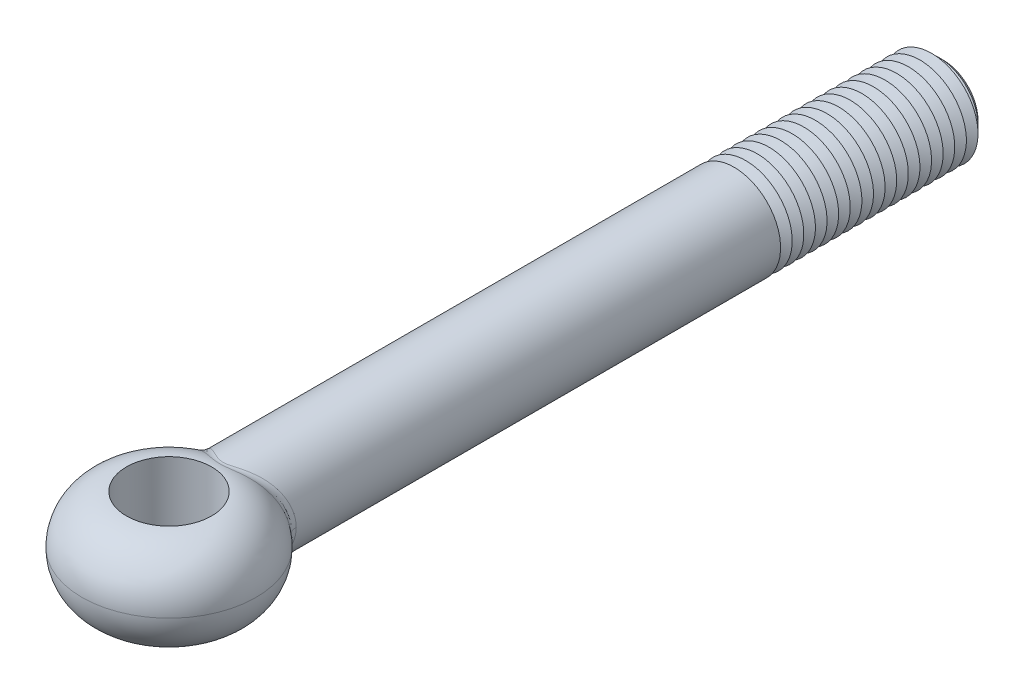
ISO-10303-21;
HEADER;
FILE_DESCRIPTION(('STEP AP214'),'2;1');
FILE_NAME('part.step','',(''),(''),'','','');
FILE_SCHEMA(('AUTOMOTIVE_DESIGN { 1 0 10303 214 1 1 1 1 }'));
ENDSEC;
DATA;
#1=APPLICATION_CONTEXT('core data for automotive mechanical design processes');
#2=APPLICATION_PROTOCOL_DEFINITION('international standard','automotive_design',2000,#1);
#3=PRODUCT_CONTEXT('',#1,'mechanical');
#4=PRODUCT('Part','Part','',(#3));
#5=PRODUCT_RELATED_PRODUCT_CATEGORY('part','',(#4));
#6=PRODUCT_DEFINITION_FORMATION('','',#4);
#7=PRODUCT_DEFINITION_CONTEXT('part definition',#1,'design');
#8=PRODUCT_DEFINITION('design','',#6,#7);
#9=PRODUCT_DEFINITION_SHAPE('','',#8);
#10=(LENGTH_UNIT() NAMED_UNIT(*) SI_UNIT(.MILLI.,.METRE.));
#11=(NAMED_UNIT(*) PLANE_ANGLE_UNIT() SI_UNIT($,.RADIAN.));
#12=(NAMED_UNIT(*) SI_UNIT($,.STERADIAN.) SOLID_ANGLE_UNIT());
#13=UNCERTAINTY_MEASURE_WITH_UNIT(LENGTH_MEASURE(1.E-05),#10,'distance_accuracy_value','');
#14=(GEOMETRIC_REPRESENTATION_CONTEXT(3) GLOBAL_UNCERTAINTY_ASSIGNED_CONTEXT((#13)) GLOBAL_UNIT_ASSIGNED_CONTEXT((#10,
#11,#12)) REPRESENTATION_CONTEXT('',''));
#15=CARTESIAN_POINT('',(0.,0.,0.));
#16=DIRECTION('',(0.,0.,1.));
#17=DIRECTION('',(1.,0.,0.));
#18=AXIS2_PLACEMENT_3D('',#15,#16,#17);
#19=CARTESIAN_POINT('',(0.,0.,-200.));
#20=DIRECTION('',(0.,0.,1.));
#21=DIRECTION('',(1.,0.,0.));
#22=AXIS2_PLACEMENT_3D('',#19,#20,#21);
#23=CYLINDRICAL_SURFACE('',#22,12.);
#24=CARTESIAN_POINT('',(0.,0.,-146.));
#25=DIRECTION('',(0.,0.,-1.));
#26=DIRECTION('',(-1.,0.,0.));
#27=AXIS2_PLACEMENT_3D('',#24,#25,#26);
#28=CIRCLE('',#27,12.);
#29=CARTESIAN_POINT('',(-12.,0.,-146.));
#30=VERTEX_POINT('',#29);
#31=EDGE_CURVE('E79',#30,#30,#28,.T.);
#32=ORIENTED_EDGE('',*,*,#31,.F.);
#33=EDGE_LOOP('',(#32));
#34=FACE_BOUND('',#33,.T.);
#35=CARTESIAN_POINT('',(11.0668506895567,-7.00530357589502,-17.0807480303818));
#36=CARTESIAN_POINT('',(10.0234990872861,-6.61021541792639,-18.0753053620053));
#37=CARTESIAN_POINT('',(9.78816741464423,-6.94202986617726,-19.5134777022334));
#38=CARTESIAN_POINT('',(11.2556958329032,-6.75368020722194,-17.1613260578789));
#39=CARTESIAN_POINT('',(10.1869276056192,-6.36184091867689,-18.1624978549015));
#40=CARTESIAN_POINT('',(9.96506204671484,-6.69267922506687,-19.6251962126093));
#41=CARTESIAN_POINT('',(11.4348613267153,-6.49403242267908,-17.2374483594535));
#42=CARTESIAN_POINT('',(10.3406855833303,-6.10798315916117,-18.2442158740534));
#43=CARTESIAN_POINT('',(10.1331767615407,-6.43537664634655,-19.7306806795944));
#44=CARTESIAN_POINT('',(11.7724527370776,-5.96016922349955,-17.3803783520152));
#45=CARTESIAN_POINT('',(10.6291362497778,-5.58941231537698,-18.3970469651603));
#46=CARTESIAN_POINT('',(10.4503638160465,-5.90633543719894,-19.9286565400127));
#47=CARTESIAN_POINT('',(11.9308725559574,-5.68594955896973,-17.447183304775));
#48=CARTESIAN_POINT('',(10.7636860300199,-5.32475984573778,-18.4680821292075));
#49=CARTESIAN_POINT('',(10.599430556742,-5.63459259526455,-20.0211441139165));
#50=CARTESIAN_POINT('',(12.225543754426,-5.12445153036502,-17.5710545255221));
#51=CARTESIAN_POINT('',(11.0129539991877,-4.78607036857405,-18.599336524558));
#52=CARTESIAN_POINT('',(10.8769937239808,-5.07816616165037,-20.1925721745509));
#53=CARTESIAN_POINT('',(12.3617854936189,-4.83716755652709,-17.6281165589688));
#54=CARTESIAN_POINT('',(11.1275308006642,-4.51212660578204,-18.659479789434));
#55=CARTESIAN_POINT('',(11.0054812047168,-4.79347701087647,-20.2715067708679));
#56=CARTESIAN_POINT('',(12.6107207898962,-4.25153049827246,-17.7321011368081));
#57=CARTESIAN_POINT('',(11.3361661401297,-3.95652222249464,-18.7687597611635));
#58=CARTESIAN_POINT('',(11.2404406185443,-4.21312957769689,-20.4153048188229));
#59=CARTESIAN_POINT('',(12.7234175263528,-3.9531789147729,-17.7790250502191));
#60=CARTESIAN_POINT('',(11.4301063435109,-3.67499018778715,-18.817833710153));
#61=CARTESIAN_POINT('',(11.346915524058,-3.9174727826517,-20.4801701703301));
#62=CARTESIAN_POINT('',(12.9208093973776,-3.35755003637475,-17.8610404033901));
#63=CARTESIAN_POINT('',(11.5941985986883,-3.1152907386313,-18.9034123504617));
#64=CARTESIAN_POINT('',(11.5335233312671,-3.32722377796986,-20.5935163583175));
#65=CARTESIAN_POINT('',(13.0063157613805,-3.06057125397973,-17.8964754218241));
#66=CARTESIAN_POINT('',(11.6649530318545,-2.83744567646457,-18.9402361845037));
#67=CARTESIAN_POINT('',(11.6144188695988,-3.03292738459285,-20.6424730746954));
#68=CARTESIAN_POINT('',(13.1535247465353,-2.46001547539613,-17.9573899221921));
#69=CARTESIAN_POINT('',(11.7865473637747,-2.27727686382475,-19.0034467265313));
#70=CARTESIAN_POINT('',(11.7537472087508,-2.43779598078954,-20.7266175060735));
#71=CARTESIAN_POINT('',(13.2152195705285,-2.15643635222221,-17.9828661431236));
#72=CARTESIAN_POINT('',(11.8373061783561,-1.99511197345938,-19.0297910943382));
#73=CARTESIAN_POINT('',(11.81217265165,-2.13695886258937,-20.7618007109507));
#74=CARTESIAN_POINT('',(13.3141154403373,-1.54515492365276,-18.0236671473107));
#75=CARTESIAN_POINT('',(11.9186021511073,-1.42805602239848,-19.0719556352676));
#76=CARTESIAN_POINT('',(11.9058504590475,-1.53119868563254,-20.8181418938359));
#77=CARTESIAN_POINT('',(13.351338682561,-1.237456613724,-18.0390011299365));
#78=CARTESIAN_POINT('',(11.9491061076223,-1.14334206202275,-19.0877585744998));
#79=CARTESIAN_POINT('',(11.9411238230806,-1.22627958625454,-20.8393125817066));
#80=CARTESIAN_POINT('',(13.4010119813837,-0.61983984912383,-18.0594576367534));
#81=CARTESIAN_POINT('',(11.989818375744,-0.572328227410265,-19.1088452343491));
#82=CARTESIAN_POINT('',(11.9881988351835,-0.614241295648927,-20.867554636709));
#83=CARTESIAN_POINT('',(13.4134617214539,-0.309921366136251,-18.0645800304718));
#84=CARTESIAN_POINT('',(12.0000000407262,-0.286212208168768,-19.1141151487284));
#85=CARTESIAN_POINT('',(12.0000001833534,-0.307122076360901,-20.8746258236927));
#86=CARTESIAN_POINT('',(13.4134613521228,0.315589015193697,-18.0645799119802));
#87=CARTESIAN_POINT('',(11.999999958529,0.291446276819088,-19.1141151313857));
#88=CARTESIAN_POINT('',(11.9999998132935,0.312738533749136,-20.8746256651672));
#89=CARTESIAN_POINT('',(13.4005517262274,0.63118101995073,-18.0592683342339));
#90=CARTESIAN_POINT('',(11.9894424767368,0.582796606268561,-19.1086507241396));
#91=CARTESIAN_POINT('',(11.9877625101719,0.625480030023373,-20.8672933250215));
#92=CARTESIAN_POINT('',(13.3490459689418,1.26003314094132,-18.0380566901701));
#93=CARTESIAN_POINT('',(11.9472266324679,1.16422234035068,-19.0867849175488));
#94=CARTESIAN_POINT('',(11.9389511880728,1.24865219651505,-20.8380086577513));
#95=CARTESIAN_POINT('',(13.3104489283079,1.57329317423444,-18.0221562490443));
#96=CARTESIAN_POINT('',(11.9155958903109,1.45410364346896,-19.0703978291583));
#97=CARTESIAN_POINT('',(11.902376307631,1.55908278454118,-20.8160558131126));
#98=CARTESIAN_POINT('',(13.2079559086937,2.19523221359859,-17.9798674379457));
#99=CARTESIAN_POINT('',(11.8313307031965,2.03114104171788,-19.0266903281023));
#100=CARTESIAN_POINT('',(11.8052934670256,2.17540431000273,-20.757659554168));
#101=CARTESIAN_POINT('',(13.1440553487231,2.50391037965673,-17.9534771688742));
#102=CARTESIAN_POINT('',(11.778747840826,2.31811265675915,-18.9993967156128));
#103=CARTESIAN_POINT('',(11.7447811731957,2.48129441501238,-20.7212135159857));
#104=CARTESIAN_POINT('',(12.9915746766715,3.11452894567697,-17.890369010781));
#105=CARTESIAN_POINT('',(11.6527601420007,2.88786980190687,-18.9338924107));
#106=CARTESIAN_POINT('',(11.6004711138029,3.08639771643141,-20.6340369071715));
#107=CARTESIAN_POINT('',(12.9029856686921,3.41646687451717,-17.8536473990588));
#108=CARTESIAN_POINT('',(11.5794275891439,3.17048606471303,-18.8957194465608));
#109=CARTESIAN_POINT('',(11.5166649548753,3.38560846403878,-20.5833011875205));
#110=CARTESIAN_POINT('',(12.7022190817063,4.01079458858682,-17.7702015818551));
#111=CARTESIAN_POINT('',(11.4124346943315,3.72932815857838,-18.8086044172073));
#112=CARTESIAN_POINT('',(11.3268856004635,3.97456805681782,-20.4679735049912));
#113=CARTESIAN_POINT('',(12.5900903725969,4.30320272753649,-17.7234980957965));
#114=CARTESIAN_POINT('',(11.3189167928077,4.00541898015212,-18.7597374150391));
#115=CARTESIAN_POINT('',(11.2209583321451,4.26433508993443,-20.4034102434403));
#116=CARTESIAN_POINT('',(12.3431556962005,4.87731134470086,-17.6203174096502));
#117=CARTESIAN_POINT('',(11.1118629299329,4.55038551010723,-18.6512584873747));
#118=CARTESIAN_POINT('',(10.9879091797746,4.83325821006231,-20.260718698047));
#119=CARTESIAN_POINT('',(12.2083417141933,5.15900799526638,-17.5638367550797));
#120=CARTESIAN_POINT('',(10.9984353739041,4.81913932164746,-18.5917040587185));
#121=CARTESIAN_POINT('',(10.8607798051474,5.11241050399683,-20.1825856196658));
#122=CARTESIAN_POINT('',(11.9173359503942,5.70976821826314,-17.4414779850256));
#123=CARTESIAN_POINT('',(10.7521869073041,5.34773597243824,-18.462013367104));
#124=CARTESIAN_POINT('',(10.5866916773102,5.65819611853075,-20.0132458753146));
#125=CARTESIAN_POINT('',(11.7611511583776,5.97883588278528,-17.375602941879));
#126=CARTESIAN_POINT('',(10.6194983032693,5.60749077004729,-18.391948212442));
#127=CARTESIAN_POINT('',(10.4397394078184,5.92483349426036,-19.9220434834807));
#128=CARTESIAN_POINT('',(11.4287046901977,6.5029302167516,-17.2348317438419));
#129=CARTESIAN_POINT('',(10.3353872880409,6.11671914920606,-18.2414005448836));
#130=CARTESIAN_POINT('',(10.1273983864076,6.44419407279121,-19.7270547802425));
#131=CARTESIAN_POINT('',(11.2524417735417,6.75795601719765,-17.1599350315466));
#132=CARTESIAN_POINT('',(10.1840940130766,6.36613220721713,-18.1609883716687));
#133=CARTESIAN_POINT('',(9.96200849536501,6.69691641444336,-19.6232676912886));
#134=CARTESIAN_POINT('',(10.8755162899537,7.26030557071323,-16.999110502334));
#135=CARTESIAN_POINT('',(9.85865758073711,6.86075287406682,-17.9873566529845));
#136=CARTESIAN_POINT('',(9.6089466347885,7.19472861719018,-19.4002901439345));
#137=CARTESIAN_POINT('',(10.6742674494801,7.50714674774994,-16.9129130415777));
#138=CARTESIAN_POINT('',(9.684069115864,7.10559423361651,-17.8938830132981));
#139=CARTESIAN_POINT('',(9.42074350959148,7.43934026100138,-19.2807224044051));
#140=CARTESIAN_POINT('',(10.2535888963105,7.98325367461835,-16.7319589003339));
#141=CARTESIAN_POINT('',(9.31692741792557,7.58129738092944,-17.6964993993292));
#142=CARTESIAN_POINT('',(9.0281736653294,7.91114686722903,-19.0295700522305));
#143=CARTESIAN_POINT('',(10.0341636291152,8.21252369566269,-16.637204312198));
#144=CARTESIAN_POINT('',(9.12451201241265,7.81216456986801,-17.5926673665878));
#145=CARTESIAN_POINT('',(8.82381089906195,8.13834606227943,-18.8979883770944));
#146=CARTESIAN_POINT('',(9.57850828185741,8.65276143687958,-16.4396502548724));
#147=CARTESIAN_POINT('',(8.72267859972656,8.25878016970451,-17.3749330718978));
#148=CARTESIAN_POINT('',(8.40050866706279,8.57460746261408,-18.623492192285));
#149=CARTESIAN_POINT('',(9.34226759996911,8.86371742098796,-16.3368457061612));
#150=CARTESIAN_POINT('',(8.51336852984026,8.4745533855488,-17.2610929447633));
#151=CARTESIAN_POINT('',(8.18156001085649,8.78365803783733,-18.4805705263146));
#152=CARTESIAN_POINT('',(8.85465264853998,9.26641239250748,-16.1239505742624));
#153=CARTESIAN_POINT('',(8.07909814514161,8.88955655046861,-17.0240228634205));
#154=CARTESIAN_POINT('',(7.73099517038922,9.18271576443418,-18.1844263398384));
#155=CARTESIAN_POINT('',(8.60328194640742,9.45815588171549,-16.013861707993));
#156=CARTESIAN_POINT('',(7.85424144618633,9.08885199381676,-16.9008538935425));
#157=CARTESIAN_POINT('',(7.49938197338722,9.37272737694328,-18.0312062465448));
#158=CARTESIAN_POINT('',(8.06370502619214,9.838189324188,-15.7770858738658));
#159=CARTESIAN_POINT('',(7.36948144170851,9.48676203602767,-16.6345956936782));
#160=CARTESIAN_POINT('',(7.00398623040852,9.74932825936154,-17.7014858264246));
#161=CARTESIAN_POINT('',(7.77421051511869,10.0246580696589,-15.6497932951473));
#162=CARTESIAN_POINT('',(7.10821519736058,9.68394461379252,-16.4906997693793));
#163=CARTESIAN_POINT('',(6.73917402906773,9.93411277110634,-17.5241266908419));
#164=CARTESIAN_POINT('',(7.18020960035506,10.3739440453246,-15.3887823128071));
#165=CARTESIAN_POINT('',(6.56993984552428,10.0563267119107,-16.1940603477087));
#166=CARTESIAN_POINT('',(6.1983598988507,10.2802439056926,-17.1602711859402));
#167=CARTESIAN_POINT('',(6.8757060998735,10.5367658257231,-15.2550651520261));
#168=CARTESIAN_POINT('',(6.29299233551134,10.2316662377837,-16.0413517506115));
#169=CARTESIAN_POINT('',(5.92236013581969,10.4415950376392,-16.9737765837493));
#170=CARTESIAN_POINT('',(6.25253303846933,10.8386647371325,-14.9829888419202));
#171=CARTESIAN_POINT('',(5.72450599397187,10.559425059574,-15.7291507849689));
#172=CARTESIAN_POINT('',(5.36070387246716,10.7407671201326,-16.5941767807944));
#173=CARTESIAN_POINT('',(5.93386874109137,10.9777505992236,-14.8446314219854));
#174=CARTESIAN_POINT('',(5.432987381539,10.7120059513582,-15.5696627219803));
#175=CARTESIAN_POINT('',(5.07505096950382,10.8785967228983,-16.4010740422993));
#176=CARTESIAN_POINT('',(5.28221556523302,11.2323272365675,-14.5658439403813));
#177=CARTESIAN_POINT('',(4.83577895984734,10.9935431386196,-15.2469866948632));
#178=CARTESIAN_POINT('',(4.49486022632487,11.1308739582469,-16.0119192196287));
#179=CARTESIAN_POINT('',(4.94923070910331,11.3478245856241,-14.4254144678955));
#180=CARTESIAN_POINT('',(4.53005970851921,11.1226685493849,-15.0837625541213));
#181=CARTESIAN_POINT('',(4.20032488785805,11.2453281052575,-15.8158679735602));
#182=CARTESIAN_POINT('',(4.418859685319,11.5092496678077,-14.2088988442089));
#183=CARTESIAN_POINT('',(4.04244425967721,11.3047506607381,-14.8310562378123));
#184=CARTESIAN_POINT('',(3.73498180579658,11.4052951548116,-15.5136345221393));
#185=CARTESIAN_POINT('',(4.22698520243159,11.5632823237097,-14.1319559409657));
#186=CARTESIAN_POINT('',(3.86615136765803,11.3659940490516,-14.7411592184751));
#187=CARTESIAN_POINT('',(3.56736640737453,11.4588397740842,-15.4062382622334));
#188=CARTESIAN_POINT('',(3.83770554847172,11.6641157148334,-13.9800981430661));
#189=CARTESIAN_POINT('',(3.50855117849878,11.4808212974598,-14.563464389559));
#190=CARTESIAN_POINT('',(3.22895536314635,11.5587624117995,-15.1943126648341));
#191=CARTESIAN_POINT('',(3.64030104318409,11.7109173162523,-13.9051830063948));
#192=CARTESIAN_POINT('',(3.32722277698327,11.5344340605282,-14.4756451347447));
#193=CARTESIAN_POINT('',(3.058160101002,11.6051412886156,-15.0897829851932));
#194=CARTESIAN_POINT('',(3.23881755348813,11.7973007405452,-13.7590320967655));
#195=CARTESIAN_POINT('',(2.9586556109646,11.6338410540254,-14.3041084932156));
#196=CARTESIAN_POINT('',(2.7126029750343,11.6907444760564,-14.8859114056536));
#197=CARTESIAN_POINT('',(3.034729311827,11.8368720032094,-13.6878018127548));
#198=CARTESIAN_POINT('',(2.7713784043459,11.6796514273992,-14.2203690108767));
#199=CARTESIAN_POINT('',(2.53783572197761,11.729958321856,-14.7865772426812));
#200=CARTESIAN_POINT('',(2.61924941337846,11.9085316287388,-13.5518208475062));
#201=CARTESIAN_POINT('',(2.39049286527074,11.7629647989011,-14.0603637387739));
#202=CARTESIAN_POINT('',(2.18396259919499,11.8009706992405,-14.5970091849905));
#203=CARTESIAN_POINT('',(2.40785949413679,11.9406217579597,-13.487068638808));
#204=CARTESIAN_POINT('',(2.19684547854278,11.8004961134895,-13.9840608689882));
#205=CARTESIAN_POINT('',(2.00485776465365,11.8327709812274,-14.5067731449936));
#206=CARTESIAN_POINT('',(1.88979300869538,12.0083312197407,-13.3438479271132));
#207=CARTESIAN_POINT('',(1.72298962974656,11.8799550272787,-13.8152500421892));
#208=CARTESIAN_POINT('',(1.56826217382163,11.8998688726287,-14.307262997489));
#209=CARTESIAN_POINT('',(1.57889083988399,12.0402078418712,-13.2702876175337));
#210=CARTESIAN_POINT('',(1.4388724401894,11.9177031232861,-13.728341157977));
#211=CARTESIAN_POINT('',(1.30813242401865,11.9314575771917,-14.2048593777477));
#212=CARTESIAN_POINT('',(1.1016812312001,12.0751548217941,-13.186477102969));
#213=CARTESIAN_POINT('',(1.00343635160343,11.9592039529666,-13.6293092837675));
#214=CARTESIAN_POINT('',(0.911154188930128,11.9660889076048,-14.08823090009));
#215=CARTESIAN_POINT('',(0.941325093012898,12.0846492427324,-13.1629946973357));
#216=CARTESIAN_POINT('',(0.857250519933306,11.9705082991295,-13.6015536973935));
#217=CARTESIAN_POINT('',(0.778128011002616,11.9754975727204,-14.0555630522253));
#218=CARTESIAN_POINT('',(0.617680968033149,12.0991842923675,-13.1266072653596));
#219=CARTESIAN_POINT('',(0.562389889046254,11.9878287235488,-13.5585487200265));
#220=CARTESIAN_POINT('',(0.510147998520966,11.9899013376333,-14.0049481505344));
#221=CARTESIAN_POINT('',(0.454393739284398,12.104226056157,-13.1136995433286));
#222=CARTESIAN_POINT('',(0.413680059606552,11.9938505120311,-13.5432855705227));
#223=CARTESIAN_POINT('',(0.375194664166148,11.994897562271,-13.986997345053));
#224=CARTESIAN_POINT('',(0.124773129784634,12.1097166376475,-13.0996281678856));
#225=CARTESIAN_POINT('',(0.113587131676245,12.0004071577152,-13.5266507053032));
#226=CARTESIAN_POINT('',(0.102974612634,12.0003385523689,-13.9674284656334));
#227=CARTESIAN_POINT('',(-0.0415739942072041,12.1101142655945,-13.0985954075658));
#228=CARTESIAN_POINT('',(-0.0378485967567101,12.0008826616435,-13.5254292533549));
#229=CARTESIAN_POINT('',(-0.0343012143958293,12.0007325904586,-13.9659924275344));
#230=CARTESIAN_POINT('',(-0.373368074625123,12.1061686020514,-13.1087272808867));
#231=CARTESIAN_POINT('',(-0.33990308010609,11.9961701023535,-13.5374072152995));
#232=CARTESIAN_POINT('',(-0.308257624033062,11.9968225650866,-13.9800824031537));
#233=CARTESIAN_POINT('',(-0.538814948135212,12.1018248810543,-13.1198930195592));
#234=CARTESIAN_POINT('',(-0.490563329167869,11.9909802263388,-13.5506112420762));
#235=CARTESIAN_POINT('',(-0.444938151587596,11.9925180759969,-13.9956099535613));
#236=CARTESIAN_POINT('',(-0.867965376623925,12.0885089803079,-13.153394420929));
#237=CARTESIAN_POINT('',(-0.790396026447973,11.9751052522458,-13.5902076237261));
#238=CARTESIAN_POINT('',(-0.717328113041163,11.979322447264,-14.0422082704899));
#239=CARTESIAN_POINT('',(-1.03165081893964,12.0795071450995,-13.1758016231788));
#240=CARTESIAN_POINT('',(-0.939590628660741,11.9643807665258,-13.6166946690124));
#241=CARTESIAN_POINT('',(-0.853025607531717,11.9704019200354,-14.0733785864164));
#242=CARTESIAN_POINT('',(-1.35507829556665,12.0571088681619,-13.2299063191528));
#243=CARTESIAN_POINT('',(-1.23455248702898,11.937774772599,-13.6806107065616));
#244=CARTESIAN_POINT('',(-1.12186617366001,11.9482059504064,-14.148663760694));
#245=CARTESIAN_POINT('',(-1.51481934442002,12.0437113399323,-13.2616061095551));
#246=CARTESIAN_POINT('',(-1.38035112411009,11.9218856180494,-13.7180567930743));
#247=CARTESIAN_POINT('',(-1.25500860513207,11.9349294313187,-14.1927818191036));
#248=CARTESIAN_POINT('',(-1.84495456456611,12.011300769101,-13.3355882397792));
#249=CARTESIAN_POINT('',(-1.68188899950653,11.8835783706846,-13.8053908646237));
#250=CARTESIAN_POINT('',(-1.53107532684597,11.9028116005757,-14.2957778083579));
#251=CARTESIAN_POINT('',(-2.01491382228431,11.9918743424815,-13.3785910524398));
#252=CARTESIAN_POINT('',(-1.83727107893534,11.8606743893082,-13.8561401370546));
#253=CARTESIAN_POINT('',(-1.67372311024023,11.8835606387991,-14.3556614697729));
#254=CARTESIAN_POINT('',(-2.34982544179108,11.9483049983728,-13.4708803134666));
#255=CARTESIAN_POINT('',(-2.14368396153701,11.8095216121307,-13.9649543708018));
#256=CARTESIAN_POINT('',(-1.95593412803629,11.8403848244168,-14.484221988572));
#257=CARTESIAN_POINT('',(-2.51477537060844,11.9241598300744,-13.520169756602));
#258=CARTESIAN_POINT('',(-2.29473884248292,11.7812588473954,-14.0230424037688));
#259=CARTESIAN_POINT('',(-2.09549585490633,11.8164577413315,-14.5529030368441));
#260=CARTESIAN_POINT('',(-2.84030915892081,11.8712884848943,-13.6232162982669));
#261=CARTESIAN_POINT('',(-2.59304039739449,11.7196429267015,-14.1443586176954));
#262=CARTESIAN_POINT('',(-2.37205348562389,11.7640639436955,-14.6965334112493));
#263=CARTESIAN_POINT('',(-3.00088551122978,11.8425549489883,-13.6769805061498));
#264=CARTESIAN_POINT('',(-2.74030070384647,11.6862694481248,-14.2076122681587));
#265=CARTESIAN_POINT('',(-2.50904486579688,11.7355899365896,-14.7714927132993));
#266=CARTESIAN_POINT('',(-3.31787265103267,11.7806424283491,-13.7874770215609));
#267=CARTESIAN_POINT('',(-3.03113701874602,11.6146813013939,-14.3374619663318));
#268=CARTESIAN_POINT('',(-2.7805695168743,11.6742366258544,-14.9255877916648));
#269=CARTESIAN_POINT('',(-3.47428412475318,11.7474641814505,-13.8442088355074));
#270=CARTESIAN_POINT('',(-3.17472979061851,11.5764547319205,-14.404072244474));
#271=CARTESIAN_POINT('',(-2.91510319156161,11.6413580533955,-15.0047228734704));
#272=CARTESIAN_POINT('',(-3.78404739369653,11.67656761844,-13.9598300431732));
#273=CARTESIAN_POINT('',(-3.45918061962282,11.4951374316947,-14.5396537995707));
#274=CARTESIAN_POINT('',(-3.18257716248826,11.5711018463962,-15.1660331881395));
#275=CARTESIAN_POINT('',(-3.93738431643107,11.6388315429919,-14.0187272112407));
#276=CARTESIAN_POINT('',(-3.60003721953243,11.4520148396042,-14.6086453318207));
#277=CARTESIAN_POINT('',(-3.31550885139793,11.5337066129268,-15.2482193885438));
#278=CARTESIAN_POINT('',(-4.24071273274,11.5589459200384,-14.1376822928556));
#279=CARTESIAN_POINT('',(-3.87868653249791,11.3611356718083,-14.7477942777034));
#280=CARTESIAN_POINT('',(-3.57944589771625,11.4545425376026,-15.4142328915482));
#281=CARTESIAN_POINT('',(-4.39070396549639,11.5167960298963,-14.1977402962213));
#282=CARTESIAN_POINT('',(-4.01648905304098,11.3133653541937,-14.8179616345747));
#283=CARTESIAN_POINT('',(-3.7104511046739,11.4127733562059,-15.4980603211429));
#284=CARTESIAN_POINT('',(-4.8357946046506,11.3838162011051,-14.3786158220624));
#285=CARTESIAN_POINT('',(-4.4257108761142,11.1631818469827,-15.0291599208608));
#286=CARTESIAN_POINT('',(-4.10054896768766,11.2809946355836,-15.750538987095));
#287=CARTESIAN_POINT('',(-5.12633926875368,11.2863806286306,-14.500260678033));
#288=CARTESIAN_POINT('',(-4.69251664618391,11.0540121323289,-15.170680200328));
#289=CARTESIAN_POINT('',(-4.35700776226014,11.1844391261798,-15.9203621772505));
#290=CARTESIAN_POINT('',(-5.71340475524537,11.0674990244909,-14.7497300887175));
#291=CARTESIAN_POINT('',(-5.23094469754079,10.811014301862,-15.4599151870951));
#292=CARTESIAN_POINT('',(-4.87826833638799,10.9675345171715,-16.2686079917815));
#293=CARTESIAN_POINT('',(-6.00925252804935,10.9449693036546,-14.8774916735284));
#294=CARTESIAN_POINT('',(-5.50187190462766,10.6760136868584,-15.6074949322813));
#295=CARTESIAN_POINT('',(-5.14265857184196,10.8461115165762,-16.446941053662));
#296=CARTESIAN_POINT('',(-6.58901820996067,10.6799255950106,-15.1296175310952));
#297=CARTESIAN_POINT('',(-6.0315628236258,10.3867756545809,-15.8975382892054));
#298=CARTESIAN_POINT('',(-5.66351510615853,10.5834617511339,-16.7987693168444));
#299=CARTESIAN_POINT('',(-6.87293369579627,10.5374075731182,-15.2539811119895));
#300=CARTESIAN_POINT('',(-6.29032294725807,10.2324127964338,-16.0400075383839));
#301=CARTESIAN_POINT('',(-5.91997979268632,10.4422309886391,-16.9722635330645));
#302=CARTESIAN_POINT('',(-7.42781601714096,10.2327138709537,-15.4975137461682));
#303=CARTESIAN_POINT('',(-6.79447470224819,9.90543645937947,-16.3177763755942));
#304=CARTESIAN_POINT('',(-6.42343369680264,10.1402893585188,-17.3118682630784));
#305=CARTESIAN_POINT('',(-7.69880705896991,10.0705771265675,-15.6166924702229));
#306=CARTESIAN_POINT('',(-7.03986086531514,9.7327471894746,-16.4530735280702));
#307=CARTESIAN_POINT('',(-6.67044044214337,9.97961707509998,-17.4779925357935));
#308=CARTESIAN_POINT('',(-8.22752602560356,9.72661338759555,-15.8490032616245));
#309=CARTESIAN_POINT('',(-7.516849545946,9.3696549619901,-16.7156042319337));
#310=CARTESIAN_POINT('',(-7.15414912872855,9.63876010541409,-17.8016554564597));
#311=CARTESIAN_POINT('',(-8.48525397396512,9.54478642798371,-15.9621353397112));
#312=CARTESIAN_POINT('',(-7.74838988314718,9.17915766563,-16.8428011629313));
#313=CARTESIAN_POINT('',(-7.39085108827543,9.45857545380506,-17.9591941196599));
#314=CARTESIAN_POINT('',(-9.04166371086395,9.11943479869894,-16.2057439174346));
#315=CARTESIAN_POINT('',(-8.24643700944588,8.73712339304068,-17.1155654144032));
#316=CARTESIAN_POINT('',(-7.90344846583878,9.03706571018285,-18.2982438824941));
#317=CARTESIAN_POINT('',(-9.33680953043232,8.87115530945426,-16.3345284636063));
#318=CARTESIAN_POINT('',(-8.5088809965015,8.48157779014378,-17.2587098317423));
#319=CARTESIAN_POINT('',(-8.17644570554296,8.79102874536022,-18.4773591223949));
#320=CARTESIAN_POINT('',(-9.90300273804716,8.34681842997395,-16.5805049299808));
#321=CARTESIAN_POINT('',(-9.00956487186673,7.94739974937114,-17.5305747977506));
#322=CARTESIAN_POINT('',(-8.7017229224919,8.27142781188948,-18.8192409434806));
#323=CARTESIAN_POINT('',(-10.1740457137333,8.07075597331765,-16.6976947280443));
#324=CARTESIAN_POINT('',(-9.24759259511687,7.66868796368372,-17.6591721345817));
#325=CARTESIAN_POINT('',(-8.95399910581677,7.99785882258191,-18.9820045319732));
#326=CARTESIAN_POINT('',(-10.6893747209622,7.49227394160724,-16.9194545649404));
#327=CARTESIAN_POINT('',(-9.69758548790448,7.09025247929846,-17.9011953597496));
#328=CARTESIAN_POINT('',(-9.43479391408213,7.4246017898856,-19.2898096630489));
#329=CARTESIAN_POINT('',(-10.9336387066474,7.18983301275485,-17.0240142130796));
#330=CARTESIAN_POINT('',(-9.90928717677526,6.79050605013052,-18.0144718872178));
#331=CARTESIAN_POINT('',(-9.66329295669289,7.1248925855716,-19.434836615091));
#332=CARTESIAN_POINT('',(-11.3922237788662,6.56101137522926,-17.219416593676));
#333=CARTESIAN_POINT('',(-10.3045410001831,6.17279493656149,-18.2250928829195));
#334=CARTESIAN_POINT('',(-10.0930881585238,6.50175062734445,-19.705708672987));
#335=CARTESIAN_POINT('',(-11.6065510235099,6.23463561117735,-17.31026214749));
#336=CARTESIAN_POINT('',(-10.4878412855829,5.85490191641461,-18.3222983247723));
#337=CARTESIAN_POINT('',(-10.2943899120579,6.1783227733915,-19.8315577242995));
#338=CARTESIAN_POINT('',(-11.9788069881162,5.60102165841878,-17.4673989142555));
#339=CARTESIAN_POINT('',(-10.8045077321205,5.24277677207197,-18.4896383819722));
#340=CARTESIAN_POINT('',(-10.6445307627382,5.55043178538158,-20.0491319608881));
#341=CARTESIAN_POINT('',(-12.1404155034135,5.29616663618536,-17.535327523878));
#342=CARTESIAN_POINT('',(-10.9411166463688,4.95021714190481,-18.5615610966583));
#343=CARTESIAN_POINT('',(-10.7967651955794,5.24833029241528,-20.1431384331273));
#344=CARTESIAN_POINT('',(-12.4365532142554,4.67222519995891,-17.6594117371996));
#345=CARTESIAN_POINT('',(-11.1904485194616,4.35503313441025,-18.6924913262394));
#346=CARTESIAN_POINT('',(-11.0760057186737,4.63002445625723,-20.3147946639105));
#347=CARTESIAN_POINT('',(-12.5710856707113,4.3531405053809,-17.7155687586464));
#348=CARTESIAN_POINT('',(-11.3030104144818,4.05255416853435,-18.7514129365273));
#349=CARTESIAN_POINT('',(-11.2030148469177,4.31382181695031,-20.3924463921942));
#350=CARTESIAN_POINT('',(-12.8113072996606,3.70386059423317,-17.8155899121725));
#351=CARTESIAN_POINT('',(-11.5033629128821,3.44010607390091,-18.8560787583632));
#352=CARTESIAN_POINT('',(-11.4299721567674,3.67040636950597,-20.5307108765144));
#353=CARTESIAN_POINT('',(-12.9170534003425,3.37368877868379,-17.8594783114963));
#354=CARTESIAN_POINT('',(-11.5910600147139,3.13033564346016,-18.9017738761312));
#355=CARTESIAN_POINT('',(-11.5299737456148,3.34321675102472,-20.591357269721));
#356=CARTESIAN_POINT('',(-13.0987625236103,2.7045032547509,-17.9347558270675));
#357=CARTESIAN_POINT('',(-11.7414276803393,2.50483422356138,-18.9800127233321));
#358=CARTESIAN_POINT('',(-11.7018998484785,2.68007548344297,-20.6953560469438));
#359=CARTESIAN_POINT('',(-13.1747386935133,2.36549352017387,-17.966150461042));
#360=CARTESIAN_POINT('',(-11.8039950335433,2.18932374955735,-19.0125025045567));
#361=CARTESIAN_POINT('',(-11.7738367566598,2.34412777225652,-20.7387160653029));
#362=CARTESIAN_POINT('',(-13.2945218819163,1.69001403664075,-18.0155922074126));
#363=CARTESIAN_POINT('',(-11.9025350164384,1.56217664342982,-19.0636291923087));
#364=CARTESIAN_POINT('',(-11.8872853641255,1.67474939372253,-20.8069927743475));
#365=CARTESIAN_POINT('',(-13.3390876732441,1.35369370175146,-18.0339542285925));
#366=CARTESIAN_POINT('',(-11.9390623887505,1.25085799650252,-19.0825551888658));
#367=CARTESIAN_POINT('',(-11.9295146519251,1.34146679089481,-20.8323446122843));
#368=CARTESIAN_POINT('',(-13.3985522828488,0.678243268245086,-18.0584460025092));
#369=CARTESIAN_POINT('',(-11.9878097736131,0.62623517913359,-19.1078059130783));
#370=CARTESIAN_POINT('',(-11.9858669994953,0.672117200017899,-20.8661581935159));
#371=CARTESIAN_POINT('',(-13.4134605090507,0.339114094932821,-18.0645796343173));
#372=CARTESIAN_POINT('',(-11.9999997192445,0.313171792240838,-19.1141150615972));
#373=CARTESIAN_POINT('',(-11.99999897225,0.336051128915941,-20.8746252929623));
#374=CARTESIAN_POINT('',(-13.4134624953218,-0.315214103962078,-18.0645802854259));
#375=CARTESIAN_POINT('',(-12.0000002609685,-0.291100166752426,-19.1141152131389));
#376=CARTESIAN_POINT('',(-12.0000009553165,-0.312367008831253,-20.8746261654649));
#377=CARTESIAN_POINT('',(-13.4005834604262,-0.630415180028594,-18.0592813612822));
#378=CARTESIAN_POINT('',(-11.989468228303,-0.582089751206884,-19.1086640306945));
#379=CARTESIAN_POINT('',(-11.987792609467,-0.624721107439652,-20.8673113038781));
#380=CARTESIAN_POINT('',(-13.3491942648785,-1.25859966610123,-18.0381178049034));
#381=CARTESIAN_POINT('',(-11.9473483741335,-1.16289640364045,-19.0868480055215));
#382=CARTESIAN_POINT('',(-11.9390917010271,-1.24723166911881,-20.8380930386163));
#383=CARTESIAN_POINT('',(-13.3106752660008,-1.57158227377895,-18.0222495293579));
#384=CARTESIAN_POINT('',(-11.9157815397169,-1.45251959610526,-19.070494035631));
#385=CARTESIAN_POINT('',(-11.9025907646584,-1.55738733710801,-20.8161846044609));
#386=CARTESIAN_POINT('',(-13.2082732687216,-2.19364255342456,-17.9799984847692));
#387=CARTESIAN_POINT('',(-11.8315919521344,-2.02966309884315,-19.0268259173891));
#388=CARTESIAN_POINT('',(-11.8055940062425,-2.17382900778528,-20.7578405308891));
#389=CARTESIAN_POINT('',(-13.1443316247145,-2.50270947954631,-17.953591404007));
#390=CARTESIAN_POINT('',(-11.7789758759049,-2.31699330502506,-18.9995151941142));
#391=CARTESIAN_POINT('',(-11.7450427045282,-2.48010436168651,-20.7213713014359));
#392=CARTESIAN_POINT('',(-12.9917331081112,-3.11398878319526,-17.8904346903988));
#393=CARTESIAN_POINT('',(-11.6528914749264,-2.88736356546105,-18.9339607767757));
#394=CARTESIAN_POINT('',(-11.6006209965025,-3.08586243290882,-20.6341276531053));
#395=CARTESIAN_POINT('',(-12.9030756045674,-3.41620098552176,-17.8536847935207));
#396=CARTESIAN_POINT('',(-11.57950265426,-3.17023510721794,-18.895758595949));
#397=CARTESIAN_POINT('',(-11.5167499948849,-3.38534497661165,-20.5833528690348));
#398=CARTESIAN_POINT('',(-12.7021040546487,-4.01113475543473,-17.77015375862));
#399=CARTESIAN_POINT('',(-11.4123391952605,-3.72964749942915,-18.8085546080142));
#400=CARTESIAN_POINT('',(-11.3267768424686,-3.97490515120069,-20.4679074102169));
#401=CARTESIAN_POINT('',(-12.5898329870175,-4.30387246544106,-17.7233908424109));
#402=CARTESIAN_POINT('',(-11.3187022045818,-4.00605158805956,-18.7596253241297));
#403=CARTESIAN_POINT('',(-11.2207150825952,-4.26499877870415,-20.4032619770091));
#404=CARTESIAN_POINT('',(-12.3425923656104,-4.87854946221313,-17.6200817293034));
#405=CARTESIAN_POINT('',(-11.1113901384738,-4.55156205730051,-18.6510104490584));
#406=CARTESIAN_POINT('',(-10.9873778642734,-4.83448514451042,-20.2603927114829));
#407=CARTESIAN_POINT('',(-12.2076200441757,-5.16048742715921,-17.5635343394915));
#408=CARTESIAN_POINT('',(-10.9978285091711,-4.82054774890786,-18.5913850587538));
#409=CARTESIAN_POINT('',(-10.8600998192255,-5.11387657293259,-20.1821672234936));
#410=CARTESIAN_POINT('',(-11.9165165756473,-5.71120494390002,-17.4411324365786));
#411=CARTESIAN_POINT('',(-10.7514900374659,-5.34912610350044,-18.4616457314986));
#412=CARTESIAN_POINT('',(-10.5859202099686,-5.65961986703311,-20.0127675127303));
#413=CARTESIAN_POINT('',(-11.7604304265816,-5.98001086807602,-17.3752977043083));
#414=CARTESIAN_POINT('',(-10.6188806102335,-5.60864484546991,-18.3916220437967));
#415=CARTESIAN_POINT('',(-10.4390603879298,-5.92599786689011,-19.9216208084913));
#416=CARTESIAN_POINT('',(-11.4282849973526,-6.50355289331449,-17.2346540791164));
#417=CARTESIAN_POINT('',(-10.335029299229,-6.1173138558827,-18.2412097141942));
#418=CARTESIAN_POINT('',(-10.1270059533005,-6.44481112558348,-19.7268085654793));
#419=CARTESIAN_POINT('',(-11.2522312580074,-6.75829286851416,-17.1598476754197));
#420=CARTESIAN_POINT('',(-10.1839224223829,-6.36640726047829,-18.1608946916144));
#421=CARTESIAN_POINT('',(-9.96181642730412,-6.6972502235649,-19.6231464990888));
#422=CARTESIAN_POINT('',(-11.0668506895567,-7.00530357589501,-17.0807480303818));
#423=CARTESIAN_POINT('',(-10.0234990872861,-6.61021541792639,-18.0753053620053));
#424=CARTESIAN_POINT('',(-9.78816741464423,-6.94202986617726,-19.5134777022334));
#425=(BOUNDED_SURFACE() B_SPLINE_SURFACE(3,2,((#35,#36,#37),(#38,#39,#40),(#41,#42,#43),(#44,
#45,#46),(#47,#48,#49),(#50,#51,#52),(#53,#54,#55),(#56,#57,#58),(#59,#60,#61),(#62,#63,#64),
(#65,#66,#67),(#68,#69,#70),(#71,#72,#73),(#74,#75,#76),(#77,#78,#79),(#80,#81,#82),(#83,#84,
#85),(#86,#87,#88),(#89,#90,#91),(#92,#93,#94),(#95,#96,#97),(#98,#99,#100),(#101,#102,#103),
(#104,#105,#106),(#107,#108,#109),(#110,#111,#112),(#113,#114,#115),(#116,#117,#118),(#119,#120,
#121),(#122,#123,#124),(#125,#126,#127),(#128,#129,#130),(#131,#132,#133),(#134,#135,#136),
(#137,#138,#139),(#140,#141,#142),(#143,#144,#145),(#146,#147,#148),(#149,#150,#151),(#152,#153,
#154),(#155,#156,#157),(#158,#159,#160),(#161,#162,#163),(#164,#165,#166),(#167,#168,#169),
(#170,#171,#172),(#173,#174,#175),(#176,#177,#178),(#179,#180,#181),(#182,#183,#184),(#185,#186,
#187),(#188,#189,#190),(#191,#192,#193),(#194,#195,#196),(#197,#198,#199),(#200,#201,#202),
(#203,#204,#205),(#206,#207,#208),(#209,#210,#211),(#212,#213,#214),(#215,#216,#217),(#218,#219,
#220),(#221,#222,#223),(#224,#225,#226),(#227,#228,#229),(#230,#231,#232),(#233,#234,#235),
(#236,#237,#238),(#239,#240,#241),(#242,#243,#244),(#245,#246,#247),(#248,#249,#250),(#251,#252,
#253),(#254,#255,#256),(#257,#258,#259),(#260,#261,#262),(#263,#264,#265),(#266,#267,#268),
(#269,#270,#271),(#272,#273,#274),(#275,#276,#277),(#278,#279,#280),(#281,#282,#283),(#284,#285,
#286),(#287,#288,#289),(#290,#291,#292),(#293,#294,#295),(#296,#297,#298),(#299,#300,#301),
(#302,#303,#304),(#305,#306,#307),(#308,#309,#310),(#311,#312,#313),(#314,#315,#316),(#317,#318,
#319),(#320,#321,#322),(#323,#324,#325),(#326,#327,#328),(#329,#330,#331),(#332,#333,#334),
(#335,#336,#337),(#338,#339,#340),(#341,#342,#343),(#344,#345,#346),(#347,#348,#349),(#350,#351,
#352),(#353,#354,#355),(#356,#357,#358),(#359,#360,#361),(#362,#363,#364),(#365,#366,#367),
(#368,#369,#370),(#371,#372,#373),(#374,#375,#376),(#377,#378,#379),(#380,#381,#382),(#383,#384,
#385),(#386,#387,#388),(#389,#390,#391),(#392,#393,#394),(#395,#396,#397),(#398,#399,#400),
(#401,#402,#403),(#404,#405,#406),(#407,#408,#409),(#410,#411,#412),(#413,#414,#415),(#416,#417,
#418),(#419,#420,#421),(#422,#423,#424)),.UNSPECIFIED.,.F.,.F.,
.F.) B_SPLINE_SURFACE_WITH_KNOTS((4,2,2,2,2,2,2,2,2,2,2,2,2,2,2,2,2,2,2,2,2,2,2,2,2,2,2,2,2,2,2,
2,2,2,2,2,2,2,2,2,2,2,2,2,2,2,2,2,2,2,2,2,2,2,2,2,2,2,2,2,2,2,2,2,4),(3,3),(0.,1.23092497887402,
2.4622109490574,3.6940307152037,4.92568403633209,6.11609806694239,7.30690157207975,
8.49662348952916,9.68636060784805,10.8978548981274,12.1093920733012,13.3211486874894,
14.5333424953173,15.7430441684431,16.9531741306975,18.1629092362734,19.3727191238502,
20.6199678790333,21.8669124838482,23.1146503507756,24.3620951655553,25.7203979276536,
27.0784389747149,28.4359793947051,29.793140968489,30.5470943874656,31.3009574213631,
32.0559128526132,32.810689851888,33.8680575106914,34.3934346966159,34.9186779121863,
35.4497052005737,35.9807805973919,36.5152794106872,37.0499104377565,37.635474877,
38.2213193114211,38.8081129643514,39.3948093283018,39.9838703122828,40.5729770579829,
41.7499391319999,42.9969316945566,44.2441762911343,45.488984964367,46.7337914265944,
48.2536843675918,49.7738549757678,51.295267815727,52.8163672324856,54.1554531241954,
55.4943776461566,56.8306347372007,58.1663010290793,59.4684801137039,60.7702460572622,
61.9802664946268,63.1907042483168,64.4039506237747,65.6172279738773,66.8283158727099,
68.0395515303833,69.2482453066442,70.4566044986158),(0.,1.),
.UNSPECIFIED.) GEOMETRIC_REPRESENTATION_ITEM() RATIONAL_B_SPLINE_SURFACE(((1.,0.919658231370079,
1.),(1.,0.917640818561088,1.),(1.,0.915701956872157,1.),(1.,0.912011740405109,1.),(1.,
0.910260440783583,1.),(1.,0.906976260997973,1.),(1.,0.905443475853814,1.),(1.,0.902624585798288,
1.),(1.,0.901338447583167,1.),(1.,0.899074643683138,1.),(1.,0.898088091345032,1.),(1.,
0.896383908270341,1.),(1.,0.895666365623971,1.),(1.,0.894513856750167,1.),(1.,0.89407863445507,
1.),(1.,0.893497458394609,1.),(1.,0.893351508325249,1.),(1.,0.893351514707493,1.),(1.,
0.893502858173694,1.),(1.,0.894105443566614,1.),(1.,0.894556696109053,1.),(1.,0.895750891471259,
1.),(1.,0.896493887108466,1.),(1.,0.898258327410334,1.),(1.,0.899279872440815,1.),(1.,
0.901580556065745,1.),(1.,0.902859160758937,1.),(1.,0.905653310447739,1.),(1.,0.907168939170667,
1.),(1.,0.91041024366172,1.),(1.,0.912135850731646,1.),(1.,0.915768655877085,1.),(1.,
0.917675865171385,1.),(1.,0.921701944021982,1.),(1.,0.923825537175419,1.),(1.,0.9281956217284,
1.),(1.,0.930442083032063,1.),(1.,0.935022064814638,1.),(1.,0.937355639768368,1.),(1.,
0.942068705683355,1.),(1.,0.944448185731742,1.),(1.,0.94942511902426,1.),(1.,0.952023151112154,
1.),(1.,0.957171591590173,1.),(1.,0.959722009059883,1.),(1.,0.964717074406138,1.),(1.,
0.967161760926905,1.),(1.,0.971882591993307,1.),(1.,0.974158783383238,1.),(1.,0.977509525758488,
1.),(1.,0.97866850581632,1.),(1.,0.980895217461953,1.),(1.,0.981962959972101,1.),(1.,
0.983989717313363,1.),(1.,0.984948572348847,1.),(1.,0.986730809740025,1.),(1.,0.987554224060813,
1.),(1.,0.989331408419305,1.),(1.,0.990205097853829,1.),(1.,0.991180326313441,1.),(1.,
0.99144919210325,1.),(1.,0.991863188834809,1.),(1.,0.992008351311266,1.),(1.,0.992166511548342,
1.),(1.,0.992178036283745,1.),(1.,0.992064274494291,1.),(1.,0.991938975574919,1.),(1.,
0.991558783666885,1.),(1.,0.991303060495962,1.),(1.,0.990675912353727,1.),(1.,0.990304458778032,
1.),(1.,0.989421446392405,1.),(1.,0.988899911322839,1.),(1.,0.987755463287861,1.),(1.,
0.987132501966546,1.),(1.,0.985799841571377,1.),(1.,0.985090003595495,1.),(1.,0.983597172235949,
1.),(1.,0.982814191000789,1.),(1.,0.981182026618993,1.),(1.,0.980332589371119,1.),(1.,
0.978578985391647,1.),(1.,0.977674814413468,1.),(1.,0.97489355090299,1.),(1.,0.972945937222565,
1.),(1.,0.968793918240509,1.),(1.,0.966581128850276,1.),(1.,0.962052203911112,1.),(1.,
0.95973604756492,1.),(1.,0.955051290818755,1.),(1.,0.952682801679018,1.),(1.,0.947931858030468,
1.),(1.,0.945549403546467,1.),(1.,0.940287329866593,1.),(1.,0.937414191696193,1.),(1.,
0.931779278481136,1.),(1.,0.929017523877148,1.),(1.,0.923672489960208,1.),(1.,0.921089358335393,
1.),(1.,0.916170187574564,1.),(1.,0.91383409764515,1.),(1.,0.909730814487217,1.),(1.,
0.907928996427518,1.),(1.,0.904601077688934,1.),(1.,0.903074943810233,1.),(1.,0.900333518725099,
1.),(1.,0.899117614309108,1.),(1.,0.897019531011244,1.),(1.,0.896137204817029,1.),(1.,
0.894742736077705,1.),(1.,0.894221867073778,1.),(1.,0.89352631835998,1.),(1.,0.893351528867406,
1.),(1.,0.893351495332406,1.),(1.,0.893502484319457,1.),(1.,0.894103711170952,1.),(1.,
0.894554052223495,1.),(1.,0.895747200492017,1.),(1.,0.896490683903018,1.),(1.,0.898256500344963,
1.),(1.,0.899278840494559,1.),(1.,0.901581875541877,1.),(1.,0.902862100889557,1.),(1.,
0.905659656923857,1.),(1.,0.907177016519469,1.),(1.,0.910419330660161,1.),(1.,0.912143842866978,
1.),(1.,0.915773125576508,1.),(1.,0.91767784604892,1.),(1.,0.919658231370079,1.))) REPRESENTATION_ITEM('') SURFACE());
#426=CARTESIAN_POINT('',(-9.78816741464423,-6.94202986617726,-19.5134777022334));
#427=CARTESIAN_POINT('',(-9.96181642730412,-6.6972502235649,-19.6231464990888));
#428=CARTESIAN_POINT('',(-10.1270059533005,-6.44481112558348,-19.7268085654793));
#429=CARTESIAN_POINT('',(-10.4390603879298,-5.92599786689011,-19.9216208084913));
#430=CARTESIAN_POINT('',(-10.5859202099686,-5.6596198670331,-20.0127675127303));
#431=CARTESIAN_POINT('',(-10.8600998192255,-5.11387657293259,-20.1821672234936));
#432=CARTESIAN_POINT('',(-10.9873778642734,-4.83448514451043,-20.2603927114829));
#433=CARTESIAN_POINT('',(-11.2207150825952,-4.26499877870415,-20.4032619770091));
#434=CARTESIAN_POINT('',(-11.3267768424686,-3.97490515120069,-20.4679074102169));
#435=CARTESIAN_POINT('',(-11.5167499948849,-3.38534497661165,-20.5833528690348));
#436=CARTESIAN_POINT('',(-11.6006209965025,-3.08586243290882,-20.6341276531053));
#437=CARTESIAN_POINT('',(-11.7450427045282,-2.48010436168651,-20.7213713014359));
#438=CARTESIAN_POINT('',(-11.8055940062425,-2.17382900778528,-20.7578405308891));
#439=CARTESIAN_POINT('',(-11.9025907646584,-1.55738733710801,-20.8161846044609));
#440=CARTESIAN_POINT('',(-11.9390917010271,-1.24723166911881,-20.8380930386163));
#441=CARTESIAN_POINT('',(-11.987792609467,-0.624721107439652,-20.8673113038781));
#442=CARTESIAN_POINT('',(-12.0000009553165,-0.312367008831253,-20.8746261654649));
#443=CARTESIAN_POINT('',(-11.99999897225,0.336051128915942,-20.8746252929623));
#444=CARTESIAN_POINT('',(-11.9858669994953,0.672117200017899,-20.8661581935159));
#445=CARTESIAN_POINT('',(-11.9295146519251,1.34146679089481,-20.8323446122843));
#446=CARTESIAN_POINT('',(-11.8872853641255,1.67474939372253,-20.8069927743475));
#447=CARTESIAN_POINT('',(-11.7738367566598,2.34412777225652,-20.7387160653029));
#448=CARTESIAN_POINT('',(-11.7018998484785,2.68007548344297,-20.6953560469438));
#449=CARTESIAN_POINT('',(-11.5299737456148,3.34321675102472,-20.591357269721));
#450=CARTESIAN_POINT('',(-11.4299721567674,3.67040636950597,-20.5307108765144));
#451=CARTESIAN_POINT('',(-11.2030148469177,4.31382181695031,-20.3924463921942));
#452=CARTESIAN_POINT('',(-11.0760057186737,4.63002445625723,-20.3147946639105));
#453=CARTESIAN_POINT('',(-10.7967651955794,5.24833029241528,-20.1431384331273));
#454=CARTESIAN_POINT('',(-10.6445307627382,5.55043178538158,-20.0491319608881));
#455=CARTESIAN_POINT('',(-10.2943899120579,6.1783227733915,-19.8315577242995));
#456=CARTESIAN_POINT('',(-10.0930881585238,6.50175062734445,-19.705708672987));
#457=CARTESIAN_POINT('',(-9.66329295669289,7.1248925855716,-19.434836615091));
#458=CARTESIAN_POINT('',(-9.43479391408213,7.4246017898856,-19.2898096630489));
#459=CARTESIAN_POINT('',(-8.95399910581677,7.99785882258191,-18.9820045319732));
#460=CARTESIAN_POINT('',(-8.7017229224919,8.27142781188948,-18.8192409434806));
#461=CARTESIAN_POINT('',(-8.17644570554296,8.79102874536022,-18.4773591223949));
#462=CARTESIAN_POINT('',(-7.90344846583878,9.03706571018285,-18.2982438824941));
#463=CARTESIAN_POINT('',(-7.39085108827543,9.45857545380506,-17.9591941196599));
#464=CARTESIAN_POINT('',(-7.15414912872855,9.63876010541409,-17.8016554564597));
#465=CARTESIAN_POINT('',(-6.67044044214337,9.97961707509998,-17.4779925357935));
#466=CARTESIAN_POINT('',(-6.42343369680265,10.1402893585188,-17.3118682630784));
#467=CARTESIAN_POINT('',(-5.91997979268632,10.4422309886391,-16.9722635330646));
#468=CARTESIAN_POINT('',(-5.66351510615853,10.5834617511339,-16.7987693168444));
#469=CARTESIAN_POINT('',(-5.14265857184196,10.8461115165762,-16.446941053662));
#470=CARTESIAN_POINT('',(-4.87826833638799,10.9675345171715,-16.2686079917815));
#471=CARTESIAN_POINT('',(-4.35700776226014,11.1844391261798,-15.9203621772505));
#472=CARTESIAN_POINT('',(-4.10054896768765,11.2809946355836,-15.750538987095));
#473=CARTESIAN_POINT('',(-3.7104511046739,11.4127733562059,-15.4980603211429));
#474=CARTESIAN_POINT('',(-3.57944589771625,11.4545425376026,-15.4142328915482));
#475=CARTESIAN_POINT('',(-3.31550885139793,11.5337066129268,-15.2482193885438));
#476=CARTESIAN_POINT('',(-3.18257716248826,11.5711018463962,-15.1660331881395));
#477=CARTESIAN_POINT('',(-2.91510319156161,11.6413580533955,-15.0047228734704));
#478=CARTESIAN_POINT('',(-2.7805695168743,11.6742366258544,-14.9255877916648));
#479=CARTESIAN_POINT('',(-2.50904486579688,11.7355899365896,-14.7714927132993));
#480=CARTESIAN_POINT('',(-2.37205348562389,11.7640639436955,-14.6965334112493));
#481=CARTESIAN_POINT('',(-2.09549585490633,11.8164577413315,-14.5529030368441));
#482=CARTESIAN_POINT('',(-1.95593412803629,11.8403848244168,-14.484221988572));
#483=CARTESIAN_POINT('',(-1.67372311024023,11.8835606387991,-14.3556614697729));
#484=CARTESIAN_POINT('',(-1.53107532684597,11.9028116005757,-14.2957778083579));
#485=CARTESIAN_POINT('',(-1.25500860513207,11.9349294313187,-14.1927818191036));
#486=CARTESIAN_POINT('',(-1.12186617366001,11.9482059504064,-14.148663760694));
#487=CARTESIAN_POINT('',(-0.853025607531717,11.9704019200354,-14.0733785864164));
#488=CARTESIAN_POINT('',(-0.717328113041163,11.979322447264,-14.0422082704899));
#489=CARTESIAN_POINT('',(-0.444938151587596,11.9925180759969,-13.9956099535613));
#490=CARTESIAN_POINT('',(-0.308257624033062,11.9968225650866,-13.9800824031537));
#491=CARTESIAN_POINT('',(-0.0343012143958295,12.0007325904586,-13.9659924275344));
#492=CARTESIAN_POINT('',(0.102974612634,12.0003385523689,-13.9674284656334));
#493=CARTESIAN_POINT('',(0.375194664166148,11.994897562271,-13.986997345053));
#494=CARTESIAN_POINT('',(0.510147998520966,11.9899013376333,-14.0049481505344));
#495=CARTESIAN_POINT('',(0.778128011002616,11.9754975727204,-14.0555630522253));
#496=CARTESIAN_POINT('',(0.911154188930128,11.9660889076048,-14.08823090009));
#497=CARTESIAN_POINT('',(1.30813242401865,11.9314575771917,-14.2048593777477));
#498=CARTESIAN_POINT('',(1.56826217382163,11.8998688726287,-14.307262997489));
#499=CARTESIAN_POINT('',(2.00485776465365,11.8327709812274,-14.5067731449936));
#500=CARTESIAN_POINT('',(2.18396259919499,11.8009706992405,-14.5970091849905));
#501=CARTESIAN_POINT('',(2.53783572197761,11.729958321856,-14.7865772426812));
#502=CARTESIAN_POINT('',(2.7126029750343,11.6907444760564,-14.8859114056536));
#503=CARTESIAN_POINT('',(3.058160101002,11.6051412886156,-15.0897829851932));
#504=CARTESIAN_POINT('',(3.22895536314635,11.5587624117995,-15.1943126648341));
#505=CARTESIAN_POINT('',(3.56736640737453,11.4588397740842,-15.4062382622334));
#506=CARTESIAN_POINT('',(3.73498180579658,11.4052951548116,-15.5136345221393));
#507=CARTESIAN_POINT('',(4.20032488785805,11.2453281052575,-15.8158679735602));
#508=CARTESIAN_POINT('',(4.49486022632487,11.1308739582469,-16.0119192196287));
#509=CARTESIAN_POINT('',(5.07505096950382,10.8785967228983,-16.4010740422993));
#510=CARTESIAN_POINT('',(5.36070387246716,10.7407671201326,-16.5941767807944));
#511=CARTESIAN_POINT('',(5.92236013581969,10.4415950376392,-16.9737765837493));
#512=CARTESIAN_POINT('',(6.1983598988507,10.2802439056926,-17.1602711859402));
#513=CARTESIAN_POINT('',(6.73917402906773,9.93411277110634,-17.5241266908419));
#514=CARTESIAN_POINT('',(7.00398623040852,9.74932825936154,-17.7014858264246));
#515=CARTESIAN_POINT('',(7.49938197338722,9.37272737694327,-18.0312062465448));
#516=CARTESIAN_POINT('',(7.73099517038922,9.18271576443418,-18.1844263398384));
#517=CARTESIAN_POINT('',(8.18156001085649,8.78365803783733,-18.4805705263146));
#518=CARTESIAN_POINT('',(8.40050866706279,8.57460746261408,-18.623492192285));
#519=CARTESIAN_POINT('',(8.82381089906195,8.13834606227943,-18.8979883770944));
#520=CARTESIAN_POINT('',(9.0281736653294,7.91114686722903,-19.0295700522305));
#521=CARTESIAN_POINT('',(9.42074350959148,7.43934026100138,-19.2807224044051));
#522=CARTESIAN_POINT('',(9.6089466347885,7.19472861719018,-19.4002901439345));
#523=CARTESIAN_POINT('',(9.96200849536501,6.69691641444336,-19.6232676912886));
#524=CARTESIAN_POINT('',(10.1273983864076,6.44419407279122,-19.7270547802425));
#525=CARTESIAN_POINT('',(10.4397394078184,5.92483349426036,-19.9220434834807));
#526=CARTESIAN_POINT('',(10.5866916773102,5.65819611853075,-20.0132458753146));
#527=CARTESIAN_POINT('',(10.8607798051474,5.11241050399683,-20.1825856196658));
#528=CARTESIAN_POINT('',(10.9879091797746,4.83325821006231,-20.260718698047));
#529=CARTESIAN_POINT('',(11.2209583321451,4.26433508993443,-20.4034102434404));
#530=CARTESIAN_POINT('',(11.3268856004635,3.97456805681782,-20.4679735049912));
#531=CARTESIAN_POINT('',(11.5166649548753,3.38560846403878,-20.5833011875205));
#532=CARTESIAN_POINT('',(11.6004711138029,3.08639771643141,-20.6340369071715));
#533=CARTESIAN_POINT('',(11.7447811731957,2.48129441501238,-20.7212135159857));
#534=CARTESIAN_POINT('',(11.8052934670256,2.17540431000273,-20.757659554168));
#535=CARTESIAN_POINT('',(11.902376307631,1.55908278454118,-20.8160558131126));
#536=CARTESIAN_POINT('',(11.9389511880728,1.24865219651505,-20.8380086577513));
#537=CARTESIAN_POINT('',(11.9877625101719,0.625480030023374,-20.8672933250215));
#538=CARTESIAN_POINT('',(11.9999998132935,0.312738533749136,-20.8746256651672));
#539=CARTESIAN_POINT('',(12.0000001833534,-0.307122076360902,-20.8746258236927));
#540=CARTESIAN_POINT('',(11.9881988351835,-0.614241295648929,-20.867554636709));
#541=CARTESIAN_POINT('',(11.9411238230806,-1.22627958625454,-20.8393125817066));
#542=CARTESIAN_POINT('',(11.9058504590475,-1.53119868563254,-20.8181418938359));
#543=CARTESIAN_POINT('',(11.81217265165,-2.13695886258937,-20.7618007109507));
#544=CARTESIAN_POINT('',(11.7537472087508,-2.43779598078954,-20.7266175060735));
#545=CARTESIAN_POINT('',(11.6144188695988,-3.03292738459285,-20.6424730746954));
#546=CARTESIAN_POINT('',(11.5335233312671,-3.32722377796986,-20.5935163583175));
#547=CARTESIAN_POINT('',(11.346915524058,-3.91747278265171,-20.4801701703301));
#548=CARTESIAN_POINT('',(11.2404406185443,-4.21312957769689,-20.4153048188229));
#549=CARTESIAN_POINT('',(11.0054812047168,-4.79347701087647,-20.2715067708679));
#550=CARTESIAN_POINT('',(10.8769937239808,-5.07816616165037,-20.1925721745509));
#551=CARTESIAN_POINT('',(10.599430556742,-5.63459259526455,-20.0211441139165));
#552=CARTESIAN_POINT('',(10.4503638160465,-5.90633543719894,-19.9286565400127));
#553=CARTESIAN_POINT('',(10.1331767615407,-6.43537664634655,-19.7306806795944));
#554=CARTESIAN_POINT('',(9.96506204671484,-6.69267922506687,-19.6251962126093));
#555=CARTESIAN_POINT('',(9.78816741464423,-6.94202986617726,-19.5134777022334));
#556=B_SPLINE_CURVE_WITH_KNOTS('',3,(#426,#427,#428,#429,#430,#431,#432,#433,#434,#435,#436,
#437,#438,#439,#440,#441,#442,#443,#444,#445,#446,#447,#448,#449,#450,#451,#452,#453,#454,#455,
#456,#457,#458,#459,#460,#461,#462,#463,#464,#465,#466,#467,#468,#469,#470,#471,#472,#473,#474,
#475,#476,#477,#478,#479,#480,#481,#482,#483,#484,#485,#486,#487,#488,#489,#490,#491,#492,#493,
#494,#495,#496,#497,#498,#499,#500,#501,#502,#503,#504,#505,#506,#507,#508,#509,#510,#511,#512,
#513,#514,#515,#516,#517,#518,#519,#520,#521,#522,#523,#524,#525,#526,#527,#528,#529,#530,#531,
#532,#533,#534,#535,#536,#537,#538,#539,#540,#541,#542,#543,#544,#545,#546,#547,#548,#549,#550,
#551,#552,#553,#554,#555),.UNSPECIFIED.,.F.,.F.,(4,2,2,2,2,2,2,2,2,2,2,2,2,2,2,2,2,2,2,2,2,2,2,
2,2,2,2,2,2,2,2,2,2,2,2,2,2,2,2,2,2,2,2,2,2,2,2,2,2,2,2,2,2,2,2,2,2,2,2,2,2,2,2,2,4),(0.,
1.20835919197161,2.41705296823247,3.62828862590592,4.83937652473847,6.05265387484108,
7.265900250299,8.47633800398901,9.68635844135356,10.9881243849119,12.2903034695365,
13.6259697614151,14.9622268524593,16.3011513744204,17.6402372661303,19.1613366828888,
20.682749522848,22.202920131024,23.7228130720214,24.9676195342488,26.2124282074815,
27.4596728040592,28.7066653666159,29.8836274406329,30.472734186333,31.061795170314,
31.6484915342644,32.2352851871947,32.8211296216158,33.4066940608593,33.9413250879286,
34.4758239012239,35.0068992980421,35.5379265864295,36.0631698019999,36.5885469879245,
37.6459146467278,38.4006916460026,39.1556470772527,39.9095101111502,40.6634635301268,
42.0206251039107,43.3781655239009,44.7362065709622,46.0945093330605,47.3419541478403,
48.5896920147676,49.8366366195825,51.0838853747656,52.2936952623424,53.5034303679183,
54.7135603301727,55.9232620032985,57.1354558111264,58.3472124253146,59.5587496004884,
60.7702438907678,61.9599810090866,63.1497029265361,64.3405064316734,65.5309204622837,
66.7625737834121,67.9943935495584,69.2256795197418,70.4566044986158),.UNSPECIFIED.);
#557=CARTESIAN_POINT('',(-12.,0.,-20.8746257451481));
#558=VERTEX_POINT('',#557);
#559=CARTESIAN_POINT('',(12.,0.,-20.8746257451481));
#560=VERTEX_POINT('',#559);
#561=EDGE_CURVE('E81',#558,#560,#556,.T.);
#562=ORIENTED_EDGE('',*,*,#561,.T.);
#563=CARTESIAN_POINT('',(-11.0668506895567,7.00530357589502,-17.0807480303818));
#564=CARTESIAN_POINT('',(-10.0234990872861,6.61021541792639,-18.0753053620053));
#565=CARTESIAN_POINT('',(-9.78816741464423,6.94202986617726,-19.5134777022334));
#566=CARTESIAN_POINT('',(-11.2556958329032,6.75368020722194,-17.1613260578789));
#567=CARTESIAN_POINT('',(-10.1869276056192,6.36184091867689,-18.1624978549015));
#568=CARTESIAN_POINT('',(-9.96506204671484,6.69267922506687,-19.6251962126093));
#569=CARTESIAN_POINT('',(-11.4348613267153,6.49403242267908,-17.2374483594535));
#570=CARTESIAN_POINT('',(-10.3406855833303,6.10798315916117,-18.2442158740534));
#571=CARTESIAN_POINT('',(-10.1331767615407,6.43537664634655,-19.7306806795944));
#572=CARTESIAN_POINT('',(-11.7724527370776,5.96016922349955,-17.3803783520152));
#573=CARTESIAN_POINT('',(-10.6291362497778,5.58941231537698,-18.3970469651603));
#574=CARTESIAN_POINT('',(-10.4503638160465,5.90633543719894,-19.9286565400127));
#575=CARTESIAN_POINT('',(-11.9308725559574,5.68594955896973,-17.447183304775));
#576=CARTESIAN_POINT('',(-10.7636860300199,5.32475984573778,-18.4680821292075));
#577=CARTESIAN_POINT('',(-10.599430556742,5.63459259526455,-20.0211441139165));
#578=CARTESIAN_POINT('',(-12.225543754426,5.12445153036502,-17.5710545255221));
#579=CARTESIAN_POINT('',(-11.0129539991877,4.78607036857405,-18.599336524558));
#580=CARTESIAN_POINT('',(-10.8769937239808,5.07816616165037,-20.1925721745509));
#581=CARTESIAN_POINT('',(-12.3617854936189,4.83716755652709,-17.6281165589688));
#582=CARTESIAN_POINT('',(-11.1275308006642,4.51212660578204,-18.659479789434));
#583=CARTESIAN_POINT('',(-11.0054812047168,4.79347701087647,-20.2715067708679));
#584=CARTESIAN_POINT('',(-12.6107207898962,4.25153049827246,-17.7321011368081));
#585=CARTESIAN_POINT('',(-11.3361661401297,3.95652222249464,-18.7687597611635));
#586=CARTESIAN_POINT('',(-11.2404406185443,4.21312957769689,-20.4153048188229));
#587=CARTESIAN_POINT('',(-12.7234175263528,3.9531789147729,-17.7790250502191));
#588=CARTESIAN_POINT('',(-11.4301063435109,3.67499018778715,-18.817833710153));
#589=CARTESIAN_POINT('',(-11.346915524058,3.9174727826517,-20.4801701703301));
#590=CARTESIAN_POINT('',(-12.9208093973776,3.35755003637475,-17.8610404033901));
#591=CARTESIAN_POINT('',(-11.5941985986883,3.1152907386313,-18.9034123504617));
#592=CARTESIAN_POINT('',(-11.5335233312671,3.32722377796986,-20.5935163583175));
#593=CARTESIAN_POINT('',(-13.0063157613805,3.06057125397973,-17.8964754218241));
#594=CARTESIAN_POINT('',(-11.6649530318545,2.83744567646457,-18.9402361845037));
#595=CARTESIAN_POINT('',(-11.6144188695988,3.03292738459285,-20.6424730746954));
#596=CARTESIAN_POINT('',(-13.1535247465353,2.46001547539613,-17.9573899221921));
#597=CARTESIAN_POINT('',(-11.7865473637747,2.27727686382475,-19.0034467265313));
#598=CARTESIAN_POINT('',(-11.7537472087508,2.43779598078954,-20.7266175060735));
#599=CARTESIAN_POINT('',(-13.2152195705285,2.15643635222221,-17.9828661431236));
#600=CARTESIAN_POINT('',(-11.8373061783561,1.99511197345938,-19.0297910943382));
#601=CARTESIAN_POINT('',(-11.81217265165,2.13695886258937,-20.7618007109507));
#602=CARTESIAN_POINT('',(-13.3141154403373,1.54515492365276,-18.0236671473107));
#603=CARTESIAN_POINT('',(-11.9186021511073,1.42805602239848,-19.0719556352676));
#604=CARTESIAN_POINT('',(-11.9058504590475,1.53119868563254,-20.8181418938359));
#605=CARTESIAN_POINT('',(-13.351338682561,1.237456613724,-18.0390011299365));
#606=CARTESIAN_POINT('',(-11.9491061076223,1.14334206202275,-19.0877585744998));
#607=CARTESIAN_POINT('',(-11.9411238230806,1.22627958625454,-20.8393125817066));
#608=CARTESIAN_POINT('',(-13.4010119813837,0.61983984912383,-18.0594576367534));
#609=CARTESIAN_POINT('',(-11.989818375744,0.572328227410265,-19.1088452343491));
#610=CARTESIAN_POINT('',(-11.9881988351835,0.614241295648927,-20.867554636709));
#611=CARTESIAN_POINT('',(-13.4134617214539,0.309921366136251,-18.0645800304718));
#612=CARTESIAN_POINT('',(-12.0000000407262,0.286212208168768,-19.1141151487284));
#613=CARTESIAN_POINT('',(-12.0000001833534,0.307122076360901,-20.8746258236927));
#614=CARTESIAN_POINT('',(-13.4134613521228,-0.315589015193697,-18.0645799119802));
#615=CARTESIAN_POINT('',(-11.999999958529,-0.291446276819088,-19.1141151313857));
#616=CARTESIAN_POINT('',(-11.9999998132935,-0.312738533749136,-20.8746256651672));
#617=CARTESIAN_POINT('',(-13.4005517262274,-0.63118101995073,-18.0592683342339));
#618=CARTESIAN_POINT('',(-11.9894424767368,-0.582796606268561,-19.1086507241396));
#619=CARTESIAN_POINT('',(-11.9877625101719,-0.625480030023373,-20.8672933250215));
#620=CARTESIAN_POINT('',(-13.3490459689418,-1.26003314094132,-18.0380566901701));
#621=CARTESIAN_POINT('',(-11.9472266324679,-1.16422234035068,-19.0867849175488));
#622=CARTESIAN_POINT('',(-11.9389511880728,-1.24865219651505,-20.8380086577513));
#623=CARTESIAN_POINT('',(-13.3104489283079,-1.57329317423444,-18.0221562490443));
#624=CARTESIAN_POINT('',(-11.9155958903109,-1.45410364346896,-19.0703978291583));
#625=CARTESIAN_POINT('',(-11.902376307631,-1.55908278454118,-20.8160558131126));
#626=CARTESIAN_POINT('',(-13.2079559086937,-2.19523221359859,-17.9798674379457));
#627=CARTESIAN_POINT('',(-11.8313307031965,-2.03114104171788,-19.0266903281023));
#628=CARTESIAN_POINT('',(-11.8052934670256,-2.17540431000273,-20.757659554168));
#629=CARTESIAN_POINT('',(-13.1440553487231,-2.50391037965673,-17.9534771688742));
#630=CARTESIAN_POINT('',(-11.778747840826,-2.31811265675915,-18.9993967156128));
#631=CARTESIAN_POINT('',(-11.7447811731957,-2.48129441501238,-20.7212135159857));
#632=CARTESIAN_POINT('',(-12.9915746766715,-3.11452894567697,-17.890369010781));
#633=CARTESIAN_POINT('',(-11.6527601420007,-2.88786980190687,-18.9338924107));
#634=CARTESIAN_POINT('',(-11.6004711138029,-3.08639771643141,-20.6340369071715));
#635=CARTESIAN_POINT('',(-12.9029856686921,-3.41646687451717,-17.8536473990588));
#636=CARTESIAN_POINT('',(-11.5794275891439,-3.17048606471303,-18.8957194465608));
#637=CARTESIAN_POINT('',(-11.5166649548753,-3.38560846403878,-20.5833011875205));
#638=CARTESIAN_POINT('',(-12.7022190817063,-4.01079458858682,-17.7702015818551));
#639=CARTESIAN_POINT('',(-11.4124346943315,-3.72932815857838,-18.8086044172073));
#640=CARTESIAN_POINT('',(-11.3268856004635,-3.97456805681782,-20.4679735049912));
#641=CARTESIAN_POINT('',(-12.5900903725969,-4.30320272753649,-17.7234980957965));
#642=CARTESIAN_POINT('',(-11.3189167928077,-4.00541898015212,-18.7597374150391));
#643=CARTESIAN_POINT('',(-11.2209583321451,-4.26433508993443,-20.4034102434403));
#644=CARTESIAN_POINT('',(-12.3431556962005,-4.87731134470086,-17.6203174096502));
#645=CARTESIAN_POINT('',(-11.1118629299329,-4.55038551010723,-18.6512584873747));
#646=CARTESIAN_POINT('',(-10.9879091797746,-4.83325821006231,-20.260718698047));
#647=CARTESIAN_POINT('',(-12.2083417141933,-5.15900799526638,-17.5638367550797));
#648=CARTESIAN_POINT('',(-10.9984353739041,-4.81913932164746,-18.5917040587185));
#649=CARTESIAN_POINT('',(-10.8607798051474,-5.11241050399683,-20.1825856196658));
#650=CARTESIAN_POINT('',(-11.9173359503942,-5.70976821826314,-17.4414779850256));
#651=CARTESIAN_POINT('',(-10.7521869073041,-5.34773597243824,-18.462013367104));
#652=CARTESIAN_POINT('',(-10.5866916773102,-5.65819611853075,-20.0132458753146));
#653=CARTESIAN_POINT('',(-11.7611511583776,-5.97883588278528,-17.375602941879));
#654=CARTESIAN_POINT('',(-10.6194983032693,-5.60749077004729,-18.391948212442));
#655=CARTESIAN_POINT('',(-10.4397394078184,-5.92483349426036,-19.9220434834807));
#656=CARTESIAN_POINT('',(-11.4287046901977,-6.5029302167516,-17.2348317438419));
#657=CARTESIAN_POINT('',(-10.3353872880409,-6.11671914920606,-18.2414005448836));
#658=CARTESIAN_POINT('',(-10.1273983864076,-6.44419407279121,-19.7270547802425));
#659=CARTESIAN_POINT('',(-11.2524417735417,-6.75795601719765,-17.1599350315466));
#660=CARTESIAN_POINT('',(-10.1840940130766,-6.36613220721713,-18.1609883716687));
#661=CARTESIAN_POINT('',(-9.96200849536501,-6.69691641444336,-19.6232676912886));
#662=CARTESIAN_POINT('',(-10.8755162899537,-7.26030557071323,-16.999110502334));
#663=CARTESIAN_POINT('',(-9.85865758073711,-6.86075287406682,-17.9873566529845));
#664=CARTESIAN_POINT('',(-9.6089466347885,-7.19472861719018,-19.4002901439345));
#665=CARTESIAN_POINT('',(-10.6742674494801,-7.50714674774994,-16.9129130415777));
#666=CARTESIAN_POINT('',(-9.684069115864,-7.10559423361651,-17.8938830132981));
#667=CARTESIAN_POINT('',(-9.42074350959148,-7.43934026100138,-19.2807224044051));
#668=CARTESIAN_POINT('',(-10.2535888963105,-7.98325367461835,-16.7319589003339));
#669=CARTESIAN_POINT('',(-9.31692741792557,-7.58129738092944,-17.6964993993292));
#670=CARTESIAN_POINT('',(-9.0281736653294,-7.91114686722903,-19.0295700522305));
#671=CARTESIAN_POINT('',(-10.0341636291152,-8.21252369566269,-16.637204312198));
#672=CARTESIAN_POINT('',(-9.12451201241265,-7.81216456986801,-17.5926673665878));
#673=CARTESIAN_POINT('',(-8.82381089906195,-8.13834606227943,-18.8979883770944));
#674=CARTESIAN_POINT('',(-9.57850828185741,-8.65276143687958,-16.4396502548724));
#675=CARTESIAN_POINT('',(-8.72267859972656,-8.25878016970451,-17.3749330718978));
#676=CARTESIAN_POINT('',(-8.40050866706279,-8.57460746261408,-18.623492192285));
#677=CARTESIAN_POINT('',(-9.34226759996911,-8.86371742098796,-16.3368457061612));
#678=CARTESIAN_POINT('',(-8.51336852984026,-8.4745533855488,-17.2610929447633));
#679=CARTESIAN_POINT('',(-8.18156001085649,-8.78365803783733,-18.4805705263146));
#680=CARTESIAN_POINT('',(-8.85465264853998,-9.26641239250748,-16.1239505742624));
#681=CARTESIAN_POINT('',(-8.07909814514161,-8.88955655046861,-17.0240228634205));
#682=CARTESIAN_POINT('',(-7.73099517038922,-9.18271576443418,-18.1844263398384));
#683=CARTESIAN_POINT('',(-8.60328194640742,-9.45815588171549,-16.013861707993));
#684=CARTESIAN_POINT('',(-7.85424144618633,-9.08885199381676,-16.9008538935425));
#685=CARTESIAN_POINT('',(-7.49938197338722,-9.37272737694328,-18.0312062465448));
#686=CARTESIAN_POINT('',(-8.06370502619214,-9.838189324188,-15.7770858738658));
#687=CARTESIAN_POINT('',(-7.36948144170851,-9.48676203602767,-16.6345956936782));
#688=CARTESIAN_POINT('',(-7.00398623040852,-9.74932825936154,-17.7014858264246));
#689=CARTESIAN_POINT('',(-7.77421051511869,-10.0246580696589,-15.6497932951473));
#690=CARTESIAN_POINT('',(-7.10821519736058,-9.68394461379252,-16.4906997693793));
#691=CARTESIAN_POINT('',(-6.73917402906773,-9.93411277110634,-17.5241266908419));
#692=CARTESIAN_POINT('',(-7.18020960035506,-10.3739440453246,-15.3887823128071));
#693=CARTESIAN_POINT('',(-6.56993984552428,-10.0563267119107,-16.1940603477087));
#694=CARTESIAN_POINT('',(-6.1983598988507,-10.2802439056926,-17.1602711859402));
#695=CARTESIAN_POINT('',(-6.8757060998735,-10.5367658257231,-15.2550651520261));
#696=CARTESIAN_POINT('',(-6.29299233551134,-10.2316662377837,-16.0413517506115));
#697=CARTESIAN_POINT('',(-5.92236013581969,-10.4415950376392,-16.9737765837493));
#698=CARTESIAN_POINT('',(-6.25253303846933,-10.8386647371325,-14.9829888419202));
#699=CARTESIAN_POINT('',(-5.72450599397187,-10.559425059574,-15.7291507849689));
#700=CARTESIAN_POINT('',(-5.36070387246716,-10.7407671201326,-16.5941767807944));
#701=CARTESIAN_POINT('',(-5.93386874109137,-10.9777505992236,-14.8446314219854));
#702=CARTESIAN_POINT('',(-5.432987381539,-10.7120059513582,-15.5696627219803));
#703=CARTESIAN_POINT('',(-5.07505096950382,-10.8785967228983,-16.4010740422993));
#704=CARTESIAN_POINT('',(-5.28221556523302,-11.2323272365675,-14.5658439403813));
#705=CARTESIAN_POINT('',(-4.83577895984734,-10.9935431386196,-15.2469866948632));
#706=CARTESIAN_POINT('',(-4.49486022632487,-11.1308739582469,-16.0119192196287));
#707=CARTESIAN_POINT('',(-4.94923070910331,-11.3478245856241,-14.4254144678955));
#708=CARTESIAN_POINT('',(-4.53005970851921,-11.1226685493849,-15.0837625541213));
#709=CARTESIAN_POINT('',(-4.20032488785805,-11.2453281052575,-15.8158679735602));
#710=CARTESIAN_POINT('',(-4.418859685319,-11.5092496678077,-14.2088988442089));
#711=CARTESIAN_POINT('',(-4.04244425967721,-11.3047506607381,-14.8310562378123));
#712=CARTESIAN_POINT('',(-3.73498180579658,-11.4052951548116,-15.5136345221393));
#713=CARTESIAN_POINT('',(-4.22698520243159,-11.5632823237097,-14.1319559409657));
#714=CARTESIAN_POINT('',(-3.86615136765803,-11.3659940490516,-14.7411592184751));
#715=CARTESIAN_POINT('',(-3.56736640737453,-11.4588397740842,-15.4062382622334));
#716=CARTESIAN_POINT('',(-3.83770554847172,-11.6641157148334,-13.9800981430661));
#717=CARTESIAN_POINT('',(-3.50855117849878,-11.4808212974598,-14.563464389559));
#718=CARTESIAN_POINT('',(-3.22895536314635,-11.5587624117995,-15.1943126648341));
#719=CARTESIAN_POINT('',(-3.64030104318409,-11.7109173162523,-13.9051830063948));
#720=CARTESIAN_POINT('',(-3.32722277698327,-11.5344340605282,-14.4756451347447));
#721=CARTESIAN_POINT('',(-3.058160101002,-11.6051412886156,-15.0897829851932));
#722=CARTESIAN_POINT('',(-3.23881755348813,-11.7973007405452,-13.7590320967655));
#723=CARTESIAN_POINT('',(-2.9586556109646,-11.6338410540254,-14.3041084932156));
#724=CARTESIAN_POINT('',(-2.7126029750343,-11.6907444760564,-14.8859114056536));
#725=CARTESIAN_POINT('',(-3.034729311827,-11.8368720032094,-13.6878018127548));
#726=CARTESIAN_POINT('',(-2.7713784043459,-11.6796514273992,-14.2203690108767));
#727=CARTESIAN_POINT('',(-2.53783572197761,-11.729958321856,-14.7865772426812));
#728=CARTESIAN_POINT('',(-2.61924941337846,-11.9085316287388,-13.5518208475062));
#729=CARTESIAN_POINT('',(-2.39049286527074,-11.7629647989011,-14.0603637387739));
#730=CARTESIAN_POINT('',(-2.18396259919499,-11.8009706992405,-14.5970091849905));
#731=CARTESIAN_POINT('',(-2.40785949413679,-11.9406217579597,-13.487068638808));
#732=CARTESIAN_POINT('',(-2.19684547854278,-11.8004961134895,-13.9840608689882));
#733=CARTESIAN_POINT('',(-2.00485776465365,-11.8327709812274,-14.5067731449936));
#734=CARTESIAN_POINT('',(-1.88979300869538,-12.0083312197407,-13.3438479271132));
#735=CARTESIAN_POINT('',(-1.72298962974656,-11.8799550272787,-13.8152500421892));
#736=CARTESIAN_POINT('',(-1.56826217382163,-11.8998688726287,-14.307262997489));
#737=CARTESIAN_POINT('',(-1.57889083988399,-12.0402078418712,-13.2702876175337));
#738=CARTESIAN_POINT('',(-1.4388724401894,-11.9177031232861,-13.728341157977));
#739=CARTESIAN_POINT('',(-1.30813242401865,-11.9314575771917,-14.2048593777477));
#740=CARTESIAN_POINT('',(-1.1016812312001,-12.0751548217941,-13.186477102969));
#741=CARTESIAN_POINT('',(-1.00343635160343,-11.9592039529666,-13.6293092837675));
#742=CARTESIAN_POINT('',(-0.911154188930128,-11.9660889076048,-14.08823090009));
#743=CARTESIAN_POINT('',(-0.941325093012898,-12.0846492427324,-13.1629946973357));
#744=CARTESIAN_POINT('',(-0.857250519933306,-11.9705082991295,-13.6015536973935));
#745=CARTESIAN_POINT('',(-0.778128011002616,-11.9754975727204,-14.0555630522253));
#746=CARTESIAN_POINT('',(-0.617680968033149,-12.0991842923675,-13.1266072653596));
#747=CARTESIAN_POINT('',(-0.562389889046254,-11.9878287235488,-13.5585487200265));
#748=CARTESIAN_POINT('',(-0.510147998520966,-11.9899013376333,-14.0049481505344));
#749=CARTESIAN_POINT('',(-0.454393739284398,-12.104226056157,-13.1136995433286));
#750=CARTESIAN_POINT('',(-0.413680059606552,-11.9938505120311,-13.5432855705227));
#751=CARTESIAN_POINT('',(-0.375194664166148,-11.994897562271,-13.986997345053));
#752=CARTESIAN_POINT('',(-0.124773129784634,-12.1097166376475,-13.0996281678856));
#753=CARTESIAN_POINT('',(-0.113587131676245,-12.0004071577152,-13.5266507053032));
#754=CARTESIAN_POINT('',(-0.102974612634,-12.0003385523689,-13.9674284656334));
#755=CARTESIAN_POINT('',(0.0415739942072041,-12.1101142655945,-13.0985954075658));
#756=CARTESIAN_POINT('',(0.0378485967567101,-12.0008826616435,-13.5254292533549));
#757=CARTESIAN_POINT('',(0.0343012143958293,-12.0007325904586,-13.9659924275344));
#758=CARTESIAN_POINT('',(0.373368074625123,-12.1061686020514,-13.1087272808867));
#759=CARTESIAN_POINT('',(0.33990308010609,-11.9961701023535,-13.5374072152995));
#760=CARTESIAN_POINT('',(0.308257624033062,-11.9968225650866,-13.9800824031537));
#761=CARTESIAN_POINT('',(0.538814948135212,-12.1018248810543,-13.1198930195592));
#762=CARTESIAN_POINT('',(0.490563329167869,-11.9909802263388,-13.5506112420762));
#763=CARTESIAN_POINT('',(0.444938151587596,-11.9925180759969,-13.9956099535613));
#764=CARTESIAN_POINT('',(0.867965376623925,-12.0885089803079,-13.153394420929));
#765=CARTESIAN_POINT('',(0.790396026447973,-11.9751052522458,-13.5902076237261));
#766=CARTESIAN_POINT('',(0.717328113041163,-11.979322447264,-14.0422082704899));
#767=CARTESIAN_POINT('',(1.03165081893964,-12.0795071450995,-13.1758016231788));
#768=CARTESIAN_POINT('',(0.939590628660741,-11.9643807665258,-13.6166946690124));
#769=CARTESIAN_POINT('',(0.853025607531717,-11.9704019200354,-14.0733785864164));
#770=CARTESIAN_POINT('',(1.35507829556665,-12.0571088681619,-13.2299063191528));
#771=CARTESIAN_POINT('',(1.23455248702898,-11.937774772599,-13.6806107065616));
#772=CARTESIAN_POINT('',(1.12186617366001,-11.9482059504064,-14.148663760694));
#773=CARTESIAN_POINT('',(1.51481934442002,-12.0437113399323,-13.2616061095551));
#774=CARTESIAN_POINT('',(1.38035112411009,-11.9218856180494,-13.7180567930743));
#775=CARTESIAN_POINT('',(1.25500860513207,-11.9349294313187,-14.1927818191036));
#776=CARTESIAN_POINT('',(1.84495456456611,-12.011300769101,-13.3355882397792));
#777=CARTESIAN_POINT('',(1.68188899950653,-11.8835783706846,-13.8053908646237));
#778=CARTESIAN_POINT('',(1.53107532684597,-11.9028116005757,-14.2957778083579));
#779=CARTESIAN_POINT('',(2.01491382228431,-11.9918743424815,-13.3785910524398));
#780=CARTESIAN_POINT('',(1.83727107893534,-11.8606743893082,-13.8561401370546));
#781=CARTESIAN_POINT('',(1.67372311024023,-11.8835606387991,-14.3556614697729));
#782=CARTESIAN_POINT('',(2.34982544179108,-11.9483049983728,-13.4708803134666));
#783=CARTESIAN_POINT('',(2.14368396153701,-11.8095216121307,-13.9649543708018));
#784=CARTESIAN_POINT('',(1.95593412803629,-11.8403848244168,-14.484221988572));
#785=CARTESIAN_POINT('',(2.51477537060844,-11.9241598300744,-13.520169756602));
#786=CARTESIAN_POINT('',(2.29473884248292,-11.7812588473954,-14.0230424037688));
#787=CARTESIAN_POINT('',(2.09549585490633,-11.8164577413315,-14.5529030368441));
#788=CARTESIAN_POINT('',(2.84030915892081,-11.8712884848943,-13.6232162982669));
#789=CARTESIAN_POINT('',(2.59304039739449,-11.7196429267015,-14.1443586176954));
#790=CARTESIAN_POINT('',(2.37205348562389,-11.7640639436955,-14.6965334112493));
#791=CARTESIAN_POINT('',(3.00088551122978,-11.8425549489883,-13.6769805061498));
#792=CARTESIAN_POINT('',(2.74030070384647,-11.6862694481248,-14.2076122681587));
#793=CARTESIAN_POINT('',(2.50904486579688,-11.7355899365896,-14.7714927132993));
#794=CARTESIAN_POINT('',(3.31787265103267,-11.7806424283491,-13.7874770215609));
#795=CARTESIAN_POINT('',(3.03113701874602,-11.6146813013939,-14.3374619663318));
#796=CARTESIAN_POINT('',(2.7805695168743,-11.6742366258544,-14.9255877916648));
#797=CARTESIAN_POINT('',(3.47428412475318,-11.7474641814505,-13.8442088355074));
#798=CARTESIAN_POINT('',(3.17472979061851,-11.5764547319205,-14.404072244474));
#799=CARTESIAN_POINT('',(2.91510319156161,-11.6413580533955,-15.0047228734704));
#800=CARTESIAN_POINT('',(3.78404739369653,-11.67656761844,-13.9598300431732));
#801=CARTESIAN_POINT('',(3.45918061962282,-11.4951374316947,-14.5396537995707));
#802=CARTESIAN_POINT('',(3.18257716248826,-11.5711018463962,-15.1660331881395));
#803=CARTESIAN_POINT('',(3.93738431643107,-11.6388315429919,-14.0187272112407));
#804=CARTESIAN_POINT('',(3.60003721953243,-11.4520148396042,-14.6086453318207));
#805=CARTESIAN_POINT('',(3.31550885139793,-11.5337066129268,-15.2482193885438));
#806=CARTESIAN_POINT('',(4.24071273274,-11.5589459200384,-14.1376822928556));
#807=CARTESIAN_POINT('',(3.87868653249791,-11.3611356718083,-14.7477942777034));
#808=CARTESIAN_POINT('',(3.57944589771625,-11.4545425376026,-15.4142328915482));
#809=CARTESIAN_POINT('',(4.39070396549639,-11.5167960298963,-14.1977402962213));
#810=CARTESIAN_POINT('',(4.01648905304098,-11.3133653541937,-14.8179616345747));
#811=CARTESIAN_POINT('',(3.7104511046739,-11.4127733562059,-15.4980603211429));
#812=CARTESIAN_POINT('',(4.8357946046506,-11.3838162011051,-14.3786158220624));
#813=CARTESIAN_POINT('',(4.4257108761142,-11.1631818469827,-15.0291599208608));
#814=CARTESIAN_POINT('',(4.10054896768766,-11.2809946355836,-15.750538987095));
#815=CARTESIAN_POINT('',(5.12633926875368,-11.2863806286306,-14.500260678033));
#816=CARTESIAN_POINT('',(4.69251664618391,-11.0540121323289,-15.170680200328));
#817=CARTESIAN_POINT('',(4.35700776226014,-11.1844391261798,-15.9203621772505));
#818=CARTESIAN_POINT('',(5.71340475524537,-11.0674990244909,-14.7497300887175));
#819=CARTESIAN_POINT('',(5.23094469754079,-10.811014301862,-15.4599151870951));
#820=CARTESIAN_POINT('',(4.87826833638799,-10.9675345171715,-16.2686079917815));
#821=CARTESIAN_POINT('',(6.00925252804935,-10.9449693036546,-14.8774916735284));
#822=CARTESIAN_POINT('',(5.50187190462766,-10.6760136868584,-15.6074949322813));
#823=CARTESIAN_POINT('',(5.14265857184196,-10.8461115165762,-16.446941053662));
#824=CARTESIAN_POINT('',(6.58901820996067,-10.6799255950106,-15.1296175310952));
#825=CARTESIAN_POINT('',(6.0315628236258,-10.3867756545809,-15.8975382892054));
#826=CARTESIAN_POINT('',(5.66351510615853,-10.5834617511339,-16.7987693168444));
#827=CARTESIAN_POINT('',(6.87293369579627,-10.5374075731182,-15.2539811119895));
#828=CARTESIAN_POINT('',(6.29032294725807,-10.2324127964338,-16.0400075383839));
#829=CARTESIAN_POINT('',(5.91997979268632,-10.4422309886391,-16.9722635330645));
#830=CARTESIAN_POINT('',(7.42781601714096,-10.2327138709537,-15.4975137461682));
#831=CARTESIAN_POINT('',(6.79447470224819,-9.90543645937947,-16.3177763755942));
#832=CARTESIAN_POINT('',(6.42343369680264,-10.1402893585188,-17.3118682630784));
#833=CARTESIAN_POINT('',(7.69880705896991,-10.0705771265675,-15.6166924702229));
#834=CARTESIAN_POINT('',(7.03986086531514,-9.7327471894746,-16.4530735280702));
#835=CARTESIAN_POINT('',(6.67044044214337,-9.97961707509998,-17.4779925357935));
#836=CARTESIAN_POINT('',(8.22752602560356,-9.72661338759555,-15.8490032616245));
#837=CARTESIAN_POINT('',(7.516849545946,-9.3696549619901,-16.7156042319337));
#838=CARTESIAN_POINT('',(7.15414912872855,-9.63876010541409,-17.8016554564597));
#839=CARTESIAN_POINT('',(8.48525397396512,-9.54478642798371,-15.9621353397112));
#840=CARTESIAN_POINT('',(7.74838988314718,-9.17915766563,-16.8428011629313));
#841=CARTESIAN_POINT('',(7.39085108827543,-9.45857545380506,-17.9591941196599));
#842=CARTESIAN_POINT('',(9.04166371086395,-9.11943479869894,-16.2057439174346));
#843=CARTESIAN_POINT('',(8.24643700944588,-8.73712339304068,-17.1155654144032));
#844=CARTESIAN_POINT('',(7.90344846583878,-9.03706571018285,-18.2982438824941));
#845=CARTESIAN_POINT('',(9.33680953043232,-8.87115530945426,-16.3345284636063));
#846=CARTESIAN_POINT('',(8.5088809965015,-8.48157779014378,-17.2587098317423));
#847=CARTESIAN_POINT('',(8.17644570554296,-8.79102874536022,-18.4773591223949));
#848=CARTESIAN_POINT('',(9.90300273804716,-8.34681842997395,-16.5805049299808));
#849=CARTESIAN_POINT('',(9.00956487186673,-7.94739974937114,-17.5305747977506));
#850=CARTESIAN_POINT('',(8.7017229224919,-8.27142781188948,-18.8192409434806));
#851=CARTESIAN_POINT('',(10.1740457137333,-8.07075597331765,-16.6976947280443));
#852=CARTESIAN_POINT('',(9.24759259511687,-7.66868796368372,-17.6591721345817));
#853=CARTESIAN_POINT('',(8.95399910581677,-7.99785882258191,-18.9820045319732));
#854=CARTESIAN_POINT('',(10.6893747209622,-7.49227394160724,-16.9194545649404));
#855=CARTESIAN_POINT('',(9.69758548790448,-7.09025247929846,-17.9011953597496));
#856=CARTESIAN_POINT('',(9.43479391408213,-7.4246017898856,-19.2898096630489));
#857=CARTESIAN_POINT('',(10.9336387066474,-7.18983301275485,-17.0240142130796));
#858=CARTESIAN_POINT('',(9.90928717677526,-6.79050605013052,-18.0144718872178));
#859=CARTESIAN_POINT('',(9.66329295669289,-7.1248925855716,-19.434836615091));
#860=CARTESIAN_POINT('',(11.3922237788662,-6.56101137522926,-17.219416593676));
#861=CARTESIAN_POINT('',(10.3045410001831,-6.17279493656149,-18.2250928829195));
#862=CARTESIAN_POINT('',(10.0930881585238,-6.50175062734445,-19.705708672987));
#863=CARTESIAN_POINT('',(11.6065510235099,-6.23463561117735,-17.31026214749));
#864=CARTESIAN_POINT('',(10.4878412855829,-5.85490191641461,-18.3222983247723));
#865=CARTESIAN_POINT('',(10.2943899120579,-6.1783227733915,-19.8315577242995));
#866=CARTESIAN_POINT('',(11.9788069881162,-5.60102165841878,-17.4673989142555));
#867=CARTESIAN_POINT('',(10.8045077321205,-5.24277677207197,-18.4896383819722));
#868=CARTESIAN_POINT('',(10.6445307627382,-5.55043178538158,-20.0491319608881));
#869=CARTESIAN_POINT('',(12.1404155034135,-5.29616663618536,-17.535327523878));
#870=CARTESIAN_POINT('',(10.9411166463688,-4.95021714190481,-18.5615610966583));
#871=CARTESIAN_POINT('',(10.7967651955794,-5.24833029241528,-20.1431384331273));
#872=CARTESIAN_POINT('',(12.4365532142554,-4.67222519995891,-17.6594117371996));
#873=CARTESIAN_POINT('',(11.1904485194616,-4.35503313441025,-18.6924913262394));
#874=CARTESIAN_POINT('',(11.0760057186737,-4.63002445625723,-20.3147946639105));
#875=CARTESIAN_POINT('',(12.5710856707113,-4.3531405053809,-17.7155687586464));
#876=CARTESIAN_POINT('',(11.3030104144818,-4.05255416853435,-18.7514129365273));
#877=CARTESIAN_POINT('',(11.2030148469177,-4.31382181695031,-20.3924463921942));
#878=CARTESIAN_POINT('',(12.8113072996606,-3.70386059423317,-17.8155899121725));
#879=CARTESIAN_POINT('',(11.5033629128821,-3.44010607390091,-18.8560787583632));
#880=CARTESIAN_POINT('',(11.4299721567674,-3.67040636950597,-20.5307108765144));
#881=CARTESIAN_POINT('',(12.9170534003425,-3.37368877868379,-17.8594783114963));
#882=CARTESIAN_POINT('',(11.5910600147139,-3.13033564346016,-18.9017738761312));
#883=CARTESIAN_POINT('',(11.5299737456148,-3.34321675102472,-20.591357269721));
#884=CARTESIAN_POINT('',(13.0987625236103,-2.7045032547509,-17.9347558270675));
#885=CARTESIAN_POINT('',(11.7414276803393,-2.50483422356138,-18.9800127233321));
#886=CARTESIAN_POINT('',(11.7018998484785,-2.68007548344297,-20.6953560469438));
#887=CARTESIAN_POINT('',(13.1747386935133,-2.36549352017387,-17.966150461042));
#888=CARTESIAN_POINT('',(11.8039950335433,-2.18932374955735,-19.0125025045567));
#889=CARTESIAN_POINT('',(11.7738367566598,-2.34412777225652,-20.7387160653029));
#890=CARTESIAN_POINT('',(13.2945218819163,-1.69001403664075,-18.0155922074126));
#891=CARTESIAN_POINT('',(11.9025350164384,-1.56217664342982,-19.0636291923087));
#892=CARTESIAN_POINT('',(11.8872853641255,-1.67474939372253,-20.8069927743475));
#893=CARTESIAN_POINT('',(13.3390876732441,-1.35369370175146,-18.0339542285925));
#894=CARTESIAN_POINT('',(11.9390623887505,-1.25085799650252,-19.0825551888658));
#895=CARTESIAN_POINT('',(11.9295146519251,-1.34146679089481,-20.8323446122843));
#896=CARTESIAN_POINT('',(13.3985522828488,-0.678243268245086,-18.0584460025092));
#897=CARTESIAN_POINT('',(11.9878097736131,-0.62623517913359,-19.1078059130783));
#898=CARTESIAN_POINT('',(11.9858669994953,-0.672117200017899,-20.8661581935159));
#899=CARTESIAN_POINT('',(13.4134605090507,-0.339114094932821,-18.0645796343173));
#900=CARTESIAN_POINT('',(11.9999997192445,-0.313171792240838,-19.1141150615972));
#901=CARTESIAN_POINT('',(11.99999897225,-0.336051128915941,-20.8746252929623));
#902=CARTESIAN_POINT('',(13.4134624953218,0.315214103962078,-18.0645802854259));
#903=CARTESIAN_POINT('',(12.0000002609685,0.291100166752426,-19.1141152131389));
#904=CARTESIAN_POINT('',(12.0000009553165,0.312367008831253,-20.8746261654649));
#905=CARTESIAN_POINT('',(13.4005834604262,0.630415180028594,-18.0592813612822));
#906=CARTESIAN_POINT('',(11.989468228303,0.582089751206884,-19.1086640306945));
#907=CARTESIAN_POINT('',(11.987792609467,0.624721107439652,-20.8673113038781));
#908=CARTESIAN_POINT('',(13.3491942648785,1.25859966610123,-18.0381178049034));
#909=CARTESIAN_POINT('',(11.9473483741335,1.16289640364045,-19.0868480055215));
#910=CARTESIAN_POINT('',(11.9390917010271,1.24723166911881,-20.8380930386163));
#911=CARTESIAN_POINT('',(13.3106752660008,1.57158227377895,-18.0222495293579));
#912=CARTESIAN_POINT('',(11.9157815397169,1.45251959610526,-19.070494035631));
#913=CARTESIAN_POINT('',(11.9025907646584,1.55738733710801,-20.8161846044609));
#914=CARTESIAN_POINT('',(13.2082732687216,2.19364255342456,-17.9799984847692));
#915=CARTESIAN_POINT('',(11.8315919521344,2.02966309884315,-19.0268259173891));
#916=CARTESIAN_POINT('',(11.8055940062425,2.17382900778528,-20.7578405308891));
#917=CARTESIAN_POINT('',(13.1443316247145,2.50270947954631,-17.953591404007));
#918=CARTESIAN_POINT('',(11.7789758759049,2.31699330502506,-18.9995151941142));
#919=CARTESIAN_POINT('',(11.7450427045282,2.48010436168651,-20.7213713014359));
#920=CARTESIAN_POINT('',(12.9917331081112,3.11398878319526,-17.8904346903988));
#921=CARTESIAN_POINT('',(11.6528914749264,2.88736356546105,-18.9339607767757));
#922=CARTESIAN_POINT('',(11.6006209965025,3.08586243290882,-20.6341276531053));
#923=CARTESIAN_POINT('',(12.9030756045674,3.41620098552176,-17.8536847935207));
#924=CARTESIAN_POINT('',(11.57950265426,3.17023510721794,-18.895758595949));
#925=CARTESIAN_POINT('',(11.5167499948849,3.38534497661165,-20.5833528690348));
#926=CARTESIAN_POINT('',(12.7021040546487,4.01113475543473,-17.77015375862));
#927=CARTESIAN_POINT('',(11.4123391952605,3.72964749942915,-18.8085546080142));
#928=CARTESIAN_POINT('',(11.3267768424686,3.97490515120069,-20.4679074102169));
#929=CARTESIAN_POINT('',(12.5898329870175,4.30387246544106,-17.7233908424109));
#930=CARTESIAN_POINT('',(11.3187022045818,4.00605158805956,-18.7596253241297));
#931=CARTESIAN_POINT('',(11.2207150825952,4.26499877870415,-20.4032619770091));
#932=CARTESIAN_POINT('',(12.3425923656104,4.87854946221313,-17.6200817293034));
#933=CARTESIAN_POINT('',(11.1113901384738,4.55156205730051,-18.6510104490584));
#934=CARTESIAN_POINT('',(10.9873778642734,4.83448514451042,-20.2603927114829));
#935=CARTESIAN_POINT('',(12.2076200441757,5.16048742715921,-17.5635343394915));
#936=CARTESIAN_POINT('',(10.9978285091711,4.82054774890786,-18.5913850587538));
#937=CARTESIAN_POINT('',(10.8600998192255,5.11387657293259,-20.1821672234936));
#938=CARTESIAN_POINT('',(11.9165165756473,5.71120494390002,-17.4411324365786));
#939=CARTESIAN_POINT('',(10.7514900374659,5.34912610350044,-18.4616457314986));
#940=CARTESIAN_POINT('',(10.5859202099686,5.65961986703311,-20.0127675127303));
#941=CARTESIAN_POINT('',(11.7604304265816,5.98001086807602,-17.3752977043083));
#942=CARTESIAN_POINT('',(10.6188806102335,5.60864484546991,-18.3916220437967));
#943=CARTESIAN_POINT('',(10.4390603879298,5.92599786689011,-19.9216208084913));
#944=CARTESIAN_POINT('',(11.4282849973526,6.50355289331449,-17.2346540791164));
#945=CARTESIAN_POINT('',(10.335029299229,6.1173138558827,-18.2412097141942));
#946=CARTESIAN_POINT('',(10.1270059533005,6.44481112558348,-19.7268085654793));
#947=CARTESIAN_POINT('',(11.2522312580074,6.75829286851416,-17.1598476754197));
#948=CARTESIAN_POINT('',(10.1839224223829,6.36640726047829,-18.1608946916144));
#949=CARTESIAN_POINT('',(9.96181642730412,6.6972502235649,-19.6231464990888));
#950=CARTESIAN_POINT('',(11.0668506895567,7.00530357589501,-17.0807480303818));
#951=CARTESIAN_POINT('',(10.0234990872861,6.61021541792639,-18.0753053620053));
#952=CARTESIAN_POINT('',(9.78816741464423,6.94202986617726,-19.5134777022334));
#953=(BOUNDED_SURFACE() B_SPLINE_SURFACE(3,2,((#563,#564,#565),(#566,#567,#568),(#569,#570,
#571),(#572,#573,#574),(#575,#576,#577),(#578,#579,#580),(#581,#582,#583),(#584,#585,#586),
(#587,#588,#589),(#590,#591,#592),(#593,#594,#595),(#596,#597,#598),(#599,#600,#601),(#602,#603,
#604),(#605,#606,#607),(#608,#609,#610),(#611,#612,#613),(#614,#615,#616),(#617,#618,#619),
(#620,#621,#622),(#623,#624,#625),(#626,#627,#628),(#629,#630,#631),(#632,#633,#634),(#635,#636,
#637),(#638,#639,#640),(#641,#642,#643),(#644,#645,#646),(#647,#648,#649),(#650,#651,#652),
(#653,#654,#655),(#656,#657,#658),(#659,#660,#661),(#662,#663,#664),(#665,#666,#667),(#668,#669,
#670),(#671,#672,#673),(#674,#675,#676),(#677,#678,#679),(#680,#681,#682),(#683,#684,#685),
(#686,#687,#688),(#689,#690,#691),(#692,#693,#694),(#695,#696,#697),(#698,#699,#700),(#701,#702,
#703),(#704,#705,#706),(#707,#708,#709),(#710,#711,#712),(#713,#714,#715),(#716,#717,#718),
(#719,#720,#721),(#722,#723,#724),(#725,#726,#727),(#728,#729,#730),(#731,#732,#733),(#734,#735,
#736),(#737,#738,#739),(#740,#741,#742),(#743,#744,#745),(#746,#747,#748),(#749,#750,#751),
(#752,#753,#754),(#755,#756,#757),(#758,#759,#760),(#761,#762,#763),(#764,#765,#766),(#767,#768,
#769),(#770,#771,#772),(#773,#774,#775),(#776,#777,#778),(#779,#780,#781),(#782,#783,#784),
(#785,#786,#787),(#788,#789,#790),(#791,#792,#793),(#794,#795,#796),(#797,#798,#799),(#800,#801,
#802),(#803,#804,#805),(#806,#807,#808),(#809,#810,#811),(#812,#813,#814),(#815,#816,#817),
(#818,#819,#820),(#821,#822,#823),(#824,#825,#826),(#827,#828,#829),(#830,#831,#832),(#833,#834,
#835),(#836,#837,#838),(#839,#840,#841),(#842,#843,#844),(#845,#846,#847),(#848,#849,#850),
(#851,#852,#853),(#854,#855,#856),(#857,#858,#859),(#860,#861,#862),(#863,#864,#865),(#866,#867,
#868),(#869,#870,#871),(#872,#873,#874),(#875,#876,#877),(#878,#879,#880),(#881,#882,#883),
(#884,#885,#886),(#887,#888,#889),(#890,#891,#892),(#893,#894,#895),(#896,#897,#898),(#899,#900,
#901),(#902,#903,#904),(#905,#906,#907),(#908,#909,#910),(#911,#912,#913),(#914,#915,#916),
(#917,#918,#919),(#920,#921,#922),(#923,#924,#925),(#926,#927,#928),(#929,#930,#931),(#932,#933,
#934),(#935,#936,#937),(#938,#939,#940),(#941,#942,#943),(#944,#945,#946),(#947,#948,#949),
(#950,#951,#952)),.UNSPECIFIED.,.F.,.F.,.F.) B_SPLINE_SURFACE_WITH_KNOTS((4,2,2,2,2,2,2,2,2,2,2,
2,2,2,2,2,2,2,2,2,2,2,2,2,2,2,2,2,2,2,2,2,2,2,2,2,2,2,2,2,2,2,2,2,2,2,2,2,2,2,2,2,2,2,2,2,2,2,2,
2,2,2,2,2,4),(3,3),(0.,1.23092497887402,2.4622109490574,3.6940307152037,4.92568403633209,
6.11609806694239,7.30690157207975,8.49662348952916,9.68636060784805,10.8978548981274,
12.1093920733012,13.3211486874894,14.5333424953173,15.7430441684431,16.9531741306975,
18.1629092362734,19.3727191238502,20.6199678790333,21.8669124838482,23.1146503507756,
24.3620951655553,25.7203979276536,27.0784389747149,28.4359793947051,29.793140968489,
30.5470943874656,31.3009574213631,32.0559128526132,32.810689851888,33.8680575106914,
34.3934346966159,34.9186779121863,35.4497052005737,35.9807805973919,36.5152794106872,
37.0499104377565,37.635474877,38.2213193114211,38.8081129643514,39.3948093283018,
39.9838703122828,40.5729770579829,41.7499391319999,42.9969316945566,44.2441762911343,
45.488984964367,46.7337914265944,48.2536843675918,49.7738549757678,51.295267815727,
52.8163672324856,54.1554531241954,55.4943776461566,56.8306347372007,58.1663010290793,
59.4684801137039,60.7702460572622,61.9802664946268,63.1907042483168,64.4039506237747,
65.6172279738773,66.8283158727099,68.0395515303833,69.2482453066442,70.4566044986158),(0.,1.),
.UNSPECIFIED.) GEOMETRIC_REPRESENTATION_ITEM() RATIONAL_B_SPLINE_SURFACE(((1.,0.919658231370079,
1.),(1.,0.917640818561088,1.),(1.,0.915701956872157,1.),(1.,0.912011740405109,1.),(1.,
0.910260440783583,1.),(1.,0.906976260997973,1.),(1.,0.905443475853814,1.),(1.,0.902624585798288,
1.),(1.,0.901338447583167,1.),(1.,0.899074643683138,1.),(1.,0.898088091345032,1.),(1.,
0.896383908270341,1.),(1.,0.895666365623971,1.),(1.,0.894513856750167,1.),(1.,0.89407863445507,
1.),(1.,0.893497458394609,1.),(1.,0.893351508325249,1.),(1.,0.893351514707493,1.),(1.,
0.893502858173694,1.),(1.,0.894105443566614,1.),(1.,0.894556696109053,1.),(1.,0.895750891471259,
1.),(1.,0.896493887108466,1.),(1.,0.898258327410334,1.),(1.,0.899279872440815,1.),(1.,
0.901580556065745,1.),(1.,0.902859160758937,1.),(1.,0.905653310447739,1.),(1.,0.907168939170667,
1.),(1.,0.91041024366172,1.),(1.,0.912135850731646,1.),(1.,0.915768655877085,1.),(1.,
0.917675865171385,1.),(1.,0.921701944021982,1.),(1.,0.923825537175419,1.),(1.,0.9281956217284,
1.),(1.,0.930442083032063,1.),(1.,0.935022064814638,1.),(1.,0.937355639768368,1.),(1.,
0.942068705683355,1.),(1.,0.944448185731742,1.),(1.,0.94942511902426,1.),(1.,0.952023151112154,
1.),(1.,0.957171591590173,1.),(1.,0.959722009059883,1.),(1.,0.964717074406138,1.),(1.,
0.967161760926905,1.),(1.,0.971882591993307,1.),(1.,0.974158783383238,1.),(1.,0.977509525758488,
1.),(1.,0.97866850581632,1.),(1.,0.980895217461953,1.),(1.,0.981962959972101,1.),(1.,
0.983989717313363,1.),(1.,0.984948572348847,1.),(1.,0.986730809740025,1.),(1.,0.987554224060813,
1.),(1.,0.989331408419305,1.),(1.,0.990205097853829,1.),(1.,0.991180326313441,1.),(1.,
0.99144919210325,1.),(1.,0.991863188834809,1.),(1.,0.992008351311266,1.),(1.,0.992166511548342,
1.),(1.,0.992178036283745,1.),(1.,0.992064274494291,1.),(1.,0.991938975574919,1.),(1.,
0.991558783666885,1.),(1.,0.991303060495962,1.),(1.,0.990675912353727,1.),(1.,0.990304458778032,
1.),(1.,0.989421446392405,1.),(1.,0.988899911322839,1.),(1.,0.987755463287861,1.),(1.,
0.987132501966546,1.),(1.,0.985799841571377,1.),(1.,0.985090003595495,1.),(1.,0.983597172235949,
1.),(1.,0.982814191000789,1.),(1.,0.981182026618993,1.),(1.,0.980332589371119,1.),(1.,
0.978578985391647,1.),(1.,0.977674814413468,1.),(1.,0.97489355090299,1.),(1.,0.972945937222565,
1.),(1.,0.968793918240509,1.),(1.,0.966581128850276,1.),(1.,0.962052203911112,1.),(1.,
0.95973604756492,1.),(1.,0.955051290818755,1.),(1.,0.952682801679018,1.),(1.,0.947931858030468,
1.),(1.,0.945549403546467,1.),(1.,0.940287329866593,1.),(1.,0.937414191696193,1.),(1.,
0.931779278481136,1.),(1.,0.929017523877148,1.),(1.,0.923672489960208,1.),(1.,0.921089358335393,
1.),(1.,0.916170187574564,1.),(1.,0.91383409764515,1.),(1.,0.909730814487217,1.),(1.,
0.907928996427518,1.),(1.,0.904601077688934,1.),(1.,0.903074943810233,1.),(1.,0.900333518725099,
1.),(1.,0.899117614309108,1.),(1.,0.897019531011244,1.),(1.,0.896137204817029,1.),(1.,
0.894742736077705,1.),(1.,0.894221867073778,1.),(1.,0.89352631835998,1.),(1.,0.893351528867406,
1.),(1.,0.893351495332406,1.),(1.,0.893502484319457,1.),(1.,0.894103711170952,1.),(1.,
0.894554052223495,1.),(1.,0.895747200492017,1.),(1.,0.896490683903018,1.),(1.,0.898256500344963,
1.),(1.,0.899278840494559,1.),(1.,0.901581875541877,1.),(1.,0.902862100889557,1.),(1.,
0.905659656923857,1.),(1.,0.907177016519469,1.),(1.,0.910419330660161,1.),(1.,0.912143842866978,
1.),(1.,0.915773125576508,1.),(1.,0.91767784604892,1.),(1.,0.919658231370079,1.))) REPRESENTATION_ITEM('') SURFACE());
#954=CARTESIAN_POINT('',(9.78816741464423,6.94202986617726,-19.5134777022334));
#955=CARTESIAN_POINT('',(9.96181642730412,6.6972502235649,-19.6231464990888));
#956=CARTESIAN_POINT('',(10.1270059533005,6.44481112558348,-19.7268085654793));
#957=CARTESIAN_POINT('',(10.4390603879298,5.92599786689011,-19.9216208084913));
#958=CARTESIAN_POINT('',(10.5859202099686,5.6596198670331,-20.0127675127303));
#959=CARTESIAN_POINT('',(10.8600998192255,5.11387657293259,-20.1821672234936));
#960=CARTESIAN_POINT('',(10.9873778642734,4.83448514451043,-20.2603927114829));
#961=CARTESIAN_POINT('',(11.2207150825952,4.26499877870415,-20.4032619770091));
#962=CARTESIAN_POINT('',(11.3267768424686,3.97490515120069,-20.4679074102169));
#963=CARTESIAN_POINT('',(11.5167499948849,3.38534497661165,-20.5833528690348));
#964=CARTESIAN_POINT('',(11.6006209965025,3.08586243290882,-20.6341276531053));
#965=CARTESIAN_POINT('',(11.7450427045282,2.48010436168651,-20.7213713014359));
#966=CARTESIAN_POINT('',(11.8055940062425,2.17382900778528,-20.7578405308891));
#967=CARTESIAN_POINT('',(11.9025907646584,1.55738733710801,-20.8161846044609));
#968=CARTESIAN_POINT('',(11.9390917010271,1.24723166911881,-20.8380930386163));
#969=CARTESIAN_POINT('',(11.987792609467,0.624721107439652,-20.8673113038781));
#970=CARTESIAN_POINT('',(12.0000009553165,0.312367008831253,-20.8746261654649));
#971=CARTESIAN_POINT('',(11.99999897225,-0.336051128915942,-20.8746252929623));
#972=CARTESIAN_POINT('',(11.9858669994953,-0.672117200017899,-20.8661581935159));
#973=CARTESIAN_POINT('',(11.9295146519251,-1.34146679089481,-20.8323446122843));
#974=CARTESIAN_POINT('',(11.8872853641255,-1.67474939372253,-20.8069927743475));
#975=CARTESIAN_POINT('',(11.7738367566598,-2.34412777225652,-20.7387160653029));
#976=CARTESIAN_POINT('',(11.7018998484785,-2.68007548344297,-20.6953560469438));
#977=CARTESIAN_POINT('',(11.5299737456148,-3.34321675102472,-20.591357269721));
#978=CARTESIAN_POINT('',(11.4299721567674,-3.67040636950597,-20.5307108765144));
#979=CARTESIAN_POINT('',(11.2030148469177,-4.31382181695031,-20.3924463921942));
#980=CARTESIAN_POINT('',(11.0760057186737,-4.63002445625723,-20.3147946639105));
#981=CARTESIAN_POINT('',(10.7967651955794,-5.24833029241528,-20.1431384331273));
#982=CARTESIAN_POINT('',(10.6445307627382,-5.55043178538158,-20.0491319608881));
#983=CARTESIAN_POINT('',(10.2943899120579,-6.1783227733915,-19.8315577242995));
#984=CARTESIAN_POINT('',(10.0930881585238,-6.50175062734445,-19.705708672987));
#985=CARTESIAN_POINT('',(9.66329295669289,-7.1248925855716,-19.434836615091));
#986=CARTESIAN_POINT('',(9.43479391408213,-7.4246017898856,-19.2898096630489));
#987=CARTESIAN_POINT('',(8.95399910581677,-7.99785882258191,-18.9820045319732));
#988=CARTESIAN_POINT('',(8.7017229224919,-8.27142781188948,-18.8192409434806));
#989=CARTESIAN_POINT('',(8.17644570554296,-8.79102874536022,-18.4773591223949));
#990=CARTESIAN_POINT('',(7.90344846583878,-9.03706571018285,-18.2982438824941));
#991=CARTESIAN_POINT('',(7.39085108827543,-9.45857545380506,-17.9591941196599));
#992=CARTESIAN_POINT('',(7.15414912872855,-9.63876010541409,-17.8016554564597));
#993=CARTESIAN_POINT('',(6.67044044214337,-9.97961707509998,-17.4779925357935));
#994=CARTESIAN_POINT('',(6.42343369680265,-10.1402893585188,-17.3118682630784));
#995=CARTESIAN_POINT('',(5.91997979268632,-10.4422309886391,-16.9722635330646));
#996=CARTESIAN_POINT('',(5.66351510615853,-10.5834617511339,-16.7987693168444));
#997=CARTESIAN_POINT('',(5.14265857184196,-10.8461115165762,-16.446941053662));
#998=CARTESIAN_POINT('',(4.87826833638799,-10.9675345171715,-16.2686079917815));
#999=CARTESIAN_POINT('',(4.35700776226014,-11.1844391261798,-15.9203621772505));
#1000=CARTESIAN_POINT('',(4.10054896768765,-11.2809946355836,-15.750538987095));
#1001=CARTESIAN_POINT('',(3.7104511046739,-11.4127733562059,-15.4980603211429));
#1002=CARTESIAN_POINT('',(3.57944589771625,-11.4545425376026,-15.4142328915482));
#1003=CARTESIAN_POINT('',(3.31550885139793,-11.5337066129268,-15.2482193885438));
#1004=CARTESIAN_POINT('',(3.18257716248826,-11.5711018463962,-15.1660331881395));
#1005=CARTESIAN_POINT('',(2.91510319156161,-11.6413580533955,-15.0047228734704));
#1006=CARTESIAN_POINT('',(2.7805695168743,-11.6742366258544,-14.9255877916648));
#1007=CARTESIAN_POINT('',(2.50904486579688,-11.7355899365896,-14.7714927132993));
#1008=CARTESIAN_POINT('',(2.37205348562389,-11.7640639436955,-14.6965334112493));
#1009=CARTESIAN_POINT('',(2.09549585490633,-11.8164577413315,-14.5529030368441));
#1010=CARTESIAN_POINT('',(1.95593412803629,-11.8403848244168,-14.484221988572));
#1011=CARTESIAN_POINT('',(1.67372311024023,-11.8835606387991,-14.3556614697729));
#1012=CARTESIAN_POINT('',(1.53107532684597,-11.9028116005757,-14.2957778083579));
#1013=CARTESIAN_POINT('',(1.25500860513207,-11.9349294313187,-14.1927818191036));
#1014=CARTESIAN_POINT('',(1.12186617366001,-11.9482059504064,-14.148663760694));
#1015=CARTESIAN_POINT('',(0.853025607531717,-11.9704019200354,-14.0733785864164));
#1016=CARTESIAN_POINT('',(0.717328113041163,-11.979322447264,-14.0422082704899));
#1017=CARTESIAN_POINT('',(0.444938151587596,-11.9925180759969,-13.9956099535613));
#1018=CARTESIAN_POINT('',(0.308257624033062,-11.9968225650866,-13.9800824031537));
#1019=CARTESIAN_POINT('',(0.0343012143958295,-12.0007325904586,-13.9659924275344));
#1020=CARTESIAN_POINT('',(-0.102974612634,-12.0003385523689,-13.9674284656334));
#1021=CARTESIAN_POINT('',(-0.375194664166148,-11.994897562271,-13.986997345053));
#1022=CARTESIAN_POINT('',(-0.510147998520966,-11.9899013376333,-14.0049481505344));
#1023=CARTESIAN_POINT('',(-0.778128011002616,-11.9754975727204,-14.0555630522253));
#1024=CARTESIAN_POINT('',(-0.911154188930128,-11.9660889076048,-14.08823090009));
#1025=CARTESIAN_POINT('',(-1.30813242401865,-11.9314575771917,-14.2048593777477));
#1026=CARTESIAN_POINT('',(-1.56826217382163,-11.8998688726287,-14.307262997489));
#1027=CARTESIAN_POINT('',(-2.00485776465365,-11.8327709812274,-14.5067731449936));
#1028=CARTESIAN_POINT('',(-2.18396259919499,-11.8009706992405,-14.5970091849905));
#1029=CARTESIAN_POINT('',(-2.53783572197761,-11.729958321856,-14.7865772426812));
#1030=CARTESIAN_POINT('',(-2.7126029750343,-11.6907444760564,-14.8859114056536));
#1031=CARTESIAN_POINT('',(-3.058160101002,-11.6051412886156,-15.0897829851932));
#1032=CARTESIAN_POINT('',(-3.22895536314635,-11.5587624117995,-15.1943126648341));
#1033=CARTESIAN_POINT('',(-3.56736640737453,-11.4588397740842,-15.4062382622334));
#1034=CARTESIAN_POINT('',(-3.73498180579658,-11.4052951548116,-15.5136345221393));
#1035=CARTESIAN_POINT('',(-4.20032488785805,-11.2453281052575,-15.8158679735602));
#1036=CARTESIAN_POINT('',(-4.49486022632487,-11.1308739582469,-16.0119192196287));
#1037=CARTESIAN_POINT('',(-5.07505096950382,-10.8785967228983,-16.4010740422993));
#1038=CARTESIAN_POINT('',(-5.36070387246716,-10.7407671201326,-16.5941767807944));
#1039=CARTESIAN_POINT('',(-5.92236013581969,-10.4415950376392,-16.9737765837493));
#1040=CARTESIAN_POINT('',(-6.1983598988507,-10.2802439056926,-17.1602711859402));
#1041=CARTESIAN_POINT('',(-6.73917402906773,-9.93411277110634,-17.5241266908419));
#1042=CARTESIAN_POINT('',(-7.00398623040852,-9.74932825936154,-17.7014858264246));
#1043=CARTESIAN_POINT('',(-7.49938197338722,-9.37272737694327,-18.0312062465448));
#1044=CARTESIAN_POINT('',(-7.73099517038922,-9.18271576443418,-18.1844263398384));
#1045=CARTESIAN_POINT('',(-8.18156001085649,-8.78365803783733,-18.4805705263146));
#1046=CARTESIAN_POINT('',(-8.40050866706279,-8.57460746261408,-18.623492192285));
#1047=CARTESIAN_POINT('',(-8.82381089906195,-8.13834606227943,-18.8979883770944));
#1048=CARTESIAN_POINT('',(-9.0281736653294,-7.91114686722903,-19.0295700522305));
#1049=CARTESIAN_POINT('',(-9.42074350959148,-7.43934026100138,-19.2807224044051));
#1050=CARTESIAN_POINT('',(-9.6089466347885,-7.19472861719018,-19.4002901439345));
#1051=CARTESIAN_POINT('',(-9.96200849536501,-6.69691641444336,-19.6232676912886));
#1052=CARTESIAN_POINT('',(-10.1273983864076,-6.44419407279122,-19.7270547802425));
#1053=CARTESIAN_POINT('',(-10.4397394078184,-5.92483349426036,-19.9220434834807));
#1054=CARTESIAN_POINT('',(-10.5866916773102,-5.65819611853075,-20.0132458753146));
#1055=CARTESIAN_POINT('',(-10.8607798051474,-5.11241050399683,-20.1825856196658));
#1056=CARTESIAN_POINT('',(-10.9879091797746,-4.83325821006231,-20.260718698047));
#1057=CARTESIAN_POINT('',(-11.2209583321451,-4.26433508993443,-20.4034102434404));
#1058=CARTESIAN_POINT('',(-11.3268856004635,-3.97456805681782,-20.4679735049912));
#1059=CARTESIAN_POINT('',(-11.5166649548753,-3.38560846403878,-20.5833011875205));
#1060=CARTESIAN_POINT('',(-11.6004711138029,-3.08639771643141,-20.6340369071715));
#1061=CARTESIAN_POINT('',(-11.7447811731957,-2.48129441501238,-20.7212135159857));
#1062=CARTESIAN_POINT('',(-11.8052934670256,-2.17540431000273,-20.757659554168));
#1063=CARTESIAN_POINT('',(-11.902376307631,-1.55908278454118,-20.8160558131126));
#1064=CARTESIAN_POINT('',(-11.9389511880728,-1.24865219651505,-20.8380086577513));
#1065=CARTESIAN_POINT('',(-11.9877625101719,-0.625480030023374,-20.8672933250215));
#1066=CARTESIAN_POINT('',(-11.9999998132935,-0.312738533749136,-20.8746256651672));
#1067=CARTESIAN_POINT('',(-12.0000001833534,0.307122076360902,-20.8746258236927));
#1068=CARTESIAN_POINT('',(-11.9881988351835,0.614241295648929,-20.867554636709));
#1069=CARTESIAN_POINT('',(-11.9411238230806,1.22627958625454,-20.8393125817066));
#1070=CARTESIAN_POINT('',(-11.9058504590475,1.53119868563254,-20.8181418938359));
#1071=CARTESIAN_POINT('',(-11.81217265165,2.13695886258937,-20.7618007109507));
#1072=CARTESIAN_POINT('',(-11.7537472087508,2.43779598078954,-20.7266175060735));
#1073=CARTESIAN_POINT('',(-11.6144188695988,3.03292738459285,-20.6424730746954));
#1074=CARTESIAN_POINT('',(-11.5335233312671,3.32722377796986,-20.5935163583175));
#1075=CARTESIAN_POINT('',(-11.346915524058,3.91747278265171,-20.4801701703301));
#1076=CARTESIAN_POINT('',(-11.2404406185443,4.21312957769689,-20.4153048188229));
#1077=CARTESIAN_POINT('',(-11.0054812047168,4.79347701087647,-20.2715067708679));
#1078=CARTESIAN_POINT('',(-10.8769937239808,5.07816616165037,-20.1925721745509));
#1079=CARTESIAN_POINT('',(-10.599430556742,5.63459259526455,-20.0211441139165));
#1080=CARTESIAN_POINT('',(-10.4503638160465,5.90633543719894,-19.9286565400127));
#1081=CARTESIAN_POINT('',(-10.1331767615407,6.43537664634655,-19.7306806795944));
#1082=CARTESIAN_POINT('',(-9.96506204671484,6.69267922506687,-19.6251962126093));
#1083=CARTESIAN_POINT('',(-9.78816741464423,6.94202986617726,-19.5134777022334));
#1084=B_SPLINE_CURVE_WITH_KNOTS('',3,(#954,#955,#956,#957,#958,#959,#960,#961,#962,#963,#964,
#965,#966,#967,#968,#969,#970,#971,#972,#973,#974,#975,#976,#977,#978,#979,#980,#981,#982,#983,
#984,#985,#986,#987,#988,#989,#990,#991,#992,#993,#994,#995,#996,#997,#998,#999,#1000,#1001,
#1002,#1003,#1004,#1005,#1006,#1007,#1008,#1009,#1010,#1011,#1012,#1013,#1014,#1015,#1016,#1017,
#1018,#1019,#1020,#1021,#1022,#1023,#1024,#1025,#1026,#1027,#1028,#1029,#1030,#1031,#1032,#1033,
#1034,#1035,#1036,#1037,#1038,#1039,#1040,#1041,#1042,#1043,#1044,#1045,#1046,#1047,#1048,#1049,
#1050,#1051,#1052,#1053,#1054,#1055,#1056,#1057,#1058,#1059,#1060,#1061,#1062,#1063,#1064,#1065,
#1066,#1067,#1068,#1069,#1070,#1071,#1072,#1073,#1074,#1075,#1076,#1077,#1078,#1079,#1080,#1081,
#1082,#1083),.UNSPECIFIED.,.F.,.F.,(4,2,2,2,2,2,2,2,2,2,2,2,2,2,2,2,2,2,2,2,2,2,2,2,2,2,2,2,2,2,
2,2,2,2,2,2,2,2,2,2,2,2,2,2,2,2,2,2,2,2,2,2,2,2,2,2,2,2,2,2,2,2,2,2,4),(0.,1.20835919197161,
2.41705296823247,3.62828862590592,4.83937652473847,6.05265387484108,7.265900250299,
8.47633800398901,9.68635844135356,10.9881243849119,12.2903034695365,13.6259697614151,
14.9622268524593,16.3011513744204,17.6402372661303,19.1613366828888,20.682749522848,
22.202920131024,23.7228130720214,24.9676195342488,26.2124282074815,27.4596728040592,
28.7066653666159,29.8836274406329,30.472734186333,31.061795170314,31.6484915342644,
32.2352851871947,32.8211296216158,33.4066940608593,33.9413250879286,34.4758239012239,
35.0068992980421,35.5379265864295,36.0631698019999,36.5885469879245,37.6459146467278,
38.4006916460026,39.1556470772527,39.9095101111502,40.6634635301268,42.0206251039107,
43.3781655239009,44.7362065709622,46.0945093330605,47.3419541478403,48.5896920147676,
49.8366366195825,51.0838853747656,52.2936952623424,53.5034303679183,54.7135603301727,
55.9232620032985,57.1354558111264,58.3472124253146,59.5587496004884,60.7702438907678,
61.9599810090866,63.1497029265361,64.3405064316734,65.5309204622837,66.7625737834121,
67.9943935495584,69.2256795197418,70.4566044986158),.UNSPECIFIED.);
#1085=EDGE_CURVE('E74',#560,#558,#1084,.T.);
#1086=ORIENTED_EDGE('',*,*,#1085,.T.);
#1087=EDGE_LOOP('',(#562,#1086));
#1088=FACE_BOUND('',#1087,.T.);
#1089=ADVANCED_FACE('F39',(#34,#1088),#23,.T.);
#1090=CARTESIAN_POINT('',(0.,0.,0.));
#1091=DIRECTION('',(0.,1.,0.));
#1092=DIRECTION('',(0.,0.,1.));
#1093=AXIS2_PLACEMENT_3D('',#1090,#1091,#1092);
#1094=DEGENERATE_TOROIDAL_SURFACE('',#1093,10.,12.5,.T.);
#1095=CARTESIAN_POINT('',(0.,12.4599357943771,0.));
#1096=DIRECTION('',(0.,-1.,0.));
#1097=DIRECTION('',(0.,0.,-1.));
#1098=AXIS2_PLACEMENT_3D('',#1095,#1096,#1097);
#1099=CIRCLE('',#1098,11.);
#1100=CARTESIAN_POINT('',(0.,12.4599357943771,-11.));
#1101=VERTEX_POINT('',#1100);
#1102=EDGE_CURVE('E169',#1101,#1101,#1099,.F.);
#1103=ORIENTED_EDGE('',*,*,#1102,.F.);
#1104=EDGE_LOOP('',(#1103));
#1105=FACE_BOUND('',#1104,.T.);
#1106=CARTESIAN_POINT('',(0.,0.,0.));
#1107=DIRECTION('',(0.,1.,0.));
#1108=DIRECTION('',(0.,0.,1.));
#1109=AXIS2_PLACEMENT_3D('',#1106,#1107,#1108);
#1110=CIRCLE('',#1109,22.5);
#1111=CARTESIAN_POINT('',(13.4134615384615,0.,-18.0645799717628));
#1112=VERTEX_POINT('',#1111);
#1113=CARTESIAN_POINT('',(-13.4134615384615,0.,-18.0645799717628));
#1114=VERTEX_POINT('',#1113);
#1115=EDGE_CURVE('E85',#1112,#1114,#1110,.F.);
#1116=ORIENTED_EDGE('',*,*,#1115,.F.);
#1117=CARTESIAN_POINT('',(11.0668506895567,-7.00530357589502,-17.0807480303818));
#1118=CARTESIAN_POINT('',(11.2556958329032,-6.75368020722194,-17.1613260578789));
#1119=CARTESIAN_POINT('',(11.4348613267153,-6.49403242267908,-17.2374483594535));
#1120=CARTESIAN_POINT('',(11.7724527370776,-5.96016922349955,-17.3803783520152));
#1121=CARTESIAN_POINT('',(11.9308725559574,-5.68594955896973,-17.447183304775));
#1122=CARTESIAN_POINT('',(12.225543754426,-5.12445153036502,-17.5710545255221));
#1123=CARTESIAN_POINT('',(12.3617854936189,-4.83716755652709,-17.6281165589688));
#1124=CARTESIAN_POINT('',(12.6107207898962,-4.25153049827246,-17.7321011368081));
#1125=CARTESIAN_POINT('',(12.7234175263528,-3.9531789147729,-17.7790250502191));
#1126=CARTESIAN_POINT('',(12.9208093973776,-3.35755003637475,-17.8610404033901));
#1127=CARTESIAN_POINT('',(13.0063157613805,-3.06057125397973,-17.8964754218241));
#1128=CARTESIAN_POINT('',(13.1535247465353,-2.46001547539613,-17.9573899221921));
#1129=CARTESIAN_POINT('',(13.2152195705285,-2.15643635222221,-17.9828661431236));
#1130=CARTESIAN_POINT('',(13.3141154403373,-1.54515492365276,-18.0236671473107));
#1131=CARTESIAN_POINT('',(13.351338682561,-1.237456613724,-18.0390011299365));
#1132=CARTESIAN_POINT('',(13.4010119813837,-0.61983984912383,-18.0594576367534));
#1133=CARTESIAN_POINT('',(13.4134617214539,-0.309921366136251,-18.0645800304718));
#1134=CARTESIAN_POINT('',(13.4134613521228,0.315589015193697,-18.0645799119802));
#1135=CARTESIAN_POINT('',(13.4005517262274,0.631181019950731,-18.0592683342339));
#1136=CARTESIAN_POINT('',(13.3490459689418,1.26003314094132,-18.0380566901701));
#1137=CARTESIAN_POINT('',(13.3104489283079,1.57329317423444,-18.0221562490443));
#1138=CARTESIAN_POINT('',(13.2079559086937,2.19523221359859,-17.9798674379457));
#1139=CARTESIAN_POINT('',(13.1440553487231,2.50391037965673,-17.9534771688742));
#1140=CARTESIAN_POINT('',(12.9915746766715,3.11452894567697,-17.890369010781));
#1141=CARTESIAN_POINT('',(12.9029856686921,3.41646687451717,-17.8536473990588));
#1142=CARTESIAN_POINT('',(12.7022190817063,4.01079458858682,-17.7702015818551));
#1143=CARTESIAN_POINT('',(12.5900903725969,4.30320272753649,-17.7234980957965));
#1144=CARTESIAN_POINT('',(12.3431556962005,4.87731134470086,-17.6203174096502));
#1145=CARTESIAN_POINT('',(12.2083417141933,5.15900799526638,-17.5638367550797));
#1146=CARTESIAN_POINT('',(11.9173359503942,5.70976821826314,-17.4414779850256));
#1147=CARTESIAN_POINT('',(11.7611511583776,5.97883588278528,-17.375602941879));
#1148=CARTESIAN_POINT('',(11.4287046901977,6.5029302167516,-17.2348317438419));
#1149=CARTESIAN_POINT('',(11.2524417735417,6.75795601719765,-17.1599350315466));
#1150=CARTESIAN_POINT('',(10.8755162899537,7.26030557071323,-16.999110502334));
#1151=CARTESIAN_POINT('',(10.6742674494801,7.50714674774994,-16.9129130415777));
#1152=CARTESIAN_POINT('',(10.2535888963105,7.98325367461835,-16.7319589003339));
#1153=CARTESIAN_POINT('',(10.0341636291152,8.21252369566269,-16.637204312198));
#1154=CARTESIAN_POINT('',(9.57850828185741,8.65276143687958,-16.4396502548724));
#1155=CARTESIAN_POINT('',(9.3422675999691,8.86371742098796,-16.3368457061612));
#1156=CARTESIAN_POINT('',(8.85465264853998,9.26641239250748,-16.1239505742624));
#1157=CARTESIAN_POINT('',(8.60328194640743,9.45815588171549,-16.013861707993));
#1158=CARTESIAN_POINT('',(8.06370502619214,9.838189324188,-15.7770858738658));
#1159=CARTESIAN_POINT('',(7.77421051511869,10.0246580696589,-15.6497932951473));
#1160=CARTESIAN_POINT('',(7.18020960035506,10.3739440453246,-15.3887823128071));
#1161=CARTESIAN_POINT('',(6.8757060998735,10.5367658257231,-15.2550651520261));
#1162=CARTESIAN_POINT('',(6.25253303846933,10.8386647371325,-14.9829888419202));
#1163=CARTESIAN_POINT('',(5.93386874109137,10.9777505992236,-14.8446314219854));
#1164=CARTESIAN_POINT('',(5.28221556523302,11.2323272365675,-14.5658439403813));
#1165=CARTESIAN_POINT('',(4.94923070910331,11.3478245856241,-14.4254144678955));
#1166=CARTESIAN_POINT('',(4.418859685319,11.5092496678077,-14.2088988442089));
#1167=CARTESIAN_POINT('',(4.22698520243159,11.5632823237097,-14.1319559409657));
#1168=CARTESIAN_POINT('',(3.83770554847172,11.6641157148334,-13.9800981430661));
#1169=CARTESIAN_POINT('',(3.64030104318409,11.7109173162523,-13.9051830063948));
#1170=CARTESIAN_POINT('',(3.23881755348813,11.7973007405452,-13.7590320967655));
#1171=CARTESIAN_POINT('',(3.034729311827,11.8368720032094,-13.6878018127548));
#1172=CARTESIAN_POINT('',(2.61924941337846,11.9085316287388,-13.5518208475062));
#1173=CARTESIAN_POINT('',(2.40785949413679,11.9406217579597,-13.487068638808));
#1174=CARTESIAN_POINT('',(1.88979300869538,12.0083312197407,-13.3438479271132));
#1175=CARTESIAN_POINT('',(1.57889083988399,12.0402078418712,-13.2702876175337));
#1176=CARTESIAN_POINT('',(1.1016812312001,12.0751548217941,-13.186477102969));
#1177=CARTESIAN_POINT('',(0.941325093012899,12.0846492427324,-13.1629946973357));
#1178=CARTESIAN_POINT('',(0.617680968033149,12.0991842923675,-13.1266072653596));
#1179=CARTESIAN_POINT('',(0.454393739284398,12.104226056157,-13.1136995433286));
#1180=CARTESIAN_POINT('',(0.124773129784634,12.1097166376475,-13.0996281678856));
#1181=CARTESIAN_POINT('',(-0.0415739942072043,12.1101142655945,-13.0985954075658));
#1182=CARTESIAN_POINT('',(-0.373368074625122,12.1061686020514,-13.1087272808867));
#1183=CARTESIAN_POINT('',(-0.538814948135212,12.1018248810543,-13.1198930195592));
#1184=CARTESIAN_POINT('',(-0.867965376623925,12.0885089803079,-13.153394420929));
#1185=CARTESIAN_POINT('',(-1.03165081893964,12.0795071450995,-13.1758016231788));
#1186=CARTESIAN_POINT('',(-1.35507829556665,12.0571088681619,-13.2299063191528));
#1187=CARTESIAN_POINT('',(-1.51481934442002,12.0437113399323,-13.2616061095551));
#1188=CARTESIAN_POINT('',(-1.84495456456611,12.011300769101,-13.3355882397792));
#1189=CARTESIAN_POINT('',(-2.01491382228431,11.9918743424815,-13.3785910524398));
#1190=CARTESIAN_POINT('',(-2.34982544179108,11.9483049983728,-13.4708803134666));
#1191=CARTESIAN_POINT('',(-2.51477537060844,11.9241598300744,-13.520169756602));
#1192=CARTESIAN_POINT('',(-2.84030915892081,11.8712884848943,-13.6232162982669));
#1193=CARTESIAN_POINT('',(-3.00088551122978,11.8425549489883,-13.6769805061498));
#1194=CARTESIAN_POINT('',(-3.31787265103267,11.7806424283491,-13.7874770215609));
#1195=CARTESIAN_POINT('',(-3.47428412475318,11.7474641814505,-13.8442088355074));
#1196=CARTESIAN_POINT('',(-3.78404739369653,11.67656761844,-13.9598300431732));
#1197=CARTESIAN_POINT('',(-3.93738431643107,11.6388315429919,-14.0187272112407));
#1198=CARTESIAN_POINT('',(-4.24071273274,11.5589459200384,-14.1376822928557));
#1199=CARTESIAN_POINT('',(-4.39070396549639,11.5167960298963,-14.1977402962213));
#1200=CARTESIAN_POINT('',(-4.83579460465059,11.3838162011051,-14.3786158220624));
#1201=CARTESIAN_POINT('',(-5.12633926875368,11.2863806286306,-14.500260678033));
#1202=CARTESIAN_POINT('',(-5.71340475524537,11.0674990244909,-14.7497300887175));
#1203=CARTESIAN_POINT('',(-6.00925252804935,10.9449693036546,-14.8774916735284));
#1204=CARTESIAN_POINT('',(-6.58901820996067,10.6799255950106,-15.1296175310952));
#1205=CARTESIAN_POINT('',(-6.87293369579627,10.5374075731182,-15.2539811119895));
#1206=CARTESIAN_POINT('',(-7.42781601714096,10.2327138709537,-15.4975137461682));
#1207=CARTESIAN_POINT('',(-7.69880705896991,10.0705771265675,-15.6166924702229));
#1208=CARTESIAN_POINT('',(-8.22752602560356,9.72661338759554,-15.8490032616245));
#1209=CARTESIAN_POINT('',(-8.48525397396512,9.54478642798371,-15.9621353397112));
#1210=CARTESIAN_POINT('',(-9.04166371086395,9.11943479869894,-16.2057439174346));
#1211=CARTESIAN_POINT('',(-9.33680953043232,8.87115530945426,-16.3345284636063));
#1212=CARTESIAN_POINT('',(-9.90300273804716,8.34681842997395,-16.5805049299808));
#1213=CARTESIAN_POINT('',(-10.1740457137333,8.07075597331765,-16.6976947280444));
#1214=CARTESIAN_POINT('',(-10.6893747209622,7.49227394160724,-16.9194545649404));
#1215=CARTESIAN_POINT('',(-10.9336387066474,7.18983301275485,-17.0240142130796));
#1216=CARTESIAN_POINT('',(-11.3922237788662,6.56101137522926,-17.219416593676));
#1217=CARTESIAN_POINT('',(-11.6065510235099,6.23463561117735,-17.31026214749));
#1218=CARTESIAN_POINT('',(-11.9788069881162,5.60102165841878,-17.4673989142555));
#1219=CARTESIAN_POINT('',(-12.1404155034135,5.29616663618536,-17.535327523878));
#1220=CARTESIAN_POINT('',(-12.4365532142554,4.67222519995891,-17.6594117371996));
#1221=CARTESIAN_POINT('',(-12.5710856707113,4.3531405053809,-17.7155687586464));
#1222=CARTESIAN_POINT('',(-12.8113072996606,3.70386059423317,-17.8155899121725));
#1223=CARTESIAN_POINT('',(-12.9170534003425,3.37368877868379,-17.8594783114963));
#1224=CARTESIAN_POINT('',(-13.0987625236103,2.7045032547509,-17.9347558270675));
#1225=CARTESIAN_POINT('',(-13.1747386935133,2.36549352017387,-17.966150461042));
#1226=CARTESIAN_POINT('',(-13.2945218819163,1.69001403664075,-18.0155922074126));
#1227=CARTESIAN_POINT('',(-13.3390876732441,1.35369370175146,-18.0339542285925));
#1228=CARTESIAN_POINT('',(-13.3985522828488,0.678243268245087,-18.0584460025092));
#1229=CARTESIAN_POINT('',(-13.4134605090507,0.339114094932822,-18.0645796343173));
#1230=CARTESIAN_POINT('',(-13.4134624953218,-0.315214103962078,-18.0645802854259));
#1231=CARTESIAN_POINT('',(-13.4005834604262,-0.630415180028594,-18.0592813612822));
#1232=CARTESIAN_POINT('',(-13.3491942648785,-1.25859966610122,-18.0381178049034));
#1233=CARTESIAN_POINT('',(-13.3106752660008,-1.57158227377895,-18.0222495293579));
#1234=CARTESIAN_POINT('',(-13.2082732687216,-2.19364255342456,-17.9799984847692));
#1235=CARTESIAN_POINT('',(-13.1443316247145,-2.50270947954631,-17.953591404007));
#1236=CARTESIAN_POINT('',(-12.9917331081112,-3.11398878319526,-17.8904346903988));
#1237=CARTESIAN_POINT('',(-12.9030756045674,-3.41620098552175,-17.8536847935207));
#1238=CARTESIAN_POINT('',(-12.7021040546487,-4.01113475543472,-17.77015375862));
#1239=CARTESIAN_POINT('',(-12.5898329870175,-4.30387246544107,-17.7233908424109));
#1240=CARTESIAN_POINT('',(-12.3425923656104,-4.87854946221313,-17.6200817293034));
#1241=CARTESIAN_POINT('',(-12.2076200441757,-5.16048742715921,-17.5635343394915));
#1242=CARTESIAN_POINT('',(-11.9165165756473,-5.71120494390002,-17.4411324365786));
#1243=CARTESIAN_POINT('',(-11.7604304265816,-5.98001086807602,-17.3752977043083));
#1244=CARTESIAN_POINT('',(-11.4282849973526,-6.50355289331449,-17.2346540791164));
#1245=CARTESIAN_POINT('',(-11.2522312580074,-6.75829286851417,-17.1598476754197));
#1246=CARTESIAN_POINT('',(-11.0668506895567,-7.00530357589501,-17.0807480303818));
#1247=B_SPLINE_CURVE_WITH_KNOTS('',3,(#1117,#1118,#1119,#1120,#1121,#1122,#1123,#1124,#1125,
#1126,#1127,#1128,#1129,#1130,#1131,#1132,#1133,#1134,#1135,#1136,#1137,#1138,#1139,#1140,#1141,
#1142,#1143,#1144,#1145,#1146,#1147,#1148,#1149,#1150,#1151,#1152,#1153,#1154,#1155,#1156,#1157,
#1158,#1159,#1160,#1161,#1162,#1163,#1164,#1165,#1166,#1167,#1168,#1169,#1170,#1171,#1172,#1173,
#1174,#1175,#1176,#1177,#1178,#1179,#1180,#1181,#1182,#1183,#1184,#1185,#1186,#1187,#1188,#1189,
#1190,#1191,#1192,#1193,#1194,#1195,#1196,#1197,#1198,#1199,#1200,#1201,#1202,#1203,#1204,#1205,
#1206,#1207,#1208,#1209,#1210,#1211,#1212,#1213,#1214,#1215,#1216,#1217,#1218,#1219,#1220,#1221,
#1222,#1223,#1224,#1225,#1226,#1227,#1228,#1229,#1230,#1231,#1232,#1233,#1234,#1235,#1236,#1237,
#1238,#1239,#1240,#1241,#1242,#1243,#1244,#1245,#1246),.UNSPECIFIED.,.F.,.F.,(4,2,2,2,2,2,2,2,2,
2,2,2,2,2,2,2,2,2,2,2,2,2,2,2,2,2,2,2,2,2,2,2,2,2,2,2,2,2,2,2,2,2,2,2,2,2,2,2,2,2,2,2,2,2,2,2,2,
2,2,2,2,2,2,2,4),(0.,1.23092497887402,2.4622109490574,3.6940307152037,4.92568403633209,
6.11609806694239,7.30690157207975,8.49662348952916,9.68636060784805,10.8978548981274,
12.1093920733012,13.3211486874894,14.5333424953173,15.7430441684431,16.9531741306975,
18.1629092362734,19.3727191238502,20.6199678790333,21.8669124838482,23.1146503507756,
24.3620951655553,25.7203979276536,27.0784389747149,28.4359793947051,29.793140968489,
30.5470943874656,31.3009574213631,32.0559128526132,32.810689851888,33.8680575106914,
34.3934346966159,34.9186779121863,35.4497052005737,35.9807805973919,36.5152794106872,
37.0499104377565,37.635474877,38.2213193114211,38.8081129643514,39.3948093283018,
39.9838703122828,40.5729770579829,41.7499391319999,42.9969316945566,44.2441762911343,
45.488984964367,46.7337914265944,48.2536843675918,49.7738549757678,51.295267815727,
52.8163672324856,54.1554531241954,55.4943776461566,56.8306347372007,58.1663010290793,
59.4684801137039,60.7702460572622,61.9802664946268,63.1907042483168,64.4039506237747,
65.6172279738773,66.8283158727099,68.0395515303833,69.2482453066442,70.4566044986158),.UNSPECIFIED.);
#1248=EDGE_CURVE('E49',#1112,#1114,#1247,.T.);
#1249=ORIENTED_EDGE('',*,*,#1248,.T.);
#1250=EDGE_LOOP('',(#1116,#1249));
#1251=FACE_BOUND('',#1250,.T.);
#1252=ADVANCED_FACE('F114',(#1105,#1251),#1094,.T.);
#1253=CARTESIAN_POINT('',(0.,0.,0.));
#1254=DIRECTION('',(0.,1.,0.));
#1255=DIRECTION('',(0.,0.,1.));
#1256=AXIS2_PLACEMENT_3D('',#1253,#1254,#1255);
#1257=DEGENERATE_TOROIDAL_SURFACE('',#1256,10.,12.5,.T.);
#1258=CARTESIAN_POINT('',(0.,-12.4599357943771,0.));
#1259=DIRECTION('',(0.,1.,0.));
#1260=DIRECTION('',(0.,0.,1.));
#1261=AXIS2_PLACEMENT_3D('',#1258,#1259,#1260);
#1262=CIRCLE('',#1261,11.);
#1263=CARTESIAN_POINT('',(0.,-12.4599357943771,11.));
#1264=VERTEX_POINT('',#1263);
#1265=EDGE_CURVE('E43',#1264,#1264,#1262,.F.);
#1266=ORIENTED_EDGE('',*,*,#1265,.F.);
#1267=EDGE_LOOP('',(#1266));
#1268=FACE_BOUND('',#1267,.T.);
#1269=ORIENTED_EDGE('',*,*,#1115,.T.);
#1270=CARTESIAN_POINT('',(-11.0668506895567,7.00530357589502,-17.0807480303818));
#1271=CARTESIAN_POINT('',(-11.2556958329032,6.75368020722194,-17.1613260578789));
#1272=CARTESIAN_POINT('',(-11.4348613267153,6.49403242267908,-17.2374483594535));
#1273=CARTESIAN_POINT('',(-11.7724527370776,5.96016922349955,-17.3803783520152));
#1274=CARTESIAN_POINT('',(-11.9308725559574,5.68594955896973,-17.447183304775));
#1275=CARTESIAN_POINT('',(-12.225543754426,5.12445153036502,-17.5710545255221));
#1276=CARTESIAN_POINT('',(-12.3617854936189,4.83716755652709,-17.6281165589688));
#1277=CARTESIAN_POINT('',(-12.6107207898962,4.25153049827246,-17.7321011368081));
#1278=CARTESIAN_POINT('',(-12.7234175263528,3.9531789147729,-17.7790250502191));
#1279=CARTESIAN_POINT('',(-12.9208093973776,3.35755003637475,-17.8610404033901));
#1280=CARTESIAN_POINT('',(-13.0063157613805,3.06057125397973,-17.8964754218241));
#1281=CARTESIAN_POINT('',(-13.1535247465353,2.46001547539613,-17.9573899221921));
#1282=CARTESIAN_POINT('',(-13.2152195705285,2.15643635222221,-17.9828661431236));
#1283=CARTESIAN_POINT('',(-13.3141154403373,1.54515492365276,-18.0236671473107));
#1284=CARTESIAN_POINT('',(-13.351338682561,1.237456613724,-18.0390011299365));
#1285=CARTESIAN_POINT('',(-13.4010119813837,0.61983984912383,-18.0594576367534));
#1286=CARTESIAN_POINT('',(-13.4134617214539,0.309921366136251,-18.0645800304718));
#1287=CARTESIAN_POINT('',(-13.4134613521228,-0.315589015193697,-18.0645799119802));
#1288=CARTESIAN_POINT('',(-13.4005517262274,-0.631181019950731,-18.0592683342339));
#1289=CARTESIAN_POINT('',(-13.3490459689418,-1.26003314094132,-18.0380566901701));
#1290=CARTESIAN_POINT('',(-13.3104489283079,-1.57329317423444,-18.0221562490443));
#1291=CARTESIAN_POINT('',(-13.2079559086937,-2.19523221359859,-17.9798674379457));
#1292=CARTESIAN_POINT('',(-13.1440553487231,-2.50391037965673,-17.9534771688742));
#1293=CARTESIAN_POINT('',(-12.9915746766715,-3.11452894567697,-17.890369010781));
#1294=CARTESIAN_POINT('',(-12.9029856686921,-3.41646687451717,-17.8536473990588));
#1295=CARTESIAN_POINT('',(-12.7022190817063,-4.01079458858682,-17.7702015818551));
#1296=CARTESIAN_POINT('',(-12.5900903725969,-4.30320272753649,-17.7234980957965));
#1297=CARTESIAN_POINT('',(-12.3431556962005,-4.87731134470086,-17.6203174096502));
#1298=CARTESIAN_POINT('',(-12.2083417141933,-5.15900799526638,-17.5638367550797));
#1299=CARTESIAN_POINT('',(-11.9173359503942,-5.70976821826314,-17.4414779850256));
#1300=CARTESIAN_POINT('',(-11.7611511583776,-5.97883588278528,-17.375602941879));
#1301=CARTESIAN_POINT('',(-11.4287046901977,-6.5029302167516,-17.2348317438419));
#1302=CARTESIAN_POINT('',(-11.2524417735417,-6.75795601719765,-17.1599350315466));
#1303=CARTESIAN_POINT('',(-10.8755162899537,-7.26030557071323,-16.999110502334));
#1304=CARTESIAN_POINT('',(-10.6742674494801,-7.50714674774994,-16.9129130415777));
#1305=CARTESIAN_POINT('',(-10.2535888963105,-7.98325367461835,-16.7319589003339));
#1306=CARTESIAN_POINT('',(-10.0341636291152,-8.21252369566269,-16.637204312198));
#1307=CARTESIAN_POINT('',(-9.57850828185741,-8.65276143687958,-16.4396502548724));
#1308=CARTESIAN_POINT('',(-9.3422675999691,-8.86371742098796,-16.3368457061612));
#1309=CARTESIAN_POINT('',(-8.85465264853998,-9.26641239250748,-16.1239505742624));
#1310=CARTESIAN_POINT('',(-8.60328194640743,-9.45815588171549,-16.013861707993));
#1311=CARTESIAN_POINT('',(-8.06370502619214,-9.838189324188,-15.7770858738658));
#1312=CARTESIAN_POINT('',(-7.77421051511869,-10.0246580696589,-15.6497932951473));
#1313=CARTESIAN_POINT('',(-7.18020960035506,-10.3739440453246,-15.3887823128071));
#1314=CARTESIAN_POINT('',(-6.8757060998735,-10.5367658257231,-15.2550651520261));
#1315=CARTESIAN_POINT('',(-6.25253303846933,-10.8386647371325,-14.9829888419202));
#1316=CARTESIAN_POINT('',(-5.93386874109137,-10.9777505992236,-14.8446314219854));
#1317=CARTESIAN_POINT('',(-5.28221556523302,-11.2323272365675,-14.5658439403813));
#1318=CARTESIAN_POINT('',(-4.94923070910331,-11.3478245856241,-14.4254144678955));
#1319=CARTESIAN_POINT('',(-4.418859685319,-11.5092496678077,-14.2088988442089));
#1320=CARTESIAN_POINT('',(-4.22698520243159,-11.5632823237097,-14.1319559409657));
#1321=CARTESIAN_POINT('',(-3.83770554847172,-11.6641157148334,-13.9800981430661));
#1322=CARTESIAN_POINT('',(-3.64030104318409,-11.7109173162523,-13.9051830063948));
#1323=CARTESIAN_POINT('',(-3.23881755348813,-11.7973007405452,-13.7590320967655));
#1324=CARTESIAN_POINT('',(-3.034729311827,-11.8368720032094,-13.6878018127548));
#1325=CARTESIAN_POINT('',(-2.61924941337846,-11.9085316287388,-13.5518208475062));
#1326=CARTESIAN_POINT('',(-2.40785949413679,-11.9406217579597,-13.487068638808));
#1327=CARTESIAN_POINT('',(-1.88979300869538,-12.0083312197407,-13.3438479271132));
#1328=CARTESIAN_POINT('',(-1.57889083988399,-12.0402078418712,-13.2702876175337));
#1329=CARTESIAN_POINT('',(-1.1016812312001,-12.0751548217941,-13.186477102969));
#1330=CARTESIAN_POINT('',(-0.941325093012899,-12.0846492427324,-13.1629946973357));
#1331=CARTESIAN_POINT('',(-0.617680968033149,-12.0991842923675,-13.1266072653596));
#1332=CARTESIAN_POINT('',(-0.454393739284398,-12.104226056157,-13.1136995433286));
#1333=CARTESIAN_POINT('',(-0.124773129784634,-12.1097166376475,-13.0996281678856));
#1334=CARTESIAN_POINT('',(0.0415739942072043,-12.1101142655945,-13.0985954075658));
#1335=CARTESIAN_POINT('',(0.373368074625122,-12.1061686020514,-13.1087272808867));
#1336=CARTESIAN_POINT('',(0.538814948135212,-12.1018248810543,-13.1198930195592));
#1337=CARTESIAN_POINT('',(0.867965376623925,-12.0885089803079,-13.153394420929));
#1338=CARTESIAN_POINT('',(1.03165081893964,-12.0795071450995,-13.1758016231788));
#1339=CARTESIAN_POINT('',(1.35507829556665,-12.0571088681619,-13.2299063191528));
#1340=CARTESIAN_POINT('',(1.51481934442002,-12.0437113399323,-13.2616061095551));
#1341=CARTESIAN_POINT('',(1.84495456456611,-12.011300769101,-13.3355882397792));
#1342=CARTESIAN_POINT('',(2.01491382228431,-11.9918743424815,-13.3785910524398));
#1343=CARTESIAN_POINT('',(2.34982544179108,-11.9483049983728,-13.4708803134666));
#1344=CARTESIAN_POINT('',(2.51477537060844,-11.9241598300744,-13.520169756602));
#1345=CARTESIAN_POINT('',(2.84030915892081,-11.8712884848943,-13.6232162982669));
#1346=CARTESIAN_POINT('',(3.00088551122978,-11.8425549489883,-13.6769805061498));
#1347=CARTESIAN_POINT('',(3.31787265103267,-11.7806424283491,-13.7874770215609));
#1348=CARTESIAN_POINT('',(3.47428412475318,-11.7474641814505,-13.8442088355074));
#1349=CARTESIAN_POINT('',(3.78404739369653,-11.67656761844,-13.9598300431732));
#1350=CARTESIAN_POINT('',(3.93738431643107,-11.6388315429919,-14.0187272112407));
#1351=CARTESIAN_POINT('',(4.24071273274,-11.5589459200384,-14.1376822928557));
#1352=CARTESIAN_POINT('',(4.39070396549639,-11.5167960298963,-14.1977402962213));
#1353=CARTESIAN_POINT('',(4.83579460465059,-11.3838162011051,-14.3786158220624));
#1354=CARTESIAN_POINT('',(5.12633926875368,-11.2863806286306,-14.500260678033));
#1355=CARTESIAN_POINT('',(5.71340475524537,-11.0674990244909,-14.7497300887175));
#1356=CARTESIAN_POINT('',(6.00925252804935,-10.9449693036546,-14.8774916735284));
#1357=CARTESIAN_POINT('',(6.58901820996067,-10.6799255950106,-15.1296175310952));
#1358=CARTESIAN_POINT('',(6.87293369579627,-10.5374075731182,-15.2539811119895));
#1359=CARTESIAN_POINT('',(7.42781601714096,-10.2327138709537,-15.4975137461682));
#1360=CARTESIAN_POINT('',(7.69880705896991,-10.0705771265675,-15.6166924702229));
#1361=CARTESIAN_POINT('',(8.22752602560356,-9.72661338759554,-15.8490032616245));
#1362=CARTESIAN_POINT('',(8.48525397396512,-9.54478642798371,-15.9621353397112));
#1363=CARTESIAN_POINT('',(9.04166371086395,-9.11943479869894,-16.2057439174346));
#1364=CARTESIAN_POINT('',(9.33680953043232,-8.87115530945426,-16.3345284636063));
#1365=CARTESIAN_POINT('',(9.90300273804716,-8.34681842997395,-16.5805049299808));
#1366=CARTESIAN_POINT('',(10.1740457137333,-8.07075597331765,-16.6976947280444));
#1367=CARTESIAN_POINT('',(10.6893747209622,-7.49227394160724,-16.9194545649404));
#1368=CARTESIAN_POINT('',(10.9336387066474,-7.18983301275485,-17.0240142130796));
#1369=CARTESIAN_POINT('',(11.3922237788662,-6.56101137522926,-17.219416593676));
#1370=CARTESIAN_POINT('',(11.6065510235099,-6.23463561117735,-17.31026214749));
#1371=CARTESIAN_POINT('',(11.9788069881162,-5.60102165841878,-17.4673989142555));
#1372=CARTESIAN_POINT('',(12.1404155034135,-5.29616663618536,-17.535327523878));
#1373=CARTESIAN_POINT('',(12.4365532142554,-4.67222519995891,-17.6594117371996));
#1374=CARTESIAN_POINT('',(12.5710856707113,-4.3531405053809,-17.7155687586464));
#1375=CARTESIAN_POINT('',(12.8113072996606,-3.70386059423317,-17.8155899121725));
#1376=CARTESIAN_POINT('',(12.9170534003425,-3.37368877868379,-17.8594783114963));
#1377=CARTESIAN_POINT('',(13.0987625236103,-2.7045032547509,-17.9347558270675));
#1378=CARTESIAN_POINT('',(13.1747386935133,-2.36549352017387,-17.966150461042));
#1379=CARTESIAN_POINT('',(13.2945218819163,-1.69001403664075,-18.0155922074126));
#1380=CARTESIAN_POINT('',(13.3390876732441,-1.35369370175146,-18.0339542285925));
#1381=CARTESIAN_POINT('',(13.3985522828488,-0.678243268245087,-18.0584460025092));
#1382=CARTESIAN_POINT('',(13.4134605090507,-0.339114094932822,-18.0645796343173));
#1383=CARTESIAN_POINT('',(13.4134624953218,0.315214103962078,-18.0645802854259));
#1384=CARTESIAN_POINT('',(13.4005834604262,0.630415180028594,-18.0592813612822));
#1385=CARTESIAN_POINT('',(13.3491942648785,1.25859966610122,-18.0381178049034));
#1386=CARTESIAN_POINT('',(13.3106752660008,1.57158227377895,-18.0222495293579));
#1387=CARTESIAN_POINT('',(13.2082732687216,2.19364255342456,-17.9799984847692));
#1388=CARTESIAN_POINT('',(13.1443316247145,2.50270947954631,-17.953591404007));
#1389=CARTESIAN_POINT('',(12.9917331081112,3.11398878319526,-17.8904346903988));
#1390=CARTESIAN_POINT('',(12.9030756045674,3.41620098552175,-17.8536847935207));
#1391=CARTESIAN_POINT('',(12.7021040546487,4.01113475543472,-17.77015375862));
#1392=CARTESIAN_POINT('',(12.5898329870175,4.30387246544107,-17.7233908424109));
#1393=CARTESIAN_POINT('',(12.3425923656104,4.87854946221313,-17.6200817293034));
#1394=CARTESIAN_POINT('',(12.2076200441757,5.16048742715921,-17.5635343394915));
#1395=CARTESIAN_POINT('',(11.9165165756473,5.71120494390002,-17.4411324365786));
#1396=CARTESIAN_POINT('',(11.7604304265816,5.98001086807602,-17.3752977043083));
#1397=CARTESIAN_POINT('',(11.4282849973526,6.50355289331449,-17.2346540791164));
#1398=CARTESIAN_POINT('',(11.2522312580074,6.75829286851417,-17.1598476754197));
#1399=CARTESIAN_POINT('',(11.0668506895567,7.00530357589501,-17.0807480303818));
#1400=B_SPLINE_CURVE_WITH_KNOTS('',3,(#1270,#1271,#1272,#1273,#1274,#1275,#1276,#1277,#1278,
#1279,#1280,#1281,#1282,#1283,#1284,#1285,#1286,#1287,#1288,#1289,#1290,#1291,#1292,#1293,#1294,
#1295,#1296,#1297,#1298,#1299,#1300,#1301,#1302,#1303,#1304,#1305,#1306,#1307,#1308,#1309,#1310,
#1311,#1312,#1313,#1314,#1315,#1316,#1317,#1318,#1319,#1320,#1321,#1322,#1323,#1324,#1325,#1326,
#1327,#1328,#1329,#1330,#1331,#1332,#1333,#1334,#1335,#1336,#1337,#1338,#1339,#1340,#1341,#1342,
#1343,#1344,#1345,#1346,#1347,#1348,#1349,#1350,#1351,#1352,#1353,#1354,#1355,#1356,#1357,#1358,
#1359,#1360,#1361,#1362,#1363,#1364,#1365,#1366,#1367,#1368,#1369,#1370,#1371,#1372,#1373,#1374,
#1375,#1376,#1377,#1378,#1379,#1380,#1381,#1382,#1383,#1384,#1385,#1386,#1387,#1388,#1389,#1390,
#1391,#1392,#1393,#1394,#1395,#1396,#1397,#1398,#1399),.UNSPECIFIED.,.F.,.F.,(4,2,2,2,2,2,2,2,2,
2,2,2,2,2,2,2,2,2,2,2,2,2,2,2,2,2,2,2,2,2,2,2,2,2,2,2,2,2,2,2,2,2,2,2,2,2,2,2,2,2,2,2,2,2,2,2,2,
2,2,2,2,2,2,2,4),(0.,1.23092497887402,2.4622109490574,3.6940307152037,4.92568403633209,
6.11609806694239,7.30690157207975,8.49662348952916,9.68636060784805,10.8978548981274,
12.1093920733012,13.3211486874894,14.5333424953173,15.7430441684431,16.9531741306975,
18.1629092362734,19.3727191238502,20.6199678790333,21.8669124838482,23.1146503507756,
24.3620951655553,25.7203979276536,27.0784389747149,28.4359793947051,29.793140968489,
30.5470943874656,31.3009574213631,32.0559128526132,32.810689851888,33.8680575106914,
34.3934346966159,34.9186779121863,35.4497052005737,35.9807805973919,36.5152794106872,
37.0499104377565,37.635474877,38.2213193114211,38.8081129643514,39.3948093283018,
39.9838703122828,40.5729770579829,41.7499391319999,42.9969316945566,44.2441762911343,
45.488984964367,46.7337914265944,48.2536843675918,49.7738549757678,51.295267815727,
52.8163672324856,54.1554531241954,55.4943776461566,56.8306347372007,58.1663010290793,
59.4684801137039,60.7702460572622,61.9802664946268,63.1907042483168,64.4039506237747,
65.6172279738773,66.8283158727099,68.0395515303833,69.2482453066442,70.4566044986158),.UNSPECIFIED.);
#1401=EDGE_CURVE('E76',#1114,#1112,#1400,.T.);
#1402=ORIENTED_EDGE('',*,*,#1401,.T.);
#1403=EDGE_LOOP('',(#1269,#1402));
#1404=FACE_BOUND('',#1403,.T.);
#1405=ADVANCED_FACE('F118',(#1268,#1404),#1257,.T.);
#1406=CARTESIAN_POINT('',(-15.5,0.,-20.8746257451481));
#1407=DIRECTION('',(0.,1.,0.));
#1408=DIRECTION('',(0.,0.,1.));
#1409=AXIS2_PLACEMENT_3D('',#1406,#1407,#1408);
#1410=CIRCLE('',#1409,3.5);
#1411=EDGE_CURVE('E70',#1114,#558,#1410,.T.);
#1412=ORIENTED_EDGE('',*,*,#1411,.F.);
#1413=ORIENTED_EDGE('',*,*,#1248,.F.);
#1414=CARTESIAN_POINT('',(15.5,0.,-20.8746257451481));
#1415=DIRECTION('',(0.,1.,0.));
#1416=DIRECTION('',(0.,0.,1.));
#1417=AXIS2_PLACEMENT_3D('',#1414,#1415,#1416);
#1418=CIRCLE('',#1417,3.5);
#1419=EDGE_CURVE('E63',#560,#1112,#1418,.T.);
#1420=ORIENTED_EDGE('',*,*,#1419,.F.);
#1421=ORIENTED_EDGE('',*,*,#561,.F.);
#1422=EDGE_LOOP('',(#1412,#1413,#1420,#1421));
#1423=FACE_BOUND('',#1422,.T.);
#1424=ADVANCED_FACE('F82',(#1423),#425,.F.);
#1425=ORIENTED_EDGE('',*,*,#1419,.T.);
#1426=ORIENTED_EDGE('',*,*,#1401,.F.);
#1427=ORIENTED_EDGE('',*,*,#1411,.T.);
#1428=ORIENTED_EDGE('',*,*,#1085,.F.);
#1429=EDGE_LOOP('',(#1425,#1426,#1427,#1428));
#1430=FACE_BOUND('',#1429,.T.);
#1431=ADVANCED_FACE('F72',(#1430),#953,.F.);
#1432=CARTESIAN_POINT('',(0.,0.,-146.));
#1433=DIRECTION('',(0.,0.,1.));
#1434=DIRECTION('',(1.,0.,0.));
#1435=AXIS2_PLACEMENT_3D('',#1432,#1433,#1434);
#1436=CONICAL_SURFACE('',#1435,12.,1.0471975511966);
#1437=CARTESIAN_POINT('',(0.,0.,-147.5));
#1438=DIRECTION('',(0.,0.,-1.));
#1439=DIRECTION('',(-1.,0.,0.));
#1440=AXIS2_PLACEMENT_3D('',#1437,#1438,#1439);
#1441=CIRCLE('',#1440,9.40192378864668);
#1442=CARTESIAN_POINT('',(-9.40192378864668,0.,-147.5));
#1443=VERTEX_POINT('',#1442);
#1444=EDGE_CURVE('E293',#1443,#1443,#1441,.T.);
#1445=ORIENTED_EDGE('',*,*,#1444,.F.);
#1446=EDGE_LOOP('',(#1445));
#1447=FACE_BOUND('',#1446,.T.);
#1448=ORIENTED_EDGE('',*,*,#31,.T.);
#1449=EDGE_LOOP('',(#1448));
#1450=FACE_BOUND('',#1449,.T.);
#1451=ADVANCED_FACE('F340',(#1447,#1450),#1436,.T.);
#1452=CARTESIAN_POINT('',(0.,0.,-147.5));
#1453=DIRECTION('',(0.,0.,-1.));
#1454=DIRECTION('',(-1.,0.,0.));
#1455=AXIS2_PLACEMENT_3D('',#1452,#1453,#1454);
#1456=CONICAL_SURFACE('',#1455,9.40192378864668,1.0471975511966);
#1457=CARTESIAN_POINT('',(0.,0.,-149.));
#1458=DIRECTION('',(0.,0.,-1.));
#1459=DIRECTION('',(-1.,0.,0.));
#1460=AXIS2_PLACEMENT_3D('',#1457,#1458,#1459);
#1461=CIRCLE('',#1460,12.);
#1462=CARTESIAN_POINT('',(-12.,0.,-149.));
#1463=VERTEX_POINT('',#1462);
#1464=EDGE_CURVE('E289',#1463,#1463,#1461,.T.);
#1465=ORIENTED_EDGE('',*,*,#1464,.F.);
#1466=EDGE_LOOP('',(#1465));
#1467=FACE_BOUND('',#1466,.T.);
#1468=ORIENTED_EDGE('',*,*,#1444,.T.);
#1469=EDGE_LOOP('',(#1468));
#1470=FACE_BOUND('',#1469,.T.);
#1471=ADVANCED_FACE('F345',(#1467,#1470),#1456,.T.);
#1472=CARTESIAN_POINT('',(0.,0.,-149.));
#1473=DIRECTION('',(0.,0.,1.));
#1474=DIRECTION('',(1.,0.,0.));
#1475=AXIS2_PLACEMENT_3D('',#1472,#1473,#1474);
#1476=CONICAL_SURFACE('',#1475,12.,1.0471975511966);
#1477=CARTESIAN_POINT('',(0.,0.,-150.5));
#1478=DIRECTION('',(0.,0.,-1.));
#1479=DIRECTION('',(-1.,0.,0.));
#1480=AXIS2_PLACEMENT_3D('',#1477,#1478,#1479);
#1481=CIRCLE('',#1480,9.40192378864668);
#1482=CARTESIAN_POINT('',(-9.40192378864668,0.,-150.5));
#1483=VERTEX_POINT('',#1482);
#1484=EDGE_CURVE('E285',#1483,#1483,#1481,.T.);
#1485=ORIENTED_EDGE('',*,*,#1484,.F.);
#1486=EDGE_LOOP('',(#1485));
#1487=FACE_BOUND('',#1486,.T.);
#1488=ORIENTED_EDGE('',*,*,#1464,.T.);
#1489=EDGE_LOOP('',(#1488));
#1490=FACE_BOUND('',#1489,.T.);
#1491=ADVANCED_FACE('F355',(#1487,#1490),#1476,.T.);
#1492=CARTESIAN_POINT('',(0.,0.,-150.5));
#1493=DIRECTION('',(0.,0.,-1.));
#1494=DIRECTION('',(-1.,0.,0.));
#1495=AXIS2_PLACEMENT_3D('',#1492,#1493,#1494);
#1496=CONICAL_SURFACE('',#1495,9.40192378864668,1.0471975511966);
#1497=CARTESIAN_POINT('',(0.,0.,-152.));
#1498=DIRECTION('',(0.,0.,-1.));
#1499=DIRECTION('',(-1.,0.,0.));
#1500=AXIS2_PLACEMENT_3D('',#1497,#1498,#1499);
#1501=CIRCLE('',#1500,12.);
#1502=CARTESIAN_POINT('',(-12.,0.,-152.));
#1503=VERTEX_POINT('',#1502);
#1504=EDGE_CURVE('E281',#1503,#1503,#1501,.T.);
#1505=ORIENTED_EDGE('',*,*,#1504,.F.);
#1506=EDGE_LOOP('',(#1505));
#1507=FACE_BOUND('',#1506,.T.);
#1508=ORIENTED_EDGE('',*,*,#1484,.T.);
#1509=EDGE_LOOP('',(#1508));
#1510=FACE_BOUND('',#1509,.T.);
#1511=ADVANCED_FACE('F365',(#1507,#1510),#1496,.T.);
#1512=CARTESIAN_POINT('',(0.,0.,-152.));
#1513=DIRECTION('',(0.,0.,1.));
#1514=DIRECTION('',(1.,0.,0.));
#1515=AXIS2_PLACEMENT_3D('',#1512,#1513,#1514);
#1516=CONICAL_SURFACE('',#1515,12.,1.0471975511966);
#1517=CARTESIAN_POINT('',(0.,0.,-153.5));
#1518=DIRECTION('',(0.,0.,-1.));
#1519=DIRECTION('',(-1.,0.,0.));
#1520=AXIS2_PLACEMENT_3D('',#1517,#1518,#1519);
#1521=CIRCLE('',#1520,9.40192378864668);
#1522=CARTESIAN_POINT('',(-9.40192378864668,0.,-153.5));
#1523=VERTEX_POINT('',#1522);
#1524=EDGE_CURVE('E278',#1523,#1523,#1521,.T.);
#1525=ORIENTED_EDGE('',*,*,#1524,.F.);
#1526=EDGE_LOOP('',(#1525));
#1527=FACE_BOUND('',#1526,.T.);
#1528=ORIENTED_EDGE('',*,*,#1504,.T.);
#1529=EDGE_LOOP('',(#1528));
#1530=FACE_BOUND('',#1529,.T.);
#1531=ADVANCED_FACE('F375',(#1527,#1530),#1516,.T.);
#1532=CARTESIAN_POINT('',(0.,0.,-153.5));
#1533=DIRECTION('',(0.,0.,-1.));
#1534=DIRECTION('',(-1.,0.,0.));
#1535=AXIS2_PLACEMENT_3D('',#1532,#1533,#1534);
#1536=CONICAL_SURFACE('',#1535,9.40192378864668,1.0471975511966);
#1537=CARTESIAN_POINT('',(0.,0.,-155.));
#1538=DIRECTION('',(0.,0.,-1.));
#1539=DIRECTION('',(-1.,0.,0.));
#1540=AXIS2_PLACEMENT_3D('',#1537,#1538,#1539);
#1541=CIRCLE('',#1540,12.);
#1542=CARTESIAN_POINT('',(-12.,0.,-155.));
#1543=VERTEX_POINT('',#1542);
#1544=EDGE_CURVE('E274',#1543,#1543,#1541,.T.);
#1545=ORIENTED_EDGE('',*,*,#1544,.F.);
#1546=EDGE_LOOP('',(#1545));
#1547=FACE_BOUND('',#1546,.T.);
#1548=ORIENTED_EDGE('',*,*,#1524,.T.);
#1549=EDGE_LOOP('',(#1548));
#1550=FACE_BOUND('',#1549,.T.);
#1551=ADVANCED_FACE('F385',(#1547,#1550),#1536,.T.);
#1552=CARTESIAN_POINT('',(0.,0.,-155.));
#1553=DIRECTION('',(0.,0.,1.));
#1554=DIRECTION('',(1.,0.,0.));
#1555=AXIS2_PLACEMENT_3D('',#1552,#1553,#1554);
#1556=CONICAL_SURFACE('',#1555,12.,1.0471975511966);
#1557=CARTESIAN_POINT('',(0.,0.,-156.5));
#1558=DIRECTION('',(0.,0.,-1.));
#1559=DIRECTION('',(-1.,0.,0.));
#1560=AXIS2_PLACEMENT_3D('',#1557,#1558,#1559);
#1561=CIRCLE('',#1560,9.40192378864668);
#1562=CARTESIAN_POINT('',(-9.40192378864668,0.,-156.5));
#1563=VERTEX_POINT('',#1562);
#1564=EDGE_CURVE('E270',#1563,#1563,#1561,.T.);
#1565=ORIENTED_EDGE('',*,*,#1564,.F.);
#1566=EDGE_LOOP('',(#1565));
#1567=FACE_BOUND('',#1566,.T.);
#1568=ORIENTED_EDGE('',*,*,#1544,.T.);
#1569=EDGE_LOOP('',(#1568));
#1570=FACE_BOUND('',#1569,.T.);
#1571=ADVANCED_FACE('F395',(#1567,#1570),#1556,.T.);
#1572=CARTESIAN_POINT('',(0.,0.,-156.5));
#1573=DIRECTION('',(0.,0.,-1.));
#1574=DIRECTION('',(-1.,0.,0.));
#1575=AXIS2_PLACEMENT_3D('',#1572,#1573,#1574);
#1576=CONICAL_SURFACE('',#1575,9.40192378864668,1.0471975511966);
#1577=CARTESIAN_POINT('',(0.,0.,-158.));
#1578=DIRECTION('',(0.,0.,-1.));
#1579=DIRECTION('',(-1.,0.,0.));
#1580=AXIS2_PLACEMENT_3D('',#1577,#1578,#1579);
#1581=CIRCLE('',#1580,12.);
#1582=CARTESIAN_POINT('',(-12.,0.,-158.));
#1583=VERTEX_POINT('',#1582);
#1584=EDGE_CURVE('E266',#1583,#1583,#1581,.T.);
#1585=ORIENTED_EDGE('',*,*,#1584,.F.);
#1586=EDGE_LOOP('',(#1585));
#1587=FACE_BOUND('',#1586,.T.);
#1588=ORIENTED_EDGE('',*,*,#1564,.T.);
#1589=EDGE_LOOP('',(#1588));
#1590=FACE_BOUND('',#1589,.T.);
#1591=ADVANCED_FACE('F405',(#1587,#1590),#1576,.T.);
#1592=CARTESIAN_POINT('',(0.,0.,-158.));
#1593=DIRECTION('',(0.,0.,1.));
#1594=DIRECTION('',(1.,0.,0.));
#1595=AXIS2_PLACEMENT_3D('',#1592,#1593,#1594);
#1596=CONICAL_SURFACE('',#1595,12.,1.0471975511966);
#1597=CARTESIAN_POINT('',(0.,0.,-159.5));
#1598=DIRECTION('',(0.,0.,-1.));
#1599=DIRECTION('',(-1.,0.,0.));
#1600=AXIS2_PLACEMENT_3D('',#1597,#1598,#1599);
#1601=CIRCLE('',#1600,9.40192378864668);
#1602=CARTESIAN_POINT('',(-9.40192378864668,0.,-159.5));
#1603=VERTEX_POINT('',#1602);
#1604=EDGE_CURVE('E262',#1603,#1603,#1601,.T.);
#1605=ORIENTED_EDGE('',*,*,#1604,.F.);
#1606=EDGE_LOOP('',(#1605));
#1607=FACE_BOUND('',#1606,.T.);
#1608=ORIENTED_EDGE('',*,*,#1584,.T.);
#1609=EDGE_LOOP('',(#1608));
#1610=FACE_BOUND('',#1609,.T.);
#1611=ADVANCED_FACE('F415',(#1607,#1610),#1596,.T.);
#1612=CARTESIAN_POINT('',(0.,0.,-159.5));
#1613=DIRECTION('',(0.,0.,-1.));
#1614=DIRECTION('',(-1.,0.,0.));
#1615=AXIS2_PLACEMENT_3D('',#1612,#1613,#1614);
#1616=CONICAL_SURFACE('',#1615,9.40192378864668,1.0471975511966);
#1617=CARTESIAN_POINT('',(0.,0.,-161.));
#1618=DIRECTION('',(0.,0.,-1.));
#1619=DIRECTION('',(-1.,0.,0.));
#1620=AXIS2_PLACEMENT_3D('',#1617,#1618,#1619);
#1621=CIRCLE('',#1620,12.);
#1622=CARTESIAN_POINT('',(-12.,0.,-161.));
#1623=VERTEX_POINT('',#1622);
#1624=EDGE_CURVE('E258',#1623,#1623,#1621,.T.);
#1625=ORIENTED_EDGE('',*,*,#1624,.F.);
#1626=EDGE_LOOP('',(#1625));
#1627=FACE_BOUND('',#1626,.T.);
#1628=ORIENTED_EDGE('',*,*,#1604,.T.);
#1629=EDGE_LOOP('',(#1628));
#1630=FACE_BOUND('',#1629,.T.);
#1631=ADVANCED_FACE('F425',(#1627,#1630),#1616,.T.);
#1632=CARTESIAN_POINT('',(0.,0.,-161.));
#1633=DIRECTION('',(0.,0.,1.));
#1634=DIRECTION('',(1.,0.,0.));
#1635=AXIS2_PLACEMENT_3D('',#1632,#1633,#1634);
#1636=CONICAL_SURFACE('',#1635,12.,1.0471975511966);
#1637=CARTESIAN_POINT('',(0.,0.,-162.5));
#1638=DIRECTION('',(0.,0.,-1.));
#1639=DIRECTION('',(-1.,0.,0.));
#1640=AXIS2_PLACEMENT_3D('',#1637,#1638,#1639);
#1641=CIRCLE('',#1640,9.40192378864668);
#1642=CARTESIAN_POINT('',(-9.40192378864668,0.,-162.5));
#1643=VERTEX_POINT('',#1642);
#1644=EDGE_CURVE('E254',#1643,#1643,#1641,.T.);
#1645=ORIENTED_EDGE('',*,*,#1644,.F.);
#1646=EDGE_LOOP('',(#1645));
#1647=FACE_BOUND('',#1646,.T.);
#1648=ORIENTED_EDGE('',*,*,#1624,.T.);
#1649=EDGE_LOOP('',(#1648));
#1650=FACE_BOUND('',#1649,.T.);
#1651=ADVANCED_FACE('F435',(#1647,#1650),#1636,.T.);
#1652=CARTESIAN_POINT('',(0.,0.,-162.5));
#1653=DIRECTION('',(0.,0.,-1.));
#1654=DIRECTION('',(-1.,0.,0.));
#1655=AXIS2_PLACEMENT_3D('',#1652,#1653,#1654);
#1656=CONICAL_SURFACE('',#1655,9.40192378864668,1.0471975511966);
#1657=CARTESIAN_POINT('',(0.,0.,-164.));
#1658=DIRECTION('',(0.,0.,-1.));
#1659=DIRECTION('',(-1.,0.,0.));
#1660=AXIS2_PLACEMENT_3D('',#1657,#1658,#1659);
#1661=CIRCLE('',#1660,12.);
#1662=CARTESIAN_POINT('',(-12.,0.,-164.));
#1663=VERTEX_POINT('',#1662);
#1664=EDGE_CURVE('E250',#1663,#1663,#1661,.T.);
#1665=ORIENTED_EDGE('',*,*,#1664,.F.);
#1666=EDGE_LOOP('',(#1665));
#1667=FACE_BOUND('',#1666,.T.);
#1668=ORIENTED_EDGE('',*,*,#1644,.T.);
#1669=EDGE_LOOP('',(#1668));
#1670=FACE_BOUND('',#1669,.T.);
#1671=ADVANCED_FACE('F445',(#1667,#1670),#1656,.T.);
#1672=CARTESIAN_POINT('',(0.,0.,-164.));
#1673=DIRECTION('',(0.,0.,1.));
#1674=DIRECTION('',(1.,0.,0.));
#1675=AXIS2_PLACEMENT_3D('',#1672,#1673,#1674);
#1676=CONICAL_SURFACE('',#1675,12.,1.0471975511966);
#1677=CARTESIAN_POINT('',(0.,0.,-165.5));
#1678=DIRECTION('',(0.,0.,-1.));
#1679=DIRECTION('',(-1.,0.,0.));
#1680=AXIS2_PLACEMENT_3D('',#1677,#1678,#1679);
#1681=CIRCLE('',#1680,9.40192378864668);
#1682=CARTESIAN_POINT('',(-9.40192378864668,0.,-165.5));
#1683=VERTEX_POINT('',#1682);
#1684=EDGE_CURVE('E247',#1683,#1683,#1681,.T.);
#1685=ORIENTED_EDGE('',*,*,#1684,.F.);
#1686=EDGE_LOOP('',(#1685));
#1687=FACE_BOUND('',#1686,.T.);
#1688=ORIENTED_EDGE('',*,*,#1664,.T.);
#1689=EDGE_LOOP('',(#1688));
#1690=FACE_BOUND('',#1689,.T.);
#1691=ADVANCED_FACE('F455',(#1687,#1690),#1676,.T.);
#1692=CARTESIAN_POINT('',(0.,0.,-165.5));
#1693=DIRECTION('',(0.,0.,-1.));
#1694=DIRECTION('',(-1.,0.,0.));
#1695=AXIS2_PLACEMENT_3D('',#1692,#1693,#1694);
#1696=CONICAL_SURFACE('',#1695,9.40192378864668,1.0471975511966);
#1697=CARTESIAN_POINT('',(0.,0.,-167.));
#1698=DIRECTION('',(0.,0.,-1.));
#1699=DIRECTION('',(-1.,0.,0.));
#1700=AXIS2_PLACEMENT_3D('',#1697,#1698,#1699);
#1701=CIRCLE('',#1700,12.);
#1702=CARTESIAN_POINT('',(-12.,0.,-167.));
#1703=VERTEX_POINT('',#1702);
#1704=EDGE_CURVE('E243',#1703,#1703,#1701,.T.);
#1705=ORIENTED_EDGE('',*,*,#1704,.F.);
#1706=EDGE_LOOP('',(#1705));
#1707=FACE_BOUND('',#1706,.T.);
#1708=ORIENTED_EDGE('',*,*,#1684,.T.);
#1709=EDGE_LOOP('',(#1708));
#1710=FACE_BOUND('',#1709,.T.);
#1711=ADVANCED_FACE('F465',(#1707,#1710),#1696,.T.);
#1712=CARTESIAN_POINT('',(0.,0.,-167.));
#1713=DIRECTION('',(0.,0.,1.));
#1714=DIRECTION('',(1.,0.,0.));
#1715=AXIS2_PLACEMENT_3D('',#1712,#1713,#1714);
#1716=CONICAL_SURFACE('',#1715,12.,1.0471975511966);
#1717=CARTESIAN_POINT('',(0.,0.,-168.5));
#1718=DIRECTION('',(0.,0.,-1.));
#1719=DIRECTION('',(-1.,0.,0.));
#1720=AXIS2_PLACEMENT_3D('',#1717,#1718,#1719);
#1721=CIRCLE('',#1720,9.40192378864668);
#1722=CARTESIAN_POINT('',(-9.40192378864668,0.,-168.5));
#1723=VERTEX_POINT('',#1722);
#1724=EDGE_CURVE('E239',#1723,#1723,#1721,.T.);
#1725=ORIENTED_EDGE('',*,*,#1724,.F.);
#1726=EDGE_LOOP('',(#1725));
#1727=FACE_BOUND('',#1726,.T.);
#1728=ORIENTED_EDGE('',*,*,#1704,.T.);
#1729=EDGE_LOOP('',(#1728));
#1730=FACE_BOUND('',#1729,.T.);
#1731=ADVANCED_FACE('F475',(#1727,#1730),#1716,.T.);
#1732=CARTESIAN_POINT('',(0.,0.,-168.5));
#1733=DIRECTION('',(0.,0.,-1.));
#1734=DIRECTION('',(-1.,0.,0.));
#1735=AXIS2_PLACEMENT_3D('',#1732,#1733,#1734);
#1736=CONICAL_SURFACE('',#1735,9.40192378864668,1.0471975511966);
#1737=CARTESIAN_POINT('',(0.,0.,-170.));
#1738=DIRECTION('',(0.,0.,-1.));
#1739=DIRECTION('',(-1.,0.,0.));
#1740=AXIS2_PLACEMENT_3D('',#1737,#1738,#1739);
#1741=CIRCLE('',#1740,12.);
#1742=CARTESIAN_POINT('',(-12.,0.,-170.));
#1743=VERTEX_POINT('',#1742);
#1744=EDGE_CURVE('E235',#1743,#1743,#1741,.T.);
#1745=ORIENTED_EDGE('',*,*,#1744,.F.);
#1746=EDGE_LOOP('',(#1745));
#1747=FACE_BOUND('',#1746,.T.);
#1748=ORIENTED_EDGE('',*,*,#1724,.T.);
#1749=EDGE_LOOP('',(#1748));
#1750=FACE_BOUND('',#1749,.T.);
#1751=ADVANCED_FACE('F485',(#1747,#1750),#1736,.T.);
#1752=CARTESIAN_POINT('',(0.,0.,-170.));
#1753=DIRECTION('',(0.,0.,1.));
#1754=DIRECTION('',(1.,0.,0.));
#1755=AXIS2_PLACEMENT_3D('',#1752,#1753,#1754);
#1756=CONICAL_SURFACE('',#1755,12.,1.0471975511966);
#1757=CARTESIAN_POINT('',(0.,0.,-171.5));
#1758=DIRECTION('',(0.,0.,-1.));
#1759=DIRECTION('',(-1.,0.,0.));
#1760=AXIS2_PLACEMENT_3D('',#1757,#1758,#1759);
#1761=CIRCLE('',#1760,9.40192378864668);
#1762=CARTESIAN_POINT('',(-9.40192378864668,0.,-171.5));
#1763=VERTEX_POINT('',#1762);
#1764=EDGE_CURVE('E231',#1763,#1763,#1761,.T.);
#1765=ORIENTED_EDGE('',*,*,#1764,.F.);
#1766=EDGE_LOOP('',(#1765));
#1767=FACE_BOUND('',#1766,.T.);
#1768=ORIENTED_EDGE('',*,*,#1744,.T.);
#1769=EDGE_LOOP('',(#1768));
#1770=FACE_BOUND('',#1769,.T.);
#1771=ADVANCED_FACE('F495',(#1767,#1770),#1756,.T.);
#1772=CARTESIAN_POINT('',(0.,0.,-171.5));
#1773=DIRECTION('',(0.,0.,-1.));
#1774=DIRECTION('',(-1.,0.,0.));
#1775=AXIS2_PLACEMENT_3D('',#1772,#1773,#1774);
#1776=CONICAL_SURFACE('',#1775,9.40192378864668,1.0471975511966);
#1777=CARTESIAN_POINT('',(0.,0.,-173.));
#1778=DIRECTION('',(0.,0.,-1.));
#1779=DIRECTION('',(-1.,0.,0.));
#1780=AXIS2_PLACEMENT_3D('',#1777,#1778,#1779);
#1781=CIRCLE('',#1780,12.);
#1782=CARTESIAN_POINT('',(-12.,0.,-173.));
#1783=VERTEX_POINT('',#1782);
#1784=EDGE_CURVE('E227',#1783,#1783,#1781,.T.);
#1785=ORIENTED_EDGE('',*,*,#1784,.F.);
#1786=EDGE_LOOP('',(#1785));
#1787=FACE_BOUND('',#1786,.T.);
#1788=ORIENTED_EDGE('',*,*,#1764,.T.);
#1789=EDGE_LOOP('',(#1788));
#1790=FACE_BOUND('',#1789,.T.);
#1791=ADVANCED_FACE('F505',(#1787,#1790),#1776,.T.);
#1792=CARTESIAN_POINT('',(0.,0.,-173.));
#1793=DIRECTION('',(0.,0.,1.));
#1794=DIRECTION('',(1.,0.,0.));
#1795=AXIS2_PLACEMENT_3D('',#1792,#1793,#1794);
#1796=CONICAL_SURFACE('',#1795,12.,1.0471975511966);
#1797=CARTESIAN_POINT('',(0.,0.,-174.5));
#1798=DIRECTION('',(0.,0.,-1.));
#1799=DIRECTION('',(-1.,0.,0.));
#1800=AXIS2_PLACEMENT_3D('',#1797,#1798,#1799);
#1801=CIRCLE('',#1800,9.40192378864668);
#1802=CARTESIAN_POINT('',(-9.40192378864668,0.,-174.5));
#1803=VERTEX_POINT('',#1802);
#1804=EDGE_CURVE('E223',#1803,#1803,#1801,.T.);
#1805=ORIENTED_EDGE('',*,*,#1804,.F.);
#1806=EDGE_LOOP('',(#1805));
#1807=FACE_BOUND('',#1806,.T.);
#1808=ORIENTED_EDGE('',*,*,#1784,.T.);
#1809=EDGE_LOOP('',(#1808));
#1810=FACE_BOUND('',#1809,.T.);
#1811=ADVANCED_FACE('F515',(#1807,#1810),#1796,.T.);
#1812=CARTESIAN_POINT('',(0.,0.,-174.5));
#1813=DIRECTION('',(0.,0.,-1.));
#1814=DIRECTION('',(-1.,0.,0.));
#1815=AXIS2_PLACEMENT_3D('',#1812,#1813,#1814);
#1816=CONICAL_SURFACE('',#1815,9.40192378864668,1.0471975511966);
#1817=CARTESIAN_POINT('',(0.,0.,-176.));
#1818=DIRECTION('',(0.,0.,-1.));
#1819=DIRECTION('',(-1.,0.,0.));
#1820=AXIS2_PLACEMENT_3D('',#1817,#1818,#1819);
#1821=CIRCLE('',#1820,12.);
#1822=CARTESIAN_POINT('',(-12.,0.,-176.));
#1823=VERTEX_POINT('',#1822);
#1824=EDGE_CURVE('E219',#1823,#1823,#1821,.T.);
#1825=ORIENTED_EDGE('',*,*,#1824,.F.);
#1826=EDGE_LOOP('',(#1825));
#1827=FACE_BOUND('',#1826,.T.);
#1828=ORIENTED_EDGE('',*,*,#1804,.T.);
#1829=EDGE_LOOP('',(#1828));
#1830=FACE_BOUND('',#1829,.T.);
#1831=ADVANCED_FACE('F525',(#1827,#1830),#1816,.T.);
#1832=CARTESIAN_POINT('',(0.,0.,-176.));
#1833=DIRECTION('',(0.,0.,1.));
#1834=DIRECTION('',(1.,0.,0.));
#1835=AXIS2_PLACEMENT_3D('',#1832,#1833,#1834);
#1836=CONICAL_SURFACE('',#1835,12.,1.0471975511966);
#1837=CARTESIAN_POINT('',(0.,0.,-177.5));
#1838=DIRECTION('',(0.,0.,-1.));
#1839=DIRECTION('',(-1.,0.,0.));
#1840=AXIS2_PLACEMENT_3D('',#1837,#1838,#1839);
#1841=CIRCLE('',#1840,9.40192378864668);
#1842=CARTESIAN_POINT('',(-9.40192378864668,0.,-177.5));
#1843=VERTEX_POINT('',#1842);
#1844=EDGE_CURVE('E215',#1843,#1843,#1841,.T.);
#1845=ORIENTED_EDGE('',*,*,#1844,.F.);
#1846=EDGE_LOOP('',(#1845));
#1847=FACE_BOUND('',#1846,.T.);
#1848=ORIENTED_EDGE('',*,*,#1824,.T.);
#1849=EDGE_LOOP('',(#1848));
#1850=FACE_BOUND('',#1849,.T.);
#1851=ADVANCED_FACE('F535',(#1847,#1850),#1836,.T.);
#1852=CARTESIAN_POINT('',(0.,0.,-177.5));
#1853=DIRECTION('',(0.,0.,-1.));
#1854=DIRECTION('',(-1.,0.,0.));
#1855=AXIS2_PLACEMENT_3D('',#1852,#1853,#1854);
#1856=CONICAL_SURFACE('',#1855,9.40192378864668,1.0471975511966);
#1857=CARTESIAN_POINT('',(0.,0.,-179.));
#1858=DIRECTION('',(0.,0.,-1.));
#1859=DIRECTION('',(-1.,0.,0.));
#1860=AXIS2_PLACEMENT_3D('',#1857,#1858,#1859);
#1861=CIRCLE('',#1860,12.);
#1862=CARTESIAN_POINT('',(-12.,0.,-179.));
#1863=VERTEX_POINT('',#1862);
#1864=EDGE_CURVE('E212',#1863,#1863,#1861,.T.);
#1865=ORIENTED_EDGE('',*,*,#1864,.F.);
#1866=EDGE_LOOP('',(#1865));
#1867=FACE_BOUND('',#1866,.T.);
#1868=ORIENTED_EDGE('',*,*,#1844,.T.);
#1869=EDGE_LOOP('',(#1868));
#1870=FACE_BOUND('',#1869,.T.);
#1871=ADVANCED_FACE('F545',(#1867,#1870),#1856,.T.);
#1872=CARTESIAN_POINT('',(0.,0.,-179.));
#1873=DIRECTION('',(0.,0.,1.));
#1874=DIRECTION('',(1.,0.,0.));
#1875=AXIS2_PLACEMENT_3D('',#1872,#1873,#1874);
#1876=CONICAL_SURFACE('',#1875,12.,1.0471975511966);
#1877=CARTESIAN_POINT('',(0.,0.,-180.5));
#1878=DIRECTION('',(0.,0.,-1.));
#1879=DIRECTION('',(-1.,0.,0.));
#1880=AXIS2_PLACEMENT_3D('',#1877,#1878,#1879);
#1881=CIRCLE('',#1880,9.40192378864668);
#1882=CARTESIAN_POINT('',(-9.40192378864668,0.,-180.5));
#1883=VERTEX_POINT('',#1882);
#1884=EDGE_CURVE('E208',#1883,#1883,#1881,.T.);
#1885=ORIENTED_EDGE('',*,*,#1884,.F.);
#1886=EDGE_LOOP('',(#1885));
#1887=FACE_BOUND('',#1886,.T.);
#1888=ORIENTED_EDGE('',*,*,#1864,.T.);
#1889=EDGE_LOOP('',(#1888));
#1890=FACE_BOUND('',#1889,.T.);
#1891=ADVANCED_FACE('F555',(#1887,#1890),#1876,.T.);
#1892=CARTESIAN_POINT('',(0.,0.,-180.5));
#1893=DIRECTION('',(0.,0.,-1.));
#1894=DIRECTION('',(-1.,0.,0.));
#1895=AXIS2_PLACEMENT_3D('',#1892,#1893,#1894);
#1896=CONICAL_SURFACE('',#1895,9.40192378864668,1.0471975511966);
#1897=CARTESIAN_POINT('',(0.,0.,-182.));
#1898=DIRECTION('',(0.,0.,-1.));
#1899=DIRECTION('',(-1.,0.,0.));
#1900=AXIS2_PLACEMENT_3D('',#1897,#1898,#1899);
#1901=CIRCLE('',#1900,12.);
#1902=CARTESIAN_POINT('',(-12.,0.,-182.));
#1903=VERTEX_POINT('',#1902);
#1904=EDGE_CURVE('E204',#1903,#1903,#1901,.T.);
#1905=ORIENTED_EDGE('',*,*,#1904,.F.);
#1906=EDGE_LOOP('',(#1905));
#1907=FACE_BOUND('',#1906,.T.);
#1908=ORIENTED_EDGE('',*,*,#1884,.T.);
#1909=EDGE_LOOP('',(#1908));
#1910=FACE_BOUND('',#1909,.T.);
#1911=ADVANCED_FACE('F565',(#1907,#1910),#1896,.T.);
#1912=CARTESIAN_POINT('',(0.,0.,-182.));
#1913=DIRECTION('',(0.,0.,1.));
#1914=DIRECTION('',(1.,0.,0.));
#1915=AXIS2_PLACEMENT_3D('',#1912,#1913,#1914);
#1916=CONICAL_SURFACE('',#1915,12.,1.0471975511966);
#1917=CARTESIAN_POINT('',(0.,0.,-183.5));
#1918=DIRECTION('',(0.,0.,-1.));
#1919=DIRECTION('',(-1.,0.,0.));
#1920=AXIS2_PLACEMENT_3D('',#1917,#1918,#1919);
#1921=CIRCLE('',#1920,9.40192378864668);
#1922=CARTESIAN_POINT('',(-9.40192378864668,0.,-183.5));
#1923=VERTEX_POINT('',#1922);
#1924=EDGE_CURVE('E200',#1923,#1923,#1921,.T.);
#1925=ORIENTED_EDGE('',*,*,#1924,.F.);
#1926=EDGE_LOOP('',(#1925));
#1927=FACE_BOUND('',#1926,.T.);
#1928=ORIENTED_EDGE('',*,*,#1904,.T.);
#1929=EDGE_LOOP('',(#1928));
#1930=FACE_BOUND('',#1929,.T.);
#1931=ADVANCED_FACE('F575',(#1927,#1930),#1916,.T.);
#1932=CARTESIAN_POINT('',(0.,0.,-183.5));
#1933=DIRECTION('',(0.,0.,-1.));
#1934=DIRECTION('',(-1.,0.,0.));
#1935=AXIS2_PLACEMENT_3D('',#1932,#1933,#1934);
#1936=CONICAL_SURFACE('',#1935,9.40192378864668,1.0471975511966);
#1937=CARTESIAN_POINT('',(0.,0.,-185.));
#1938=DIRECTION('',(0.,0.,-1.));
#1939=DIRECTION('',(-1.,0.,0.));
#1940=AXIS2_PLACEMENT_3D('',#1937,#1938,#1939);
#1941=CIRCLE('',#1940,12.);
#1942=CARTESIAN_POINT('',(-12.,0.,-185.));
#1943=VERTEX_POINT('',#1942);
#1944=EDGE_CURVE('E196',#1943,#1943,#1941,.T.);
#1945=ORIENTED_EDGE('',*,*,#1944,.F.);
#1946=EDGE_LOOP('',(#1945));
#1947=FACE_BOUND('',#1946,.T.);
#1948=ORIENTED_EDGE('',*,*,#1924,.T.);
#1949=EDGE_LOOP('',(#1948));
#1950=FACE_BOUND('',#1949,.T.);
#1951=ADVANCED_FACE('F585',(#1947,#1950),#1936,.T.);
#1952=CARTESIAN_POINT('',(0.,0.,-185.));
#1953=DIRECTION('',(0.,0.,1.));
#1954=DIRECTION('',(1.,0.,0.));
#1955=AXIS2_PLACEMENT_3D('',#1952,#1953,#1954);
#1956=CONICAL_SURFACE('',#1955,12.,1.0471975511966);
#1957=CARTESIAN_POINT('',(0.,0.,-186.5));
#1958=DIRECTION('',(0.,0.,-1.));
#1959=DIRECTION('',(-1.,0.,0.));
#1960=AXIS2_PLACEMENT_3D('',#1957,#1958,#1959);
#1961=CIRCLE('',#1960,9.40192378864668);
#1962=CARTESIAN_POINT('',(-9.40192378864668,0.,-186.5));
#1963=VERTEX_POINT('',#1962);
#1964=EDGE_CURVE('E192',#1963,#1963,#1961,.T.);
#1965=ORIENTED_EDGE('',*,*,#1964,.F.);
#1966=EDGE_LOOP('',(#1965));
#1967=FACE_BOUND('',#1966,.T.);
#1968=ORIENTED_EDGE('',*,*,#1944,.T.);
#1969=EDGE_LOOP('',(#1968));
#1970=FACE_BOUND('',#1969,.T.);
#1971=ADVANCED_FACE('F595',(#1967,#1970),#1956,.T.);
#1972=CARTESIAN_POINT('',(0.,0.,-186.5));
#1973=DIRECTION('',(0.,0.,-1.));
#1974=DIRECTION('',(-1.,0.,0.));
#1975=AXIS2_PLACEMENT_3D('',#1972,#1973,#1974);
#1976=CONICAL_SURFACE('',#1975,9.40192378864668,1.0471975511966);
#1977=CARTESIAN_POINT('',(0.,0.,-188.));
#1978=DIRECTION('',(0.,0.,-1.));
#1979=DIRECTION('',(-1.,0.,0.));
#1980=AXIS2_PLACEMENT_3D('',#1977,#1978,#1979);
#1981=CIRCLE('',#1980,12.);
#1982=CARTESIAN_POINT('',(-12.,0.,-188.));
#1983=VERTEX_POINT('',#1982);
#1984=EDGE_CURVE('E188',#1983,#1983,#1981,.T.);
#1985=ORIENTED_EDGE('',*,*,#1984,.F.);
#1986=EDGE_LOOP('',(#1985));
#1987=FACE_BOUND('',#1986,.T.);
#1988=ORIENTED_EDGE('',*,*,#1964,.T.);
#1989=EDGE_LOOP('',(#1988));
#1990=FACE_BOUND('',#1989,.T.);
#1991=ADVANCED_FACE('F605',(#1987,#1990),#1976,.T.);
#1992=CARTESIAN_POINT('',(0.,0.,-188.));
#1993=DIRECTION('',(0.,0.,1.));
#1994=DIRECTION('',(1.,0.,0.));
#1995=AXIS2_PLACEMENT_3D('',#1992,#1993,#1994);
#1996=CONICAL_SURFACE('',#1995,12.,1.0471975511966);
#1997=CARTESIAN_POINT('',(0.,0.,-189.5));
#1998=DIRECTION('',(0.,0.,-1.));
#1999=DIRECTION('',(-1.,0.,0.));
#2000=AXIS2_PLACEMENT_3D('',#1997,#1998,#1999);
#2001=CIRCLE('',#2000,9.40192378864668);
#2002=CARTESIAN_POINT('',(-9.40192378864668,0.,-189.5));
#2003=VERTEX_POINT('',#2002);
#2004=EDGE_CURVE('E184',#2003,#2003,#2001,.T.);
#2005=ORIENTED_EDGE('',*,*,#2004,.F.);
#2006=EDGE_LOOP('',(#2005));
#2007=FACE_BOUND('',#2006,.T.);
#2008=ORIENTED_EDGE('',*,*,#1984,.T.);
#2009=EDGE_LOOP('',(#2008));
#2010=FACE_BOUND('',#2009,.T.);
#2011=ADVANCED_FACE('F615',(#2007,#2010),#1996,.T.);
#2012=CARTESIAN_POINT('',(0.,0.,-189.5));
#2013=DIRECTION('',(0.,0.,-1.));
#2014=DIRECTION('',(-1.,0.,0.));
#2015=AXIS2_PLACEMENT_3D('',#2012,#2013,#2014);
#2016=CONICAL_SURFACE('',#2015,9.40192378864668,1.0471975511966);
#2017=CARTESIAN_POINT('',(0.,0.,-191.));
#2018=DIRECTION('',(0.,0.,-1.));
#2019=DIRECTION('',(-1.,0.,0.));
#2020=AXIS2_PLACEMENT_3D('',#2017,#2018,#2019);
#2021=CIRCLE('',#2020,12.);
#2022=CARTESIAN_POINT('',(-12.,0.,-191.));
#2023=VERTEX_POINT('',#2022);
#2024=EDGE_CURVE('E180',#2023,#2023,#2021,.T.);
#2025=ORIENTED_EDGE('',*,*,#2024,.F.);
#2026=EDGE_LOOP('',(#2025));
#2027=FACE_BOUND('',#2026,.T.);
#2028=ORIENTED_EDGE('',*,*,#2004,.T.);
#2029=EDGE_LOOP('',(#2028));
#2030=FACE_BOUND('',#2029,.T.);
#2031=ADVANCED_FACE('F625',(#2027,#2030),#2016,.T.);
#2032=CARTESIAN_POINT('',(0.,0.,-191.));
#2033=DIRECTION('',(0.,0.,1.));
#2034=DIRECTION('',(1.,0.,0.));
#2035=AXIS2_PLACEMENT_3D('',#2032,#2033,#2034);
#2036=CONICAL_SURFACE('',#2035,12.,1.0471975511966);
#2037=CARTESIAN_POINT('',(0.,0.,-192.5));
#2038=DIRECTION('',(0.,0.,-1.));
#2039=DIRECTION('',(-1.,0.,0.));
#2040=AXIS2_PLACEMENT_3D('',#2037,#2038,#2039);
#2041=CIRCLE('',#2040,9.40192378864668);
#2042=CARTESIAN_POINT('',(-9.40192378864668,0.,-192.5));
#2043=VERTEX_POINT('',#2042);
#2044=EDGE_CURVE('E176',#2043,#2043,#2041,.T.);
#2045=ORIENTED_EDGE('',*,*,#2044,.F.);
#2046=EDGE_LOOP('',(#2045));
#2047=FACE_BOUND('',#2046,.T.);
#2048=ORIENTED_EDGE('',*,*,#2024,.T.);
#2049=EDGE_LOOP('',(#2048));
#2050=FACE_BOUND('',#2049,.T.);
#2051=ADVANCED_FACE('F635',(#2047,#2050),#2036,.T.);
#2052=CARTESIAN_POINT('',(0.,0.,-192.5));
#2053=DIRECTION('',(0.,0.,-1.));
#2054=DIRECTION('',(-1.,0.,0.));
#2055=AXIS2_PLACEMENT_3D('',#2052,#2053,#2054);
#2056=CONICAL_SURFACE('',#2055,9.40192378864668,1.0471975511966);
#2057=CARTESIAN_POINT('',(0.,0.,-194.));
#2058=DIRECTION('',(0.,0.,-1.));
#2059=DIRECTION('',(-1.,0.,0.));
#2060=AXIS2_PLACEMENT_3D('',#2057,#2058,#2059);
#2061=CIRCLE('',#2060,12.);
#2062=CARTESIAN_POINT('',(-12.,0.,-194.));
#2063=VERTEX_POINT('',#2062);
#2064=EDGE_CURVE('E158',#2063,#2063,#2061,.T.);
#2065=ORIENTED_EDGE('',*,*,#2064,.F.);
#2066=EDGE_LOOP('',(#2065));
#2067=FACE_BOUND('',#2066,.T.);
#2068=ORIENTED_EDGE('',*,*,#2044,.T.);
#2069=EDGE_LOOP('',(#2068));
#2070=FACE_BOUND('',#2069,.T.);
#2071=ADVANCED_FACE('F645',(#2067,#2070),#2056,.T.);
#2072=CARTESIAN_POINT('',(0.,0.,-194.));
#2073=DIRECTION('',(0.,0.,1.));
#2074=DIRECTION('',(1.,0.,0.));
#2075=AXIS2_PLACEMENT_3D('',#2072,#2073,#2074);
#2076=CONICAL_SURFACE('',#2075,12.,1.0471975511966);
#2077=CARTESIAN_POINT('',(0.,0.,-195.5));
#2078=DIRECTION('',(0.,0.,-1.));
#2079=DIRECTION('',(-1.,0.,0.));
#2080=AXIS2_PLACEMENT_3D('',#2077,#2078,#2079);
#2081=CIRCLE('',#2080,9.40192378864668);
#2082=CARTESIAN_POINT('',(-9.40192378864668,0.,-195.5));
#2083=VERTEX_POINT('',#2082);
#2084=EDGE_CURVE('E151',#2083,#2083,#2081,.T.);
#2085=ORIENTED_EDGE('',*,*,#2084,.F.);
#2086=EDGE_LOOP('',(#2085));
#2087=FACE_BOUND('',#2086,.T.);
#2088=ORIENTED_EDGE('',*,*,#2064,.T.);
#2089=EDGE_LOOP('',(#2088));
#2090=FACE_BOUND('',#2089,.T.);
#2091=ADVANCED_FACE('F655',(#2087,#2090),#2076,.T.);
#2092=CARTESIAN_POINT('',(0.,0.,-195.5));
#2093=DIRECTION('',(0.,0.,-1.));
#2094=DIRECTION('',(-1.,0.,0.));
#2095=AXIS2_PLACEMENT_3D('',#2092,#2093,#2094);
#2096=CONICAL_SURFACE('',#2095,9.40192378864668,1.0471975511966);
#2097=CARTESIAN_POINT('',(0.,0.,-197.));
#2098=DIRECTION('',(0.,0.,-1.));
#2099=DIRECTION('',(-1.,0.,0.));
#2100=AXIS2_PLACEMENT_3D('',#2097,#2098,#2099);
#2101=CIRCLE('',#2100,12.);
#2102=CARTESIAN_POINT('',(-12.,0.,-197.));
#2103=VERTEX_POINT('',#2102);
#2104=EDGE_CURVE('E152',#2103,#2103,#2101,.T.);
#2105=ORIENTED_EDGE('',*,*,#2104,.F.);
#2106=EDGE_LOOP('',(#2105));
#2107=FACE_BOUND('',#2106,.T.);
#2108=ORIENTED_EDGE('',*,*,#2084,.T.);
#2109=EDGE_LOOP('',(#2108));
#2110=FACE_BOUND('',#2109,.T.);
#2111=ADVANCED_FACE('F665',(#2107,#2110),#2096,.T.);
#2112=CARTESIAN_POINT('',(0.,0.,-197.));
#2113=DIRECTION('',(0.,0.,1.));
#2114=DIRECTION('',(1.,0.,0.));
#2115=AXIS2_PLACEMENT_3D('',#2112,#2113,#2114);
#2116=CONICAL_SURFACE('',#2115,12.,1.0471975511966);
#2117=CARTESIAN_POINT('',(0.,0.,-198.5));
#2118=DIRECTION('',(0.,0.,-1.));
#2119=DIRECTION('',(-1.,0.,0.));
#2120=AXIS2_PLACEMENT_3D('',#2117,#2118,#2119);
#2121=CIRCLE('',#2120,9.40192378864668);
#2122=CARTESIAN_POINT('',(-9.40192378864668,0.,-198.5));
#2123=VERTEX_POINT('',#2122);
#2124=EDGE_CURVE('E162',#2123,#2123,#2121,.T.);
#2125=ORIENTED_EDGE('',*,*,#2124,.F.);
#2126=EDGE_LOOP('',(#2125));
#2127=FACE_BOUND('',#2126,.T.);
#2128=ORIENTED_EDGE('',*,*,#2104,.T.);
#2129=EDGE_LOOP('',(#2128));
#2130=FACE_BOUND('',#2129,.T.);
#2131=ADVANCED_FACE('F675',(#2127,#2130),#2116,.T.);
#2132=CARTESIAN_POINT('',(0.,0.,-198.5));
#2133=DIRECTION('',(0.,0.,-1.));
#2134=DIRECTION('',(-1.,0.,0.));
#2135=AXIS2_PLACEMENT_3D('',#2132,#2133,#2134);
#2136=CONICAL_SURFACE('',#2135,9.40192378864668,1.0471975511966);
#2137=CARTESIAN_POINT('',(0.,0.,-198.901923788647));
#2138=DIRECTION('',(0.,0.,-1.));
#2139=DIRECTION('',(-1.,0.,0.));
#2140=AXIS2_PLACEMENT_3D('',#2137,#2138,#2139);
#2141=CIRCLE('',#2140,10.0980762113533);
#2142=CARTESIAN_POINT('',(-10.0980762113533,0.,-198.901923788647));
#2143=VERTEX_POINT('',#2142);
#2144=EDGE_CURVE('E148',#2143,#2143,#2141,.F.);
#2145=ORIENTED_EDGE('',*,*,#2144,.T.);
#2146=EDGE_LOOP('',(#2145));
#2147=FACE_BOUND('',#2146,.T.);
#2148=ORIENTED_EDGE('',*,*,#2124,.T.);
#2149=EDGE_LOOP('',(#2148));
#2150=FACE_BOUND('',#2149,.T.);
#2151=ADVANCED_FACE('F685',(#2147,#2150),#2136,.T.);
#2152=CARTESIAN_POINT('',(0.,0.,-200.));
#2153=DIRECTION('',(0.,0.,1.));
#2154=DIRECTION('',(1.,0.,0.));
#2155=AXIS2_PLACEMENT_3D('',#2152,#2153,#2154);
#2156=PLANE('',#2155);
#2157=CARTESIAN_POINT('',(0.,0.,-200.));
#2158=DIRECTION('',(0.,0.,1.));
#2159=DIRECTION('',(1.,0.,0.));
#2160=AXIS2_PLACEMENT_3D('',#2157,#2158,#2159);
#2161=CIRCLE('',#2160,8.99999999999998);
#2162=CARTESIAN_POINT('',(8.99999999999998,0.,-200.));
#2163=VERTEX_POINT('',#2162);
#2164=EDGE_CURVE('E11',#2163,#2163,#2161,.F.);
#2165=ORIENTED_EDGE('',*,*,#2164,.T.);
#2166=EDGE_LOOP('',(#2165));
#2167=FACE_BOUND('',#2166,.T.);
#2168=ADVANCED_FACE('F116',(#2167),#2156,.F.);
#2169=CARTESIAN_POINT('',(0.,0.,-197.));
#2170=DIRECTION('',(0.,0.,1.));
#2171=DIRECTION('',(1.,0.,0.));
#2172=AXIS2_PLACEMENT_3D('',#2169,#2170,#2171);
#2173=CONICAL_SURFACE('',#2172,12.,0.785398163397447);
#2174=ORIENTED_EDGE('',*,*,#2144,.F.);
#2175=EDGE_LOOP('',(#2174));
#2176=FACE_BOUND('',#2175,.T.);
#2177=ORIENTED_EDGE('',*,*,#2164,.F.);
#2178=EDGE_LOOP('',(#2177));
#2179=FACE_BOUND('',#2178,.T.);
#2180=ADVANCED_FACE('F41',(#2176,#2179),#2173,.T.);
#2181=CARTESIAN_POINT('',(0.,-12.5,0.));
#2182=DIRECTION('',(0.,1.,0.));
#2183=DIRECTION('',(0.,0.,1.));
#2184=AXIS2_PLACEMENT_3D('',#2181,#2182,#2183);
#2185=CYLINDRICAL_SURFACE('',#2184,11.);
#2186=ORIENTED_EDGE('',*,*,#1102,.T.);
#2187=EDGE_LOOP('',(#2186));
#2188=FACE_BOUND('',#2187,.T.);
#2189=ORIENTED_EDGE('',*,*,#1265,.T.);
#2190=EDGE_LOOP('',(#2189));
#2191=FACE_BOUND('',#2190,.T.);
#2192=ADVANCED_FACE('F315',(#2188,#2191),#2185,.F.);
#2193=CLOSED_SHELL('',(#1089,#1252,#1405,#1424,#1431,#1451,#1471,#1491,#1511,#1531,#1551,#1571,
#1591,#1611,#1631,#1651,#1671,#1691,#1711,#1731,#1751,#1771,#1791,#1811,#1831,#1851,#1871,#1891,
#1911,#1931,#1951,#1971,#1991,#2011,#2031,#2051,#2071,#2091,#2111,#2131,#2151,#2168,#2180,#2192));
#2194=MANIFOLD_SOLID_BREP('B2',#2193);
#2195=ADVANCED_BREP_SHAPE_REPRESENTATION('',(#18,#2194),#14);
#2196=SHAPE_DEFINITION_REPRESENTATION(#9,#2195);
ENDSEC;
END-ISO-10303-21;
